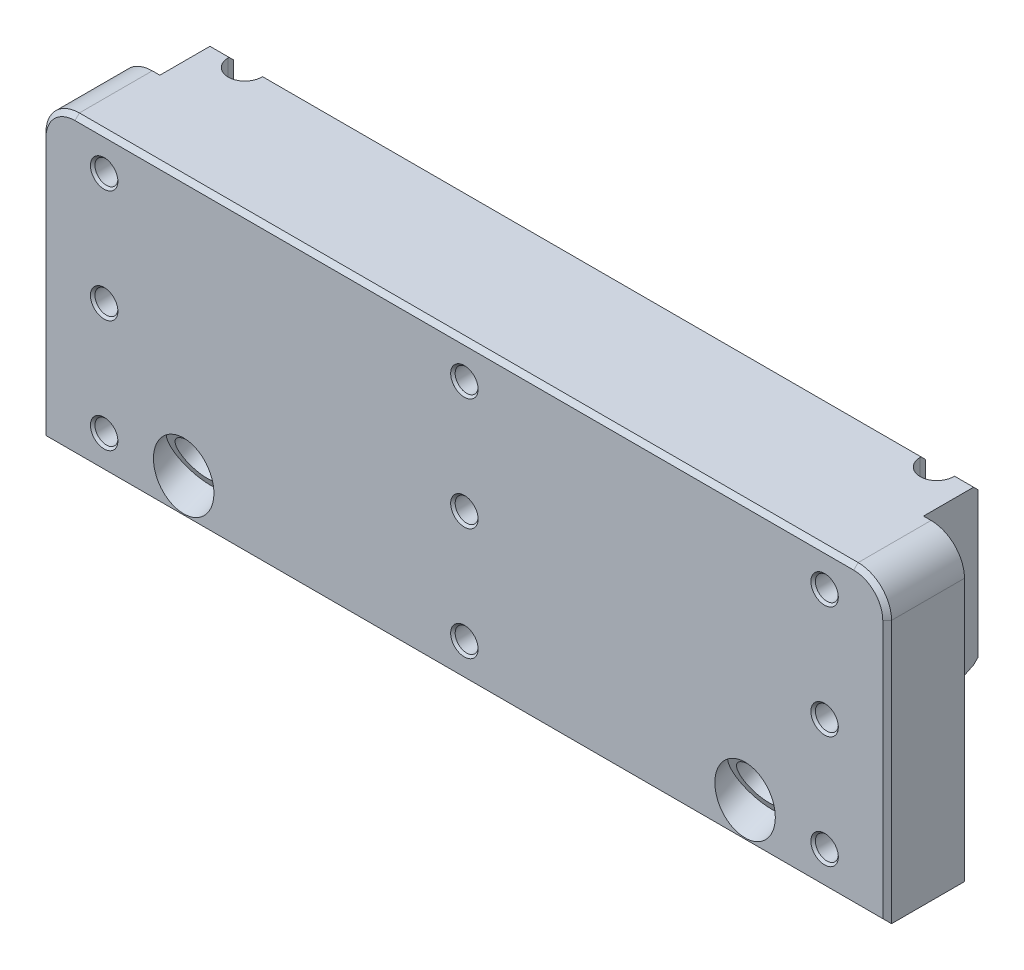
ISO-10303-21;
HEADER;
FILE_DESCRIPTION(('STEP AP214'),'2;1');
FILE_NAME('part.step','',(''),(''),'','','');
FILE_SCHEMA(('AUTOMOTIVE_DESIGN { 1 0 10303 214 1 1 1 1 }'));
ENDSEC;
DATA;
#1=APPLICATION_CONTEXT('core data for automotive mechanical design processes');
#2=APPLICATION_PROTOCOL_DEFINITION('international standard','automotive_design',2000,#1);
#3=PRODUCT_CONTEXT('',#1,'mechanical');
#4=PRODUCT('Part','Part','',(#3));
#5=PRODUCT_RELATED_PRODUCT_CATEGORY('part','',(#4));
#6=PRODUCT_DEFINITION_FORMATION('','',#4);
#7=PRODUCT_DEFINITION_CONTEXT('part definition',#1,'design');
#8=PRODUCT_DEFINITION('design','',#6,#7);
#9=PRODUCT_DEFINITION_SHAPE('','',#8);
#10=(LENGTH_UNIT() NAMED_UNIT(*) SI_UNIT(.MILLI.,.METRE.));
#11=(NAMED_UNIT(*) PLANE_ANGLE_UNIT() SI_UNIT($,.RADIAN.));
#12=(NAMED_UNIT(*) SI_UNIT($,.STERADIAN.) SOLID_ANGLE_UNIT());
#13=UNCERTAINTY_MEASURE_WITH_UNIT(LENGTH_MEASURE(1.E-05),#10,'distance_accuracy_value','');
#14=(GEOMETRIC_REPRESENTATION_CONTEXT(3) GLOBAL_UNCERTAINTY_ASSIGNED_CONTEXT((#13)) GLOBAL_UNIT_ASSIGNED_CONTEXT((#10,
#11,#12)) REPRESENTATION_CONTEXT('',''));
#15=CARTESIAN_POINT('',(0.,0.,0.));
#16=DIRECTION('',(0.,0.,1.));
#17=DIRECTION('',(1.,0.,0.));
#18=AXIS2_PLACEMENT_3D('',#15,#16,#17);
#19=CARTESIAN_POINT('',(0.,85.598,22.352));
#20=DIRECTION('',(0.,0.,-1.));
#21=DIRECTION('',(-1.,0.,0.));
#22=AXIS2_PLACEMENT_3D('',#19,#20,#21);
#23=PLANE('',#22);
#24=DIRECTION('',(0.999999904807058,-0.000436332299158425,0.));
#25=VECTOR('',#24,1.);
#26=CARTESIAN_POINT('',(108.108749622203,10.2852683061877,22.352));
#27=LINE('',#26,#25);
#28=CARTESIAN_POINT('',(108.109003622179,10.2852681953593,22.352));
#29=VERTEX_POINT('',#28);
#30=CARTESIAN_POINT('',(108.108749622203,10.2852683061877,22.352));
#31=VERTEX_POINT('',#30);
#32=EDGE_CURVE('E643',#29,#31,#27,.F.);
#33=ORIENTED_EDGE('',*,*,#32,.F.);
#34=CARTESIAN_POINT('',(104.14,10.287,22.352));
#35=DIRECTION('',(0.,0.,1.));
#36=DIRECTION('',(1.,0.,0.));
#37=AXIS2_PLACEMENT_3D('',#34,#35,#36);
#38=CIRCLE('',#37,3.969004);
#39=CARTESIAN_POINT('',(108.109004,10.287,22.352));
#40=VERTEX_POINT('',#39);
#41=EDGE_CURVE('E594',#40,#29,#38,.T.);
#42=ORIENTED_EDGE('',*,*,#41,.F.);
#43=DIRECTION('',(1.,0.,0.));
#44=VECTOR('',#43,1.);
#45=CARTESIAN_POINT('',(108.10875,10.287,22.352));
#46=LINE('',#45,#44);
#47=CARTESIAN_POINT('',(108.10875,10.287,22.352));
#48=VERTEX_POINT('',#47);
#49=EDGE_CURVE('E40',#40,#48,#46,.F.);
#50=ORIENTED_EDGE('',*,*,#49,.T.);
#51=CARTESIAN_POINT('',(104.14,10.287,22.352));
#52=DIRECTION('',(0.,0.,-1.));
#53=DIRECTION('',(-1.,0.,0.));
#54=AXIS2_PLACEMENT_3D('',#51,#52,#53);
#55=CIRCLE('',#54,3.96875);
#56=EDGE_CURVE('E995',#48,#31,#55,.T.);
#57=ORIENTED_EDGE('',*,*,#56,.T.);
#58=EDGE_LOOP('',(#33,#42,#50,#57));
#59=FACE_BOUND('',#58,.T.);
#60=DIRECTION('',(0.999999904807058,-0.000436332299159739,0.));
#61=VECTOR('',#60,1.);
#62=CARTESIAN_POINT('',(3.96874962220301,75.3092683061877,22.352));
#63=LINE('',#62,#61);
#64=CARTESIAN_POINT('',(3.96900362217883,75.3092681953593,22.352));
#65=VERTEX_POINT('',#64);
#66=CARTESIAN_POINT('',(3.96874962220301,75.3092683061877,22.352));
#67=VERTEX_POINT('',#66);
#68=EDGE_CURVE('E2836',#65,#67,#63,.F.);
#69=ORIENTED_EDGE('',*,*,#68,.F.);
#70=CARTESIAN_POINT('',(0.,75.311,22.352));
#71=DIRECTION('',(0.,0.,1.));
#72=DIRECTION('',(1.,0.,0.));
#73=AXIS2_PLACEMENT_3D('',#70,#71,#72);
#74=CIRCLE('',#73,3.969004);
#75=CARTESIAN_POINT('',(3.969004,75.311,22.352));
#76=VERTEX_POINT('',#75);
#77=EDGE_CURVE('E2779',#76,#65,#74,.T.);
#78=ORIENTED_EDGE('',*,*,#77,.F.);
#79=DIRECTION('',(1.,0.,0.));
#80=VECTOR('',#79,1.);
#81=CARTESIAN_POINT('',(3.96875,75.311,22.352));
#82=LINE('',#81,#80);
#83=CARTESIAN_POINT('',(3.96875,75.311,22.352));
#84=VERTEX_POINT('',#83);
#85=EDGE_CURVE('E2730',#76,#84,#82,.F.);
#86=ORIENTED_EDGE('',*,*,#85,.T.);
#87=CARTESIAN_POINT('',(0.,75.311,22.352));
#88=DIRECTION('',(0.,0.,-1.));
#89=DIRECTION('',(-1.,0.,0.));
#90=AXIS2_PLACEMENT_3D('',#87,#88,#89);
#91=CIRCLE('',#90,3.96875);
#92=EDGE_CURVE('E2868',#84,#67,#91,.T.);
#93=ORIENTED_EDGE('',*,*,#92,.T.);
#94=EDGE_LOOP('',(#69,#78,#86,#93));
#95=FACE_BOUND('',#94,.T.);
#96=DIRECTION('',(0.999999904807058,-0.00043633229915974,0.));
#97=VECTOR('',#96,1.);
#98=CARTESIAN_POINT('',(-100.171250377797,75.3092683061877,22.352));
#99=LINE('',#98,#97);
#100=CARTESIAN_POINT('',(-100.170996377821,75.3092681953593,22.352));
#101=VERTEX_POINT('',#100);
#102=CARTESIAN_POINT('',(-100.171250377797,75.3092683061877,22.352));
#103=VERTEX_POINT('',#102);
#104=EDGE_CURVE('E2927',#101,#103,#99,.F.);
#105=ORIENTED_EDGE('',*,*,#104,.F.);
#106=CARTESIAN_POINT('',(-104.14,75.311,22.352));
#107=DIRECTION('',(0.,0.,1.));
#108=DIRECTION('',(1.,0.,0.));
#109=AXIS2_PLACEMENT_3D('',#106,#107,#108);
#110=CIRCLE('',#109,3.969004);
#111=CARTESIAN_POINT('',(-100.170996,75.311,22.352));
#112=VERTEX_POINT('',#111);
#113=EDGE_CURVE('E2957',#112,#101,#110,.T.);
#114=ORIENTED_EDGE('',*,*,#113,.F.);
#115=DIRECTION('',(1.,0.,0.));
#116=VECTOR('',#115,1.);
#117=CARTESIAN_POINT('',(-100.17125,75.311,22.352));
#118=LINE('',#117,#116);
#119=CARTESIAN_POINT('',(-100.17125,75.311,22.352));
#120=VERTEX_POINT('',#119);
#121=EDGE_CURVE('E2973',#112,#120,#118,.F.);
#122=ORIENTED_EDGE('',*,*,#121,.T.);
#123=CARTESIAN_POINT('',(-104.14,75.311,22.352));
#124=DIRECTION('',(0.,0.,-1.));
#125=DIRECTION('',(-1.,0.,0.));
#126=AXIS2_PLACEMENT_3D('',#123,#124,#125);
#127=CIRCLE('',#126,3.96875);
#128=EDGE_CURVE('E2871',#120,#103,#127,.T.);
#129=ORIENTED_EDGE('',*,*,#128,.T.);
#130=EDGE_LOOP('',(#105,#114,#122,#129));
#131=FACE_BOUND('',#130,.T.);
#132=DIRECTION('',(0.999999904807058,-0.000436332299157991,0.));
#133=VECTOR('',#132,1.);
#134=CARTESIAN_POINT('',(-100.171250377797,42.7972683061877,22.352));
#135=LINE('',#134,#133);
#136=CARTESIAN_POINT('',(-100.170996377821,42.7972681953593,22.352));
#137=VERTEX_POINT('',#136);
#138=CARTESIAN_POINT('',(-100.171250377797,42.7972683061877,22.352));
#139=VERTEX_POINT('',#138);
#140=EDGE_CURVE('E2933',#137,#139,#135,.F.);
#141=ORIENTED_EDGE('',*,*,#140,.F.);
#142=CARTESIAN_POINT('',(-104.14,42.799,22.352));
#143=DIRECTION('',(0.,0.,1.));
#144=DIRECTION('',(1.,0.,0.));
#145=AXIS2_PLACEMENT_3D('',#142,#143,#144);
#146=CIRCLE('',#145,3.969004);
#147=CARTESIAN_POINT('',(-100.170996,42.799,22.352));
#148=VERTEX_POINT('',#147);
#149=EDGE_CURVE('E3212',#148,#137,#146,.T.);
#150=ORIENTED_EDGE('',*,*,#149,.F.);
#151=DIRECTION('',(1.,0.,0.));
#152=VECTOR('',#151,1.);
#153=CARTESIAN_POINT('',(-100.17125,42.799,22.352));
#154=LINE('',#153,#152);
#155=CARTESIAN_POINT('',(-100.17125,42.799,22.352));
#156=VERTEX_POINT('',#155);
#157=EDGE_CURVE('E3110',#148,#156,#154,.F.);
#158=ORIENTED_EDGE('',*,*,#157,.T.);
#159=CARTESIAN_POINT('',(-104.14,42.799,22.352));
#160=DIRECTION('',(0.,0.,-1.));
#161=DIRECTION('',(-1.,0.,0.));
#162=AXIS2_PLACEMENT_3D('',#159,#160,#161);
#163=CIRCLE('',#162,3.96875);
#164=EDGE_CURVE('E650',#156,#139,#163,.T.);
#165=ORIENTED_EDGE('',*,*,#164,.T.);
#166=EDGE_LOOP('',(#141,#150,#158,#165));
#167=FACE_BOUND('',#166,.T.);
#168=CARTESIAN_POINT('',(-81.153,11.0730822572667,22.352));
#169=DIRECTION('',(0.,0.,-1.));
#170=DIRECTION('',(0.,1.,0.));
#171=AXIS2_PLACEMENT_3D('',#168,#169,#170);
#172=ELLIPSE('',#171,9.49218243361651,8.7376);
#173=CARTESIAN_POINT('',(-81.153,20.5652646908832,22.352));
#174=VERTEX_POINT('',#173);
#175=EDGE_CURVE('E840',#174,#174,#172,.F.);
#176=ORIENTED_EDGE('',*,*,#175,.F.);
#177=EDGE_LOOP('',(#176));
#178=FACE_BOUND('',#177,.T.);
#179=CARTESIAN_POINT('',(81.153,11.0730822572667,22.352));
#180=DIRECTION('',(0.,0.,-1.));
#181=DIRECTION('',(0.,1.,0.));
#182=AXIS2_PLACEMENT_3D('',#179,#180,#181);
#183=ELLIPSE('',#182,9.49218243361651,8.7376);
#184=CARTESIAN_POINT('',(81.153,20.5652646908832,22.352));
#185=VERTEX_POINT('',#184);
#186=EDGE_CURVE('E1077',#185,#185,#183,.F.);
#187=ORIENTED_EDGE('',*,*,#186,.F.);
#188=EDGE_LOOP('',(#187));
#189=FACE_BOUND('',#188,.T.);
#190=DIRECTION('',(0.,1.,0.));
#191=VECTOR('',#190,1.);
#192=CARTESIAN_POINT('',(120.9548,85.598,22.352));
#193=LINE('',#192,#191);
#194=CARTESIAN_POINT('',(120.9548,1.27,22.352));
#195=VERTEX_POINT('',#194);
#196=CARTESIAN_POINT('',(120.9548,75.946,22.352));
#197=VERTEX_POINT('',#196);
#198=EDGE_CURVE('E925',#195,#197,#193,.T.);
#199=ORIENTED_EDGE('',*,*,#198,.T.);
#200=CARTESIAN_POINT('',(112.5728,75.946,22.352));
#201=DIRECTION('',(0.,0.,-1.));
#202=DIRECTION('',(-1.,0.,0.));
#203=AXIS2_PLACEMENT_3D('',#200,#201,#202);
#204=CIRCLE('',#203,8.382);
#205=CARTESIAN_POINT('',(112.5728,84.328,22.352));
#206=VERTEX_POINT('',#205);
#207=EDGE_CURVE('E927',#197,#206,#204,.F.);
#208=ORIENTED_EDGE('',*,*,#207,.T.);
#209=DIRECTION('',(-1.,0.,0.));
#210=VECTOR('',#209,1.);
#211=CARTESIAN_POINT('',(0.,84.328,22.352));
#212=LINE('',#211,#210);
#213=CARTESIAN_POINT('',(-112.5728,84.328,22.352));
#214=VERTEX_POINT('',#213);
#215=EDGE_CURVE('E921',#206,#214,#212,.T.);
#216=ORIENTED_EDGE('',*,*,#215,.T.);
#217=CARTESIAN_POINT('',(-112.5728,75.946,22.352));
#218=DIRECTION('',(0.,0.,-1.));
#219=DIRECTION('',(-1.,0.,0.));
#220=AXIS2_PLACEMENT_3D('',#217,#218,#219);
#221=CIRCLE('',#220,8.382);
#222=CARTESIAN_POINT('',(-120.9548,75.946,22.352));
#223=VERTEX_POINT('',#222);
#224=EDGE_CURVE('E919',#214,#223,#221,.F.);
#225=ORIENTED_EDGE('',*,*,#224,.T.);
#226=DIRECTION('',(0.,-1.,0.));
#227=VECTOR('',#226,1.);
#228=CARTESIAN_POINT('',(-120.9548,0.,22.352));
#229=LINE('',#228,#227);
#230=CARTESIAN_POINT('',(-120.9548,1.27,22.352));
#231=VERTEX_POINT('',#230);
#232=EDGE_CURVE('E917',#223,#231,#229,.T.);
#233=ORIENTED_EDGE('',*,*,#232,.T.);
#234=DIRECTION('',(1.,0.,0.));
#235=VECTOR('',#234,1.);
#236=CARTESIAN_POINT('',(122.2248,1.27,22.352));
#237=LINE('',#236,#235);
#238=EDGE_CURVE('E923',#231,#195,#237,.T.);
#239=ORIENTED_EDGE('',*,*,#238,.T.);
#240=EDGE_LOOP('',(#199,#208,#216,#225,#233,#239));
#241=FACE_BOUND('',#240,.T.);
#242=DIRECTION('',(0.999999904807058,-0.000436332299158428,0.));
#243=VECTOR('',#242,1.);
#244=CARTESIAN_POINT('',(3.96874962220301,10.2852683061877,22.352));
#245=LINE('',#244,#243);
#246=CARTESIAN_POINT('',(3.96900362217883,10.2852681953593,22.352));
#247=VERTEX_POINT('',#246);
#248=CARTESIAN_POINT('',(3.96874962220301,10.2852683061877,22.352));
#249=VERTEX_POINT('',#248);
#250=EDGE_CURVE('E1010',#247,#249,#245,.F.);
#251=ORIENTED_EDGE('',*,*,#250,.F.);
#252=CARTESIAN_POINT('',(0.,10.287,22.352));
#253=DIRECTION('',(0.,0.,1.));
#254=DIRECTION('',(1.,0.,0.));
#255=AXIS2_PLACEMENT_3D('',#252,#253,#254);
#256=CIRCLE('',#255,3.969004);
#257=CARTESIAN_POINT('',(3.969004,10.287,22.352));
#258=VERTEX_POINT('',#257);
#259=EDGE_CURVE('E3145',#258,#247,#256,.T.);
#260=ORIENTED_EDGE('',*,*,#259,.F.);
#261=DIRECTION('',(1.,0.,0.));
#262=VECTOR('',#261,1.);
#263=CARTESIAN_POINT('',(3.96875,10.287,22.352));
#264=LINE('',#263,#262);
#265=CARTESIAN_POINT('',(3.96875,10.287,22.352));
#266=VERTEX_POINT('',#265);
#267=EDGE_CURVE('E1014',#258,#266,#264,.F.);
#268=ORIENTED_EDGE('',*,*,#267,.T.);
#269=CARTESIAN_POINT('',(0.,10.287,22.352));
#270=DIRECTION('',(0.,0.,-1.));
#271=DIRECTION('',(-1.,0.,0.));
#272=AXIS2_PLACEMENT_3D('',#269,#270,#271);
#273=CIRCLE('',#272,3.96875);
#274=EDGE_CURVE('E991',#266,#249,#273,.T.);
#275=ORIENTED_EDGE('',*,*,#274,.T.);
#276=EDGE_LOOP('',(#251,#260,#268,#275));
#277=FACE_BOUND('',#276,.T.);
#278=DIRECTION('',(0.999999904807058,-0.00043633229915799,0.));
#279=VECTOR('',#278,1.);
#280=CARTESIAN_POINT('',(3.96874962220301,42.7972683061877,22.352));
#281=LINE('',#280,#279);
#282=CARTESIAN_POINT('',(3.96900362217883,42.7972681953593,22.352));
#283=VERTEX_POINT('',#282);
#284=CARTESIAN_POINT('',(3.96874962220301,42.7972683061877,22.352));
#285=VERTEX_POINT('',#284);
#286=EDGE_CURVE('E2947',#283,#285,#281,.F.);
#287=ORIENTED_EDGE('',*,*,#286,.F.);
#288=CARTESIAN_POINT('',(0.,42.799,22.352));
#289=DIRECTION('',(0.,0.,1.));
#290=DIRECTION('',(1.,0.,0.));
#291=AXIS2_PLACEMENT_3D('',#288,#289,#290);
#292=CIRCLE('',#291,3.969004);
#293=CARTESIAN_POINT('',(3.969004,42.799,22.352));
#294=VERTEX_POINT('',#293);
#295=EDGE_CURVE('E2989',#294,#283,#292,.T.);
#296=ORIENTED_EDGE('',*,*,#295,.F.);
#297=DIRECTION('',(1.,0.,0.));
#298=VECTOR('',#297,1.);
#299=CARTESIAN_POINT('',(3.96875,42.799,22.352));
#300=LINE('',#299,#298);
#301=CARTESIAN_POINT('',(3.96875,42.799,22.352));
#302=VERTEX_POINT('',#301);
#303=EDGE_CURVE('E3031',#294,#302,#300,.F.);
#304=ORIENTED_EDGE('',*,*,#303,.T.);
#305=CARTESIAN_POINT('',(0.,42.799,22.352));
#306=DIRECTION('',(0.,0.,-1.));
#307=DIRECTION('',(-1.,0.,0.));
#308=AXIS2_PLACEMENT_3D('',#305,#306,#307);
#309=CIRCLE('',#308,3.96875);
#310=EDGE_CURVE('E994',#302,#285,#309,.T.);
#311=ORIENTED_EDGE('',*,*,#310,.T.);
#312=EDGE_LOOP('',(#287,#296,#304,#311));
#313=FACE_BOUND('',#312,.T.);
#314=DIRECTION('',(0.999999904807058,-0.000436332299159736,0.));
#315=VECTOR('',#314,1.);
#316=CARTESIAN_POINT('',(108.108749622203,75.3092683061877,22.352));
#317=LINE('',#316,#315);
#318=CARTESIAN_POINT('',(108.109003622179,75.3092681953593,22.352));
#319=VERTEX_POINT('',#318);
#320=CARTESIAN_POINT('',(108.108749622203,75.3092683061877,22.352));
#321=VERTEX_POINT('',#320);
#322=EDGE_CURVE('E2865',#319,#321,#317,.F.);
#323=ORIENTED_EDGE('',*,*,#322,.F.);
#324=CARTESIAN_POINT('',(104.14,75.311,22.352));
#325=DIRECTION('',(0.,0.,1.));
#326=DIRECTION('',(1.,0.,0.));
#327=AXIS2_PLACEMENT_3D('',#324,#325,#326);
#328=CIRCLE('',#327,3.969004);
#329=CARTESIAN_POINT('',(108.109004,75.311,22.352));
#330=VERTEX_POINT('',#329);
#331=EDGE_CURVE('E2813',#330,#319,#328,.T.);
#332=ORIENTED_EDGE('',*,*,#331,.F.);
#333=DIRECTION('',(1.,0.,0.));
#334=VECTOR('',#333,1.);
#335=CARTESIAN_POINT('',(108.10875,75.311,22.352));
#336=LINE('',#335,#334);
#337=CARTESIAN_POINT('',(108.10875,75.311,22.352));
#338=VERTEX_POINT('',#337);
#339=EDGE_CURVE('E2856',#330,#338,#336,.F.);
#340=ORIENTED_EDGE('',*,*,#339,.T.);
#341=CARTESIAN_POINT('',(104.14,75.311,22.352));
#342=DIRECTION('',(0.,0.,-1.));
#343=DIRECTION('',(-1.,0.,0.));
#344=AXIS2_PLACEMENT_3D('',#341,#342,#343);
#345=CIRCLE('',#344,3.96875);
#346=EDGE_CURVE('E971',#338,#321,#345,.T.);
#347=ORIENTED_EDGE('',*,*,#346,.T.);
#348=EDGE_LOOP('',(#323,#332,#340,#347));
#349=FACE_BOUND('',#348,.T.);
#350=DIRECTION('',(0.999999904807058,-0.000436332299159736,0.));
#351=VECTOR('',#350,1.);
#352=CARTESIAN_POINT('',(108.108749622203,42.7972683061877,22.352));
#353=LINE('',#352,#351);
#354=CARTESIAN_POINT('',(108.109003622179,42.7972681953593,22.352));
#355=VERTEX_POINT('',#354);
#356=CARTESIAN_POINT('',(108.108749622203,42.7972683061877,22.352));
#357=VERTEX_POINT('',#356);
#358=EDGE_CURVE('E2715',#355,#357,#353,.F.);
#359=ORIENTED_EDGE('',*,*,#358,.F.);
#360=CARTESIAN_POINT('',(104.14,42.799,22.352));
#361=DIRECTION('',(0.,0.,1.));
#362=DIRECTION('',(1.,0.,0.));
#363=AXIS2_PLACEMENT_3D('',#360,#361,#362);
#364=CIRCLE('',#363,3.969004);
#365=CARTESIAN_POINT('',(108.109004,42.799,22.352));
#366=VERTEX_POINT('',#365);
#367=EDGE_CURVE('E2679',#366,#355,#364,.T.);
#368=ORIENTED_EDGE('',*,*,#367,.F.);
#369=DIRECTION('',(1.,0.,0.));
#370=VECTOR('',#369,1.);
#371=CARTESIAN_POINT('',(108.10875,42.799,22.352));
#372=LINE('',#371,#370);
#373=CARTESIAN_POINT('',(108.10875,42.799,22.352));
#374=VERTEX_POINT('',#373);
#375=EDGE_CURVE('E2707',#366,#374,#372,.F.);
#376=ORIENTED_EDGE('',*,*,#375,.T.);
#377=CARTESIAN_POINT('',(104.14,42.799,22.352));
#378=DIRECTION('',(0.,0.,-1.));
#379=DIRECTION('',(-1.,0.,0.));
#380=AXIS2_PLACEMENT_3D('',#377,#378,#379);
#381=CIRCLE('',#380,3.96875);
#382=EDGE_CURVE('E2719',#374,#357,#381,.T.);
#383=ORIENTED_EDGE('',*,*,#382,.T.);
#384=EDGE_LOOP('',(#359,#368,#376,#383));
#385=FACE_BOUND('',#384,.T.);
#386=DIRECTION('',(0.999999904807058,-0.000436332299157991,0.));
#387=VECTOR('',#386,1.);
#388=CARTESIAN_POINT('',(-100.171250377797,10.2852683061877,22.352));
#389=LINE('',#388,#387);
#390=CARTESIAN_POINT('',(-100.170996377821,10.2852681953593,22.352));
#391=VERTEX_POINT('',#390);
#392=CARTESIAN_POINT('',(-100.171250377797,10.2852683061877,22.352));
#393=VERTEX_POINT('',#392);
#394=EDGE_CURVE('E616',#391,#393,#389,.F.);
#395=ORIENTED_EDGE('',*,*,#394,.F.);
#396=CARTESIAN_POINT('',(-104.14,10.287,22.352));
#397=DIRECTION('',(0.,0.,1.));
#398=DIRECTION('',(1.,0.,0.));
#399=AXIS2_PLACEMENT_3D('',#396,#397,#398);
#400=CIRCLE('',#399,3.969004);
#401=CARTESIAN_POINT('',(-100.170996,10.287,22.352));
#402=VERTEX_POINT('',#401);
#403=EDGE_CURVE('E678',#402,#391,#400,.T.);
#404=ORIENTED_EDGE('',*,*,#403,.F.);
#405=DIRECTION('',(1.,0.,0.));
#406=VECTOR('',#405,1.);
#407=CARTESIAN_POINT('',(-100.17125,10.287,22.352));
#408=LINE('',#407,#406);
#409=CARTESIAN_POINT('',(-100.17125,10.287,22.352));
#410=VERTEX_POINT('',#409);
#411=EDGE_CURVE('E19',#402,#410,#408,.F.);
#412=ORIENTED_EDGE('',*,*,#411,.T.);
#413=CARTESIAN_POINT('',(-104.14,10.287,22.352));
#414=DIRECTION('',(0.,0.,-1.));
#415=DIRECTION('',(-1.,0.,0.));
#416=AXIS2_PLACEMENT_3D('',#413,#414,#415);
#417=CIRCLE('',#416,3.96875);
#418=EDGE_CURVE('E646',#410,#393,#417,.T.);
#419=ORIENTED_EDGE('',*,*,#418,.T.);
#420=EDGE_LOOP('',(#395,#404,#412,#419));
#421=FACE_BOUND('',#420,.T.);
#422=ADVANCED_FACE('F15',(#59,#95,#131,#167,#178,#189,#241,#277,#313,#349,#385,#421),#23,.F.);
#423=CARTESIAN_POINT('',(110.3884,85.598,-15.748));
#424=DIRECTION('',(0.,0.,1.));
#425=DIRECTION('',(1.,0.,0.));
#426=AXIS2_PLACEMENT_3D('',#423,#424,#425);
#427=PLANE('',#426);
#428=DIRECTION('',(0.,-1.,0.));
#429=VECTOR('',#428,1.);
#430=CARTESIAN_POINT('',(-104.8512,85.598,-15.748));
#431=LINE('',#430,#429);
#432=CARTESIAN_POINT('',(-104.8512,84.328,-15.748));
#433=VERTEX_POINT('',#432);
#434=CARTESIAN_POINT('',(-104.8512,42.3652821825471,-15.748));
#435=VERTEX_POINT('',#434);
#436=EDGE_CURVE('E1147',#433,#435,#431,.T.);
#437=ORIENTED_EDGE('',*,*,#436,.T.);
#438=DIRECTION('',(-1.,0.,0.));
#439=VECTOR('',#438,1.);
#440=CARTESIAN_POINT('',(110.3884,42.3652821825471,-15.748));
#441=LINE('',#440,#439);
#442=CARTESIAN_POINT('',(-110.3884,42.3652821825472,-15.748));
#443=VERTEX_POINT('',#442);
#444=EDGE_CURVE('E961',#435,#443,#441,.T.);
#445=ORIENTED_EDGE('',*,*,#444,.T.);
#446=DIRECTION('',(0.,-1.,0.));
#447=VECTOR('',#446,1.);
#448=CARTESIAN_POINT('',(-110.3884,85.598,-15.748));
#449=LINE('',#448,#447);
#450=CARTESIAN_POINT('',(-110.3884,84.328,-15.748));
#451=VERTEX_POINT('',#450);
#452=EDGE_CURVE('E1094',#451,#443,#449,.T.);
#453=ORIENTED_EDGE('',*,*,#452,.F.);
#454=DIRECTION('',(1.,0.,0.));
#455=VECTOR('',#454,1.);
#456=CARTESIAN_POINT('',(110.3884,84.328,-15.748));
#457=LINE('',#456,#455);
#458=EDGE_CURVE('E899',#451,#433,#457,.T.);
#459=ORIENTED_EDGE('',*,*,#458,.T.);
#460=EDGE_LOOP('',(#437,#445,#453,#459));
#461=FACE_BOUND('',#460,.T.);
#462=ADVANCED_FACE('F715',(#461),#427,.F.);
#463=CARTESIAN_POINT('',(-110.3884,85.598,0.));
#464=DIRECTION('',(-1.,0.,0.));
#465=DIRECTION('',(0.,0.,1.));
#466=AXIS2_PLACEMENT_3D('',#463,#464,#465);
#467=PLANE('',#466);
#468=ORIENTED_EDGE('',*,*,#452,.T.);
#469=DIRECTION('',(0.,0.707106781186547,-0.707106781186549));
#470=VECTOR('',#469,1.);
#471=CARTESIAN_POINT('',(-110.3884,56.1076410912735,-29.4903589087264));
#472=LINE('',#471,#470);
#473=CARTESIAN_POINT('',(-110.3884,41.1009034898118,-14.4836213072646));
#474=VERTEX_POINT('',#473);
#475=EDGE_CURVE('E964',#443,#474,#472,.F.);
#476=ORIENTED_EDGE('',*,*,#475,.T.);
#477=DIRECTION('',(0.,0.438371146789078,-0.898794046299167));
#478=VECTOR('',#477,1.);
#479=CARTESIAN_POINT('',(-110.3884,43.9452530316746,-20.3154020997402));
#480=LINE('',#479,#478);
#481=CARTESIAN_POINT('',(-110.3884,34.7325381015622,-1.42653728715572));
#482=VERTEX_POINT('',#481);
#483=EDGE_CURVE('E864',#482,#474,#480,.T.);
#484=ORIENTED_EDGE('',*,*,#483,.F.);
#485=CARTESIAN_POINT('',(-110.3884,32.4496012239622,-2.54));
#486=DIRECTION('',(-1.,0.,0.));
#487=DIRECTION('',(0.,0.,1.));
#488=AXIS2_PLACEMENT_3D('',#485,#486,#487);
#489=CIRCLE('',#488,2.54);
#490=CARTESIAN_POINT('',(-110.3884,32.4496012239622,0.));
#491=VERTEX_POINT('',#490);
#492=EDGE_CURVE('E881',#482,#491,#489,.F.);
#493=ORIENTED_EDGE('',*,*,#492,.T.);
#494=DIRECTION('',(0.,-1.,0.));
#495=VECTOR('',#494,1.);
#496=CARTESIAN_POINT('',(-110.3884,85.598,0.));
#497=LINE('',#496,#495);
#498=CARTESIAN_POINT('',(-110.3884,85.598,0.));
#499=VERTEX_POINT('',#498);
#500=EDGE_CURVE('E1092',#499,#491,#497,.T.);
#501=ORIENTED_EDGE('',*,*,#500,.F.);
#502=DIRECTION('',(0.,0.,1.));
#503=VECTOR('',#502,1.);
#504=CARTESIAN_POINT('',(-110.3884,85.598,0.));
#505=LINE('',#504,#503);
#506=CARTESIAN_POINT('',(-110.3884,85.598,-14.478));
#507=VERTEX_POINT('',#506);
#508=EDGE_CURVE('E1110',#507,#499,#505,.T.);
#509=ORIENTED_EDGE('',*,*,#508,.F.);
#510=DIRECTION('',(0.,0.707106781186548,0.707106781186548));
#511=VECTOR('',#510,1.);
#512=CARTESIAN_POINT('',(-110.3884,92.837,-7.239));
#513=LINE('',#512,#511);
#514=EDGE_CURVE('E897',#507,#451,#513,.F.);
#515=ORIENTED_EDGE('',*,*,#514,.T.);
#516=EDGE_LOOP('',(#468,#476,#484,#493,#501,#509,#515));
#517=FACE_BOUND('',#516,.T.);
#518=ADVANCED_FACE('F721',(#517),#467,.T.);
#519=CARTESIAN_POINT('',(-122.2248,85.598,22.352));
#520=DIRECTION('',(0.,-1.,0.));
#521=DIRECTION('',(0.,0.,-1.));
#522=AXIS2_PLACEMENT_3D('',#519,#520,#521);
#523=PLANE('',#522);
#524=DIRECTION('',(0.,0.,-1.));
#525=VECTOR('',#524,1.);
#526=CARTESIAN_POINT('',(-104.8512,85.598,17.526));
#527=LINE('',#526,#525);
#528=CARTESIAN_POINT('',(-104.8512,85.598,-14.478));
#529=VERTEX_POINT('',#528);
#530=CARTESIAN_POINT('',(-104.8512,85.598,-14.224));
#531=VERTEX_POINT('',#530);
#532=EDGE_CURVE('E1073',#529,#531,#527,.F.);
#533=ORIENTED_EDGE('',*,*,#532,.F.);
#534=DIRECTION('',(-1.,0.,0.));
#535=VECTOR('',#534,1.);
#536=CARTESIAN_POINT('',(-122.2248,85.598,-14.478));
#537=LINE('',#536,#535);
#538=EDGE_CURVE('E894',#529,#507,#537,.T.);
#539=ORIENTED_EDGE('',*,*,#538,.T.);
#540=ORIENTED_EDGE('',*,*,#508,.T.);
#541=DIRECTION('',(1.,0.,0.));
#542=VECTOR('',#541,1.);
#543=CARTESIAN_POINT('',(-122.2248,85.598,0.));
#544=LINE('',#543,#542);
#545=CARTESIAN_POINT('',(-112.5728,85.598,0.));
#546=VERTEX_POINT('',#545);
#547=EDGE_CURVE('E860',#546,#499,#544,.T.);
#548=ORIENTED_EDGE('',*,*,#547,.F.);
#549=DIRECTION('',(0.,0.,-1.));
#550=VECTOR('',#549,1.);
#551=CARTESIAN_POINT('',(-112.5728,85.598,22.352));
#552=LINE('',#551,#550);
#553=CARTESIAN_POINT('',(-112.5728,85.598,21.082));
#554=VERTEX_POINT('',#553);
#555=EDGE_CURVE('E867',#546,#554,#552,.F.);
#556=ORIENTED_EDGE('',*,*,#555,.T.);
#557=DIRECTION('',(1.,0.,0.));
#558=VECTOR('',#557,1.);
#559=CARTESIAN_POINT('',(-122.2248,85.598,21.082));
#560=LINE('',#559,#558);
#561=CARTESIAN_POINT('',(112.5728,85.598,21.082));
#562=VERTEX_POINT('',#561);
#563=EDGE_CURVE('E886',#554,#562,#560,.T.);
#564=ORIENTED_EDGE('',*,*,#563,.T.);
#565=DIRECTION('',(0.,0.,-1.));
#566=VECTOR('',#565,1.);
#567=CARTESIAN_POINT('',(112.5728,85.598,22.352));
#568=LINE('',#567,#566);
#569=CARTESIAN_POINT('',(112.5728,85.598,0.));
#570=VERTEX_POINT('',#569);
#571=EDGE_CURVE('E870',#562,#570,#568,.T.);
#572=ORIENTED_EDGE('',*,*,#571,.T.);
#573=DIRECTION('',(-1.,0.,0.));
#574=VECTOR('',#573,1.);
#575=CARTESIAN_POINT('',(122.2248,85.598,0.));
#576=LINE('',#575,#574);
#577=CARTESIAN_POINT('',(110.3884,85.598,0.));
#578=VERTEX_POINT('',#577);
#579=EDGE_CURVE('E1082',#570,#578,#576,.T.);
#580=ORIENTED_EDGE('',*,*,#579,.T.);
#581=DIRECTION('',(0.,0.,-1.));
#582=VECTOR('',#581,1.);
#583=CARTESIAN_POINT('',(110.3884,85.598,0.));
#584=LINE('',#583,#582);
#585=CARTESIAN_POINT('',(110.3884,85.598,-14.478));
#586=VERTEX_POINT('',#585);
#587=EDGE_CURVE('E1085',#578,#586,#584,.T.);
#588=ORIENTED_EDGE('',*,*,#587,.T.);
#589=DIRECTION('',(-1.,0.,0.));
#590=VECTOR('',#589,1.);
#591=CARTESIAN_POINT('',(-122.2248,85.598,-14.478));
#592=LINE('',#591,#590);
#593=CARTESIAN_POINT('',(104.8512,85.598,-14.478));
#594=VERTEX_POINT('',#593);
#595=EDGE_CURVE('E888',#586,#594,#592,.T.);
#596=ORIENTED_EDGE('',*,*,#595,.T.);
#597=DIRECTION('',(0.,0.,1.));
#598=VECTOR('',#597,1.);
#599=CARTESIAN_POINT('',(104.8512,85.598,17.526));
#600=LINE('',#599,#598);
#601=CARTESIAN_POINT('',(104.8512,85.598,-14.224));
#602=VERTEX_POINT('',#601);
#603=EDGE_CURVE('E1132',#594,#602,#600,.T.);
#604=ORIENTED_EDGE('',*,*,#603,.T.);
#605=CARTESIAN_POINT('',(100.0252,85.598,-14.224));
#606=DIRECTION('',(0.,-1.,0.));
#607=DIRECTION('',(0.,0.,-1.));
#608=AXIS2_PLACEMENT_3D('',#605,#606,#607);
#609=CIRCLE('',#608,4.826);
#610=CARTESIAN_POINT('',(95.1992,85.598,-14.224));
#611=VERTEX_POINT('',#610);
#612=EDGE_CURVE('E1121',#602,#611,#609,.T.);
#613=ORIENTED_EDGE('',*,*,#612,.T.);
#614=DIRECTION('',(0.,0.,-1.));
#615=VECTOR('',#614,1.);
#616=CARTESIAN_POINT('',(95.1992,85.598,17.526));
#617=LINE('',#616,#615);
#618=CARTESIAN_POINT('',(95.1992,85.598,-14.478));
#619=VERTEX_POINT('',#618);
#620=EDGE_CURVE('E842',#611,#619,#617,.T.);
#621=ORIENTED_EDGE('',*,*,#620,.T.);
#622=DIRECTION('',(-1.,0.,0.));
#623=VECTOR('',#622,1.);
#624=CARTESIAN_POINT('',(-122.2248,85.598,-14.478));
#625=LINE('',#624,#623);
#626=CARTESIAN_POINT('',(-95.1992,85.598,-14.478));
#627=VERTEX_POINT('',#626);
#628=EDGE_CURVE('E891',#619,#627,#625,.T.);
#629=ORIENTED_EDGE('',*,*,#628,.T.);
#630=DIRECTION('',(0.,0.,1.));
#631=VECTOR('',#630,1.);
#632=CARTESIAN_POINT('',(-95.1992,85.598,17.526));
#633=LINE('',#632,#631);
#634=CARTESIAN_POINT('',(-95.1992,85.598,-14.224));
#635=VERTEX_POINT('',#634);
#636=EDGE_CURVE('E1119',#627,#635,#633,.T.);
#637=ORIENTED_EDGE('',*,*,#636,.T.);
#638=CARTESIAN_POINT('',(-100.0252,85.598,-14.224));
#639=DIRECTION('',(0.,-1.,0.));
#640=DIRECTION('',(0.,0.,-1.));
#641=AXIS2_PLACEMENT_3D('',#638,#639,#640);
#642=CIRCLE('',#641,4.826);
#643=EDGE_CURVE('E1144',#635,#531,#642,.T.);
#644=ORIENTED_EDGE('',*,*,#643,.T.);
#645=EDGE_LOOP('',(#533,#539,#540,#548,#556,#564,#572,#580,#588,#596,#604,#613,#621,#629,#637,#644));
#646=FACE_BOUND('',#645,.T.);
#647=ADVANCED_FACE('F730',(#646),#523,.F.);
#648=CARTESIAN_POINT('',(-104.8512,254.,-21.082));
#649=DIRECTION('',(-1.,0.,0.));
#650=DIRECTION('',(0.,0.,-1.));
#651=AXIS2_PLACEMENT_3D('',#648,#649,#650);
#652=PLANE('',#651);
#653=DIRECTION('',(0.,-0.438371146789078,0.898794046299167));
#654=VECTOR('',#653,1.);
#655=CARTESIAN_POINT('',(-104.8512,34.036769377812,0.));
#656=LINE('',#655,#654);
#657=CARTESIAN_POINT('',(-104.8512,41.1009034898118,-14.4836213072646));
#658=VERTEX_POINT('',#657);
#659=CARTESIAN_POINT('',(-104.8512,40.9742759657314,-14.2239964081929));
#660=VERTEX_POINT('',#659);
#661=EDGE_CURVE('E1151',#658,#660,#656,.T.);
#662=ORIENTED_EDGE('',*,*,#661,.F.);
#663=DIRECTION('',(0.,-0.707106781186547,0.707106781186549));
#664=VECTOR('',#663,1.);
#665=CARTESIAN_POINT('',(-104.8512,42.3652821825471,-15.748));
#666=LINE('',#665,#664);
#667=EDGE_CURVE('E966',#658,#435,#666,.F.);
#668=ORIENTED_EDGE('',*,*,#667,.T.);
#669=ORIENTED_EDGE('',*,*,#436,.F.);
#670=DIRECTION('',(0.,-0.707106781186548,-0.707106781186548));
#671=VECTOR('',#670,1.);
#672=CARTESIAN_POINT('',(-104.8512,85.598,-14.478));
#673=LINE('',#672,#671);
#674=EDGE_CURVE('E901',#433,#529,#673,.F.);
#675=ORIENTED_EDGE('',*,*,#674,.T.);
#676=ORIENTED_EDGE('',*,*,#532,.T.);
#677=DIRECTION('',(0.,-1.,0.));
#678=VECTOR('',#677,1.);
#679=CARTESIAN_POINT('',(-104.8512,254.,-14.224));
#680=LINE('',#679,#678);
#681=EDGE_CURVE('E1141',#531,#660,#680,.T.);
#682=ORIENTED_EDGE('',*,*,#681,.T.);
#683=EDGE_LOOP('',(#662,#668,#669,#675,#676,#682));
#684=FACE_BOUND('',#683,.T.);
#685=ADVANCED_FACE('F817',(#684),#652,.F.);
#686=DIRECTION('',(0.,-1.,0.));
#687=VECTOR('',#686,1.);
#688=CARTESIAN_POINT('',(95.1992,85.598,-15.748));
#689=LINE('',#688,#687);
#690=CARTESIAN_POINT('',(95.1992,84.328,-15.748));
#691=VERTEX_POINT('',#690);
#692=CARTESIAN_POINT('',(95.1992,42.3652821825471,-15.748));
#693=VERTEX_POINT('',#692);
#694=EDGE_CURVE('E1134',#691,#693,#689,.T.);
#695=ORIENTED_EDGE('',*,*,#694,.T.);
#696=DIRECTION('',(-1.,0.,0.));
#697=VECTOR('',#696,1.);
#698=CARTESIAN_POINT('',(110.3884,42.3652821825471,-15.748));
#699=LINE('',#698,#697);
#700=CARTESIAN_POINT('',(-95.1992,42.3652821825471,-15.748));
#701=VERTEX_POINT('',#700);
#702=EDGE_CURVE('E954',#693,#701,#699,.T.);
#703=ORIENTED_EDGE('',*,*,#702,.T.);
#704=DIRECTION('',(0.,1.,0.));
#705=VECTOR('',#704,1.);
#706=CARTESIAN_POINT('',(-95.1992,85.598,-15.748));
#707=LINE('',#706,#705);
#708=CARTESIAN_POINT('',(-95.1992,84.328,-15.748));
#709=VERTEX_POINT('',#708);
#710=EDGE_CURVE('E1150',#701,#709,#707,.T.);
#711=ORIENTED_EDGE('',*,*,#710,.T.);
#712=DIRECTION('',(1.,0.,0.));
#713=VECTOR('',#712,1.);
#714=CARTESIAN_POINT('',(110.3884,84.328,-15.748));
#715=LINE('',#714,#713);
#716=EDGE_CURVE('E906',#709,#691,#715,.T.);
#717=ORIENTED_EDGE('',*,*,#716,.T.);
#718=EDGE_LOOP('',(#695,#703,#711,#717));
#719=FACE_BOUND('',#718,.T.);
#720=ADVANCED_FACE('F724',(#719),#427,.F.);
#721=CARTESIAN_POINT('',(-122.2248,0.,22.352));
#722=DIRECTION('',(0.,-1.,0.));
#723=DIRECTION('',(0.,0.,-1.));
#724=AXIS2_PLACEMENT_3D('',#721,#722,#723);
#725=PLANE('',#724);
#726=DIRECTION('',(0.,0.,-1.));
#727=VECTOR('',#726,1.);
#728=CARTESIAN_POINT('',(122.2248,0.,22.352));
#729=LINE('',#728,#727);
#730=CARTESIAN_POINT('',(122.2248,0.,21.082));
#731=VERTEX_POINT('',#730);
#732=CARTESIAN_POINT('',(122.2248,0.,0.));
#733=VERTEX_POINT('',#732);
#734=EDGE_CURVE('E858',#731,#733,#729,.T.);
#735=ORIENTED_EDGE('',*,*,#734,.F.);
#736=DIRECTION('',(-1.,0.,0.));
#737=VECTOR('',#736,1.);
#738=CARTESIAN_POINT('',(-122.2248,0.,21.082));
#739=LINE('',#738,#737);
#740=CARTESIAN_POINT('',(-122.2248,0.,21.082));
#741=VERTEX_POINT('',#740);
#742=EDGE_CURVE('E935',#731,#741,#739,.T.);
#743=ORIENTED_EDGE('',*,*,#742,.T.);
#744=DIRECTION('',(0.,0.,-1.));
#745=VECTOR('',#744,1.);
#746=CARTESIAN_POINT('',(-122.2248,0.,22.352));
#747=LINE('',#746,#745);
#748=CARTESIAN_POINT('',(-122.2248,0.,0.));
#749=VERTEX_POINT('',#748);
#750=EDGE_CURVE('E862',#741,#749,#747,.T.);
#751=ORIENTED_EDGE('',*,*,#750,.T.);
#752=DIRECTION('',(-1.,0.,0.));
#753=VECTOR('',#752,1.);
#754=CARTESIAN_POINT('',(122.2248,0.,0.));
#755=LINE('',#754,#753);
#756=EDGE_CURVE('E861',#733,#749,#755,.T.);
#757=ORIENTED_EDGE('',*,*,#756,.F.);
#758=EDGE_LOOP('',(#735,#743,#751,#757));
#759=FACE_BOUND('',#758,.T.);
#760=ADVANCED_FACE('F744',(#759),#725,.T.);
#761=CARTESIAN_POINT('',(110.3884,85.598,0.));
#762=DIRECTION('',(-1.,0.,0.));
#763=DIRECTION('',(0.,0.,1.));
#764=AXIS2_PLACEMENT_3D('',#761,#762,#763);
#765=PLANE('',#764);
#766=DIRECTION('',(0.,0.438371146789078,-0.898794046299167));
#767=VECTOR('',#766,1.);
#768=CARTESIAN_POINT('',(110.3884,43.9452530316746,-20.3154020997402));
#769=LINE('',#768,#767);
#770=CARTESIAN_POINT('',(110.3884,34.7325381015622,-1.42653728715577));
#771=VERTEX_POINT('',#770);
#772=CARTESIAN_POINT('',(110.3884,41.1009034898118,-14.4836213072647));
#773=VERTEX_POINT('',#772);
#774=EDGE_CURVE('E1074',#771,#773,#769,.T.);
#775=ORIENTED_EDGE('',*,*,#774,.T.);
#776=DIRECTION('',(0.,-0.707106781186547,0.707106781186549));
#777=VECTOR('',#776,1.);
#778=CARTESIAN_POINT('',(110.3884,42.3652821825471,-15.748));
#779=LINE('',#778,#777);
#780=CARTESIAN_POINT('',(110.3884,42.3652821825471,-15.748));
#781=VERTEX_POINT('',#780);
#782=EDGE_CURVE('E952',#773,#781,#779,.F.);
#783=ORIENTED_EDGE('',*,*,#782,.T.);
#784=DIRECTION('',(0.,-1.,0.));
#785=VECTOR('',#784,1.);
#786=CARTESIAN_POINT('',(110.3884,85.598,-15.748));
#787=LINE('',#786,#785);
#788=CARTESIAN_POINT('',(110.3884,84.328,-15.748));
#789=VERTEX_POINT('',#788);
#790=EDGE_CURVE('E1097',#789,#781,#787,.T.);
#791=ORIENTED_EDGE('',*,*,#790,.F.);
#792=DIRECTION('',(0.,-0.707106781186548,-0.707106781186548));
#793=VECTOR('',#792,1.);
#794=CARTESIAN_POINT('',(110.3884,85.598,-14.478));
#795=LINE('',#794,#793);
#796=EDGE_CURVE('E915',#789,#586,#795,.F.);
#797=ORIENTED_EDGE('',*,*,#796,.T.);
#798=ORIENTED_EDGE('',*,*,#587,.F.);
#799=DIRECTION('',(0.,-1.,0.));
#800=VECTOR('',#799,1.);
#801=CARTESIAN_POINT('',(110.3884,85.598,0.));
#802=LINE('',#801,#800);
#803=CARTESIAN_POINT('',(110.3884,32.4496012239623,0.));
#804=VERTEX_POINT('',#803);
#805=EDGE_CURVE('E1100',#578,#804,#802,.T.);
#806=ORIENTED_EDGE('',*,*,#805,.T.);
#807=CARTESIAN_POINT('',(110.3884,32.4496012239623,-2.54));
#808=DIRECTION('',(-1.,0.,0.));
#809=DIRECTION('',(0.,0.,1.));
#810=AXIS2_PLACEMENT_3D('',#807,#808,#809);
#811=CIRCLE('',#810,2.54);
#812=EDGE_CURVE('E884',#804,#771,#811,.T.);
#813=ORIENTED_EDGE('',*,*,#812,.T.);
#814=EDGE_LOOP('',(#775,#783,#791,#797,#798,#806,#813));
#815=FACE_BOUND('',#814,.T.);
#816=ADVANCED_FACE('F742',(#815),#765,.F.);
#817=ORIENTED_EDGE('',*,*,#790,.T.);
#818=DIRECTION('',(-1.,0.,0.));
#819=VECTOR('',#818,1.);
#820=CARTESIAN_POINT('',(110.3884,42.3652821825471,-15.748));
#821=LINE('',#820,#819);
#822=CARTESIAN_POINT('',(104.8512,42.3652821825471,-15.748));
#823=VERTEX_POINT('',#822);
#824=EDGE_CURVE('E941',#781,#823,#821,.T.);
#825=ORIENTED_EDGE('',*,*,#824,.T.);
#826=DIRECTION('',(0.,1.,0.));
#827=VECTOR('',#826,1.);
#828=CARTESIAN_POINT('',(104.8512,85.598,-15.748));
#829=LINE('',#828,#827);
#830=CARTESIAN_POINT('',(104.8512,84.328,-15.748));
#831=VERTEX_POINT('',#830);
#832=EDGE_CURVE('E1130',#823,#831,#829,.T.);
#833=ORIENTED_EDGE('',*,*,#832,.T.);
#834=DIRECTION('',(1.,0.,0.));
#835=VECTOR('',#834,1.);
#836=CARTESIAN_POINT('',(110.3884,84.328,-15.748));
#837=LINE('',#836,#835);
#838=EDGE_CURVE('E913',#831,#789,#837,.T.);
#839=ORIENTED_EDGE('',*,*,#838,.T.);
#840=EDGE_LOOP('',(#817,#825,#833,#839));
#841=FACE_BOUND('',#840,.T.);
#842=ADVANCED_FACE('F725',(#841),#427,.F.);
#843=CARTESIAN_POINT('',(-122.2248,85.598,22.352));
#844=DIRECTION('',(-1.,0.,0.));
#845=DIRECTION('',(0.,0.,1.));
#846=AXIS2_PLACEMENT_3D('',#843,#844,#845);
#847=PLANE('',#846);
#848=ORIENTED_EDGE('',*,*,#750,.F.);
#849=DIRECTION('',(0.,1.,0.));
#850=VECTOR('',#849,1.);
#851=CARTESIAN_POINT('',(-122.2248,75.946,21.082));
#852=LINE('',#851,#850);
#853=CARTESIAN_POINT('',(-122.2248,75.946,21.082));
#854=VERTEX_POINT('',#853);
#855=EDGE_CURVE('E939',#741,#854,#852,.T.);
#856=ORIENTED_EDGE('',*,*,#855,.T.);
#857=DIRECTION('',(0.,0.,-1.));
#858=VECTOR('',#857,1.);
#859=CARTESIAN_POINT('',(-122.2248,75.946,0.));
#860=LINE('',#859,#858);
#861=CARTESIAN_POINT('',(-122.2248,75.946,0.));
#862=VERTEX_POINT('',#861);
#863=EDGE_CURVE('E856',#854,#862,#860,.T.);
#864=ORIENTED_EDGE('',*,*,#863,.T.);
#865=DIRECTION('',(0.,-1.,0.));
#866=VECTOR('',#865,1.);
#867=CARTESIAN_POINT('',(-122.2248,85.598,0.));
#868=LINE('',#867,#866);
#869=EDGE_CURVE('E871',#862,#749,#868,.T.);
#870=ORIENTED_EDGE('',*,*,#869,.T.);
#871=EDGE_LOOP('',(#848,#856,#864,#870));
#872=FACE_BOUND('',#871,.T.);
#873=ADVANCED_FACE('F740',(#872),#847,.T.);
#874=CARTESIAN_POINT('',(122.2248,85.598,0.));
#875=DIRECTION('',(0.,0.,1.));
#876=DIRECTION('',(1.,0.,0.));
#877=AXIS2_PLACEMENT_3D('',#874,#875,#876);
#878=PLANE('',#877);
#879=CARTESIAN_POINT('',(-81.153,20.5609433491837,0.));
#880=DIRECTION('',(0.,0.,1.));
#881=DIRECTION('',(0.,-1.,0.));
#882=AXIS2_PLACEMENT_3D('',#879,#880,#881);
#883=ELLIPSE('',#882,6.90528678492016,6.35635);
#884=CARTESIAN_POINT('',(-81.153,13.6556565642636,0.));
#885=VERTEX_POINT('',#884);
#886=EDGE_CURVE('E836',#885,#885,#883,.T.);
#887=ORIENTED_EDGE('',*,*,#886,.T.);
#888=EDGE_LOOP('',(#887));
#889=FACE_BOUND('',#888,.T.);
#890=CARTESIAN_POINT('',(81.153,20.5609433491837,0.));
#891=DIRECTION('',(0.,0.,1.));
#892=DIRECTION('',(0.,-1.,0.));
#893=AXIS2_PLACEMENT_3D('',#890,#891,#892);
#894=ELLIPSE('',#893,6.90528678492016,6.35635);
#895=CARTESIAN_POINT('',(81.153,13.6556565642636,0.));
#896=VERTEX_POINT('',#895);
#897=EDGE_CURVE('E849',#896,#896,#894,.T.);
#898=ORIENTED_EDGE('',*,*,#897,.T.);
#899=EDGE_LOOP('',(#898));
#900=FACE_BOUND('',#899,.T.);
#901=ORIENTED_EDGE('',*,*,#500,.T.);
#902=DIRECTION('',(-1.,0.,0.));
#903=VECTOR('',#902,1.);
#904=CARTESIAN_POINT('',(110.3884,32.4496012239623,0.));
#905=LINE('',#904,#903);
#906=EDGE_CURVE('E877',#491,#804,#905,.F.);
#907=ORIENTED_EDGE('',*,*,#906,.T.);
#908=ORIENTED_EDGE('',*,*,#805,.F.);
#909=ORIENTED_EDGE('',*,*,#579,.F.);
#910=CARTESIAN_POINT('',(112.5728,75.946,0.));
#911=DIRECTION('',(0.,0.,1.));
#912=DIRECTION('',(1.,0.,0.));
#913=AXIS2_PLACEMENT_3D('',#910,#911,#912);
#914=CIRCLE('',#913,9.652);
#915=CARTESIAN_POINT('',(122.2248,75.946,0.));
#916=VERTEX_POINT('',#915);
#917=EDGE_CURVE('E857',#570,#916,#914,.F.);
#918=ORIENTED_EDGE('',*,*,#917,.T.);
#919=DIRECTION('',(0.,-1.,0.));
#920=VECTOR('',#919,1.);
#921=CARTESIAN_POINT('',(122.2248,85.598,0.));
#922=LINE('',#921,#920);
#923=EDGE_CURVE('E1084',#916,#733,#922,.T.);
#924=ORIENTED_EDGE('',*,*,#923,.T.);
#925=ORIENTED_EDGE('',*,*,#756,.T.);
#926=ORIENTED_EDGE('',*,*,#869,.F.);
#927=CARTESIAN_POINT('',(-112.5728,75.946,0.));
#928=DIRECTION('',(0.,0.,1.));
#929=DIRECTION('',(1.,0.,0.));
#930=AXIS2_PLACEMENT_3D('',#927,#928,#929);
#931=CIRCLE('',#930,9.652);
#932=EDGE_CURVE('E873',#862,#546,#931,.F.);
#933=ORIENTED_EDGE('',*,*,#932,.T.);
#934=ORIENTED_EDGE('',*,*,#547,.T.);
#935=EDGE_LOOP('',(#901,#907,#908,#909,#918,#924,#925,#926,#933,#934));
#936=FACE_BOUND('',#935,.T.);
#937=ADVANCED_FACE('F736',(#889,#900,#936),#878,.F.);
#938=CARTESIAN_POINT('',(122.2248,85.598,22.352));
#939=DIRECTION('',(-1.,0.,0.));
#940=DIRECTION('',(0.,0.,1.));
#941=AXIS2_PLACEMENT_3D('',#938,#939,#940);
#942=PLANE('',#941);
#943=DIRECTION('',(0.,0.,-1.));
#944=VECTOR('',#943,1.);
#945=CARTESIAN_POINT('',(122.2248,75.946,22.352));
#946=LINE('',#945,#944);
#947=CARTESIAN_POINT('',(122.2248,75.946,21.082));
#948=VERTEX_POINT('',#947);
#949=EDGE_CURVE('E853',#916,#948,#946,.F.);
#950=ORIENTED_EDGE('',*,*,#949,.T.);
#951=DIRECTION('',(0.,-1.,0.));
#952=VECTOR('',#951,1.);
#953=CARTESIAN_POINT('',(122.2248,85.598,21.082));
#954=LINE('',#953,#952);
#955=EDGE_CURVE('E933',#948,#731,#954,.T.);
#956=ORIENTED_EDGE('',*,*,#955,.T.);
#957=ORIENTED_EDGE('',*,*,#734,.T.);
#958=ORIENTED_EDGE('',*,*,#923,.F.);
#959=EDGE_LOOP('',(#950,#956,#957,#958));
#960=FACE_BOUND('',#959,.T.);
#961=ADVANCED_FACE('F732',(#960),#942,.F.);
#962=CARTESIAN_POINT('',(474.862850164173,34.036769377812,0.));
#963=DIRECTION('',(0.,0.898794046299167,0.438371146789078));
#964=DIRECTION('',(0.,-0.438371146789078,0.898794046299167));
#965=AXIS2_PLACEMENT_3D('',#962,#963,#964);
#966=PLANE('',#965);
#967=DIRECTION('',(0.,0.438371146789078,-0.898794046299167));
#968=VECTOR('',#967,1.);
#969=CARTESIAN_POINT('',(104.8512,34.036769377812,0.));
#970=LINE('',#969,#968);
#971=CARTESIAN_POINT('',(104.8512,40.9742759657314,-14.2239964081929));
#972=VERTEX_POINT('',#971);
#973=CARTESIAN_POINT('',(104.8512,41.1009034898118,-14.4836213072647));
#974=VERTEX_POINT('',#973);
#975=EDGE_CURVE('E1125',#972,#974,#970,.T.);
#976=ORIENTED_EDGE('',*,*,#975,.T.);
#977=DIRECTION('',(1.,0.,0.));
#978=VECTOR('',#977,1.);
#979=CARTESIAN_POINT('',(474.862850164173,41.1009034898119,-14.4836213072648));
#980=LINE('',#979,#978);
#981=EDGE_CURVE('E950',#974,#773,#980,.T.);
#982=ORIENTED_EDGE('',*,*,#981,.T.);
#983=ORIENTED_EDGE('',*,*,#774,.F.);
#984=DIRECTION('',(-1.,0.,0.));
#985=VECTOR('',#984,1.);
#986=CARTESIAN_POINT('',(-110.3884,34.7325381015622,-1.42653728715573));
#987=LINE('',#986,#985);
#988=EDGE_CURVE('E874',#771,#482,#987,.T.);
#989=ORIENTED_EDGE('',*,*,#988,.T.);
#990=ORIENTED_EDGE('',*,*,#483,.T.);
#991=DIRECTION('',(1.,0.,0.));
#992=VECTOR('',#991,1.);
#993=CARTESIAN_POINT('',(474.862850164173,41.1009034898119,-14.4836213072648));
#994=LINE('',#993,#992);
#995=EDGE_CURVE('E946',#474,#658,#994,.T.);
#996=ORIENTED_EDGE('',*,*,#995,.T.);
#997=ORIENTED_EDGE('',*,*,#661,.T.);
#998=CARTESIAN_POINT('',(-100.0252,40.9742777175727,-14.224));
#999=DIRECTION('',(0.,0.898794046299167,0.438371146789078));
#1000=DIRECTION('',(0.,-0.438371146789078,0.898794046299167));
#1001=AXIS2_PLACEMENT_3D('',#998,#999,#1000);
#1002=ELLIPSE('',#1001,5.36941696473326,4.826);
#1003=CARTESIAN_POINT('',(-95.1992,40.9742759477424,-14.2239963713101));
#1004=VERTEX_POINT('',#1003);
#1005=EDGE_CURVE('E1124',#660,#1004,#1002,.T.);
#1006=ORIENTED_EDGE('',*,*,#1005,.T.);
#1007=DIRECTION('',(0.,0.438371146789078,-0.898794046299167));
#1008=VECTOR('',#1007,1.);
#1009=CARTESIAN_POINT('',(-95.1992,34.036769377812,0.));
#1010=LINE('',#1009,#1008);
#1011=CARTESIAN_POINT('',(-95.1992,41.1009034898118,-14.4836213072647));
#1012=VERTEX_POINT('',#1011);
#1013=EDGE_CURVE('E878',#1004,#1012,#1010,.T.);
#1014=ORIENTED_EDGE('',*,*,#1013,.T.);
#1015=DIRECTION('',(1.,0.,0.));
#1016=VECTOR('',#1015,1.);
#1017=CARTESIAN_POINT('',(474.862850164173,41.1009034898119,-14.4836213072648));
#1018=LINE('',#1017,#1016);
#1019=CARTESIAN_POINT('',(95.1992,41.1009034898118,-14.4836213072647));
#1020=VERTEX_POINT('',#1019);
#1021=EDGE_CURVE('E948',#1012,#1020,#1018,.T.);
#1022=ORIENTED_EDGE('',*,*,#1021,.T.);
#1023=DIRECTION('',(0.,-0.438371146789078,0.898794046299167));
#1024=VECTOR('',#1023,1.);
#1025=CARTESIAN_POINT('',(95.1992,34.036769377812,0.));
#1026=LINE('',#1025,#1024);
#1027=CARTESIAN_POINT('',(95.1992,40.9742759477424,-14.2239963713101));
#1028=VERTEX_POINT('',#1027);
#1029=EDGE_CURVE('E1122',#1020,#1028,#1026,.T.);
#1030=ORIENTED_EDGE('',*,*,#1029,.T.);
#1031=CARTESIAN_POINT('',(100.0252,40.9742777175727,-14.224));
#1032=DIRECTION('',(0.,0.898794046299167,0.438371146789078));
#1033=DIRECTION('',(0.,-0.438371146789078,0.898794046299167));
#1034=AXIS2_PLACEMENT_3D('',#1031,#1032,#1033);
#1035=ELLIPSE('',#1034,5.36941696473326,4.826);
#1036=EDGE_CURVE('E866',#1028,#972,#1035,.T.);
#1037=ORIENTED_EDGE('',*,*,#1036,.T.);
#1038=EDGE_LOOP('',(#976,#982,#983,#989,#990,#996,#997,#1006,#1014,#1022,#1030,#1037));
#1039=FACE_BOUND('',#1038,.T.);
#1040=ADVANCED_FACE('F735',(#1039),#966,.F.);
#1041=CARTESIAN_POINT('',(81.153,2.46498981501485,42.6313949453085));
#1042=DIRECTION('',(0.,0.390731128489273,-0.92050485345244));
#1043=DIRECTION('',(0.,0.92050485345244,0.390731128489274));
#1044=AXIS2_PLACEMENT_3D('',#1041,#1042,#1043);
#1045=CYLINDRICAL_SURFACE('',#1044,8.7376);
#1046=CARTESIAN_POINT('',(81.153,12.9093201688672,18.0260945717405));
#1047=DIRECTION('',(0.,-0.390731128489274,0.920504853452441));
#1048=DIRECTION('',(0.,-0.92050485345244,-0.390731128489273));
#1049=AXIS2_PLACEMENT_3D('',#1046,#1047,#1048);
#1050=CIRCLE('',#1049,8.7376);
#1051=CARTESIAN_POINT('',(81.153,4.8663169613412,14.6120422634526));
#1052=VERTEX_POINT('',#1051);
#1053=EDGE_CURVE('E852',#1052,#1052,#1050,.T.);
#1054=ORIENTED_EDGE('',*,*,#1053,.F.);
#1055=EDGE_LOOP('',(#1054));
#1056=FACE_BOUND('',#1055,.T.);
#1057=ORIENTED_EDGE('',*,*,#186,.T.);
#1058=EDGE_LOOP('',(#1057));
#1059=FACE_BOUND('',#1058,.T.);
#1060=ADVANCED_FACE('F758',(#1056,#1059),#1045,.F.);
#1061=CARTESIAN_POINT('',(81.153,12.9093201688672,18.0260945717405));
#1062=DIRECTION('',(0.,-0.390731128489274,0.920504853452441));
#1063=DIRECTION('',(0.,-0.92050485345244,-0.390731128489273));
#1064=AXIS2_PLACEMENT_3D('',#1061,#1062,#1063);
#1065=PLANE('',#1064);
#1066=CARTESIAN_POINT('',(81.153,12.9093201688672,18.0260945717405));
#1067=DIRECTION('',(0.,-0.390731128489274,0.920504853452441));
#1068=DIRECTION('',(0.,-0.92050485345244,-0.390731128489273));
#1069=AXIS2_PLACEMENT_3D('',#1066,#1067,#1068);
#1070=CIRCLE('',#1069,6.35635);
#1071=CARTESIAN_POINT('',(81.153,7.05826914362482,15.5424707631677));
#1072=VERTEX_POINT('',#1071);
#1073=EDGE_CURVE('E846',#1072,#1072,#1070,.T.);
#1074=ORIENTED_EDGE('',*,*,#1073,.F.);
#1075=EDGE_LOOP('',(#1074));
#1076=FACE_BOUND('',#1075,.T.);
#1077=ORIENTED_EDGE('',*,*,#1053,.T.);
#1078=EDGE_LOOP('',(#1077));
#1079=FACE_BOUND('',#1078,.T.);
#1080=ADVANCED_FACE('F755',(#1076,#1079),#1065,.T.);
#1081=CARTESIAN_POINT('',(81.153,22.31413114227,-4.13025161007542));
#1082=DIRECTION('',(0.,-0.390731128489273,0.92050485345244));
#1083=DIRECTION('',(0.,-0.92050485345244,-0.390731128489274));
#1084=AXIS2_PLACEMENT_3D('',#1081,#1082,#1083);
#1085=CYLINDRICAL_SURFACE('',#1084,6.35635);
#1086=ORIENTED_EDGE('',*,*,#1073,.T.);
#1087=EDGE_LOOP('',(#1086));
#1088=FACE_BOUND('',#1087,.T.);
#1089=ORIENTED_EDGE('',*,*,#897,.F.);
#1090=EDGE_LOOP('',(#1089));
#1091=FACE_BOUND('',#1090,.T.);
#1092=ADVANCED_FACE('F17',(#1088,#1091),#1085,.F.);
#1093=CARTESIAN_POINT('',(112.5728,75.946,22.352));
#1094=DIRECTION('',(0.,0.,-1.));
#1095=DIRECTION('',(-1.,0.,0.));
#1096=AXIS2_PLACEMENT_3D('',#1093,#1094,#1095);
#1097=CYLINDRICAL_SURFACE('',#1096,9.652);
#1098=ORIENTED_EDGE('',*,*,#571,.F.);
#1099=CARTESIAN_POINT('',(112.5728,75.946,21.082));
#1100=DIRECTION('',(0.,0.,-1.));
#1101=DIRECTION('',(-1.,0.,0.));
#1102=AXIS2_PLACEMENT_3D('',#1099,#1100,#1101);
#1103=CIRCLE('',#1102,9.652);
#1104=EDGE_CURVE('E930',#562,#948,#1103,.T.);
#1105=ORIENTED_EDGE('',*,*,#1104,.T.);
#1106=ORIENTED_EDGE('',*,*,#949,.F.);
#1107=ORIENTED_EDGE('',*,*,#917,.F.);
#1108=EDGE_LOOP('',(#1098,#1105,#1106,#1107));
#1109=FACE_BOUND('',#1108,.T.);
#1110=ADVANCED_FACE('F1207',(#1109),#1097,.T.);
#1111=CARTESIAN_POINT('',(-112.5728,75.946,22.352));
#1112=DIRECTION('',(0.,0.,1.));
#1113=DIRECTION('',(1.,0.,0.));
#1114=AXIS2_PLACEMENT_3D('',#1111,#1112,#1113);
#1115=CYLINDRICAL_SURFACE('',#1114,9.652);
#1116=ORIENTED_EDGE('',*,*,#863,.F.);
#1117=CARTESIAN_POINT('',(-112.5728,75.946,21.082));
#1118=DIRECTION('',(0.,0.,-1.));
#1119=DIRECTION('',(-1.,0.,0.));
#1120=AXIS2_PLACEMENT_3D('',#1117,#1118,#1119);
#1121=CIRCLE('',#1120,9.652);
#1122=EDGE_CURVE('E937',#854,#554,#1121,.T.);
#1123=ORIENTED_EDGE('',*,*,#1122,.T.);
#1124=ORIENTED_EDGE('',*,*,#555,.F.);
#1125=ORIENTED_EDGE('',*,*,#932,.F.);
#1126=EDGE_LOOP('',(#1116,#1123,#1124,#1125));
#1127=FACE_BOUND('',#1126,.T.);
#1128=ADVANCED_FACE('F1192',(#1127),#1115,.T.);
#1129=CARTESIAN_POINT('',(-81.153,2.46498981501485,42.6313949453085));
#1130=DIRECTION('',(0.,0.390731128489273,-0.92050485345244));
#1131=DIRECTION('',(0.,0.92050485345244,0.390731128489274));
#1132=AXIS2_PLACEMENT_3D('',#1129,#1130,#1131);
#1133=CYLINDRICAL_SURFACE('',#1132,8.7376);
#1134=CARTESIAN_POINT('',(-81.153,12.9093201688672,18.0260945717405));
#1135=DIRECTION('',(0.,-0.390731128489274,0.920504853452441));
#1136=DIRECTION('',(0.,-0.92050485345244,-0.390731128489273));
#1137=AXIS2_PLACEMENT_3D('',#1134,#1135,#1136);
#1138=CIRCLE('',#1137,8.7376);
#1139=CARTESIAN_POINT('',(-81.153,4.8663169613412,14.6120422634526));
#1140=VERTEX_POINT('',#1139);
#1141=EDGE_CURVE('E837',#1140,#1140,#1138,.F.);
#1142=ORIENTED_EDGE('',*,*,#1141,.T.);
#1143=EDGE_LOOP('',(#1142));
#1144=FACE_BOUND('',#1143,.T.);
#1145=ORIENTED_EDGE('',*,*,#175,.T.);
#1146=EDGE_LOOP('',(#1145));
#1147=FACE_BOUND('',#1146,.T.);
#1148=ADVANCED_FACE('F764',(#1144,#1147),#1133,.F.);
#1149=CARTESIAN_POINT('',(-81.153,12.9093201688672,18.0260945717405));
#1150=DIRECTION('',(0.,-0.390731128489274,0.920504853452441));
#1151=DIRECTION('',(0.,-0.92050485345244,-0.390731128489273));
#1152=AXIS2_PLACEMENT_3D('',#1149,#1150,#1151);
#1153=PLANE('',#1152);
#1154=CARTESIAN_POINT('',(-81.153,12.9093201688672,18.0260945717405));
#1155=DIRECTION('',(0.,-0.390731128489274,0.920504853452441));
#1156=DIRECTION('',(0.,-0.92050485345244,-0.390731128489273));
#1157=AXIS2_PLACEMENT_3D('',#1154,#1155,#1156);
#1158=CIRCLE('',#1157,6.35635);
#1159=CARTESIAN_POINT('',(-81.153,7.05826914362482,15.5424707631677));
#1160=VERTEX_POINT('',#1159);
#1161=EDGE_CURVE('E833',#1160,#1160,#1158,.T.);
#1162=ORIENTED_EDGE('',*,*,#1161,.F.);
#1163=EDGE_LOOP('',(#1162));
#1164=FACE_BOUND('',#1163,.T.);
#1165=ORIENTED_EDGE('',*,*,#1141,.F.);
#1166=EDGE_LOOP('',(#1165));
#1167=FACE_BOUND('',#1166,.T.);
#1168=ADVANCED_FACE('F760',(#1164,#1167),#1153,.T.);
#1169=CARTESIAN_POINT('',(-81.153,22.31413114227,-4.13025161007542));
#1170=DIRECTION('',(0.,-0.390731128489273,0.92050485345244));
#1171=DIRECTION('',(0.,-0.92050485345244,-0.390731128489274));
#1172=AXIS2_PLACEMENT_3D('',#1169,#1170,#1171);
#1173=CYLINDRICAL_SURFACE('',#1172,6.35635);
#1174=ORIENTED_EDGE('',*,*,#1161,.T.);
#1175=EDGE_LOOP('',(#1174));
#1176=FACE_BOUND('',#1175,.T.);
#1177=ORIENTED_EDGE('',*,*,#886,.F.);
#1178=EDGE_LOOP('',(#1177));
#1179=FACE_BOUND('',#1178,.T.);
#1180=ADVANCED_FACE('F763',(#1176,#1179),#1173,.F.);
#1181=CARTESIAN_POINT('',(95.1992,254.,-14.224));
#1182=DIRECTION('',(-1.,0.,0.));
#1183=DIRECTION('',(0.,0.,1.));
#1184=AXIS2_PLACEMENT_3D('',#1181,#1182,#1183);
#1185=PLANE('',#1184);
#1186=ORIENTED_EDGE('',*,*,#1029,.F.);
#1187=DIRECTION('',(0.,-0.707106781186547,0.707106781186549));
#1188=VECTOR('',#1187,1.);
#1189=CARTESIAN_POINT('',(95.1992,42.3652821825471,-15.748));
#1190=LINE('',#1189,#1188);
#1191=EDGE_CURVE('E959',#1020,#693,#1190,.F.);
#1192=ORIENTED_EDGE('',*,*,#1191,.T.);
#1193=ORIENTED_EDGE('',*,*,#694,.F.);
#1194=DIRECTION('',(0.,-0.707106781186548,-0.707106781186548));
#1195=VECTOR('',#1194,1.);
#1196=CARTESIAN_POINT('',(95.1992,85.598,-14.478));
#1197=LINE('',#1196,#1195);
#1198=EDGE_CURVE('E908',#691,#619,#1197,.F.);
#1199=ORIENTED_EDGE('',*,*,#1198,.T.);
#1200=ORIENTED_EDGE('',*,*,#620,.F.);
#1201=DIRECTION('',(0.,-1.,0.));
#1202=VECTOR('',#1201,1.);
#1203=CARTESIAN_POINT('',(95.1992,254.,-14.224));
#1204=LINE('',#1203,#1202);
#1205=EDGE_CURVE('E1115',#611,#1028,#1204,.T.);
#1206=ORIENTED_EDGE('',*,*,#1205,.T.);
#1207=EDGE_LOOP('',(#1186,#1192,#1193,#1199,#1200,#1206));
#1208=FACE_BOUND('',#1207,.T.);
#1209=ADVANCED_FACE('F804',(#1208),#1185,.F.);
#1210=CARTESIAN_POINT('',(104.8512,254.,-21.082));
#1211=DIRECTION('',(1.,0.,0.));
#1212=DIRECTION('',(0.,0.,-1.));
#1213=AXIS2_PLACEMENT_3D('',#1210,#1211,#1212);
#1214=PLANE('',#1213);
#1215=ORIENTED_EDGE('',*,*,#832,.F.);
#1216=DIRECTION('',(0.,0.707106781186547,-0.707106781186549));
#1217=VECTOR('',#1216,1.);
#1218=CARTESIAN_POINT('',(104.8512,42.3652821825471,-15.748));
#1219=LINE('',#1218,#1217);
#1220=EDGE_CURVE('E944',#823,#974,#1219,.F.);
#1221=ORIENTED_EDGE('',*,*,#1220,.T.);
#1222=ORIENTED_EDGE('',*,*,#975,.F.);
#1223=DIRECTION('',(0.,-1.,0.));
#1224=VECTOR('',#1223,1.);
#1225=CARTESIAN_POINT('',(104.8512,254.,-14.224));
#1226=LINE('',#1225,#1224);
#1227=EDGE_CURVE('E1118',#602,#972,#1226,.T.);
#1228=ORIENTED_EDGE('',*,*,#1227,.F.);
#1229=ORIENTED_EDGE('',*,*,#603,.F.);
#1230=DIRECTION('',(0.,0.707106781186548,0.707106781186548));
#1231=VECTOR('',#1230,1.);
#1232=CARTESIAN_POINT('',(104.8512,85.598,-14.478));
#1233=LINE('',#1232,#1231);
#1234=EDGE_CURVE('E910',#594,#831,#1233,.F.);
#1235=ORIENTED_EDGE('',*,*,#1234,.T.);
#1236=EDGE_LOOP('',(#1215,#1221,#1222,#1228,#1229,#1235));
#1237=FACE_BOUND('',#1236,.T.);
#1238=ADVANCED_FACE('F807',(#1237),#1214,.F.);
#1239=CARTESIAN_POINT('',(100.0252,254.,-14.224));
#1240=DIRECTION('',(0.,-1.,0.));
#1241=DIRECTION('',(0.,0.,-1.));
#1242=AXIS2_PLACEMENT_3D('',#1239,#1240,#1241);
#1243=CYLINDRICAL_SURFACE('',#1242,4.826);
#1244=ORIENTED_EDGE('',*,*,#1227,.T.);
#1245=ORIENTED_EDGE('',*,*,#1036,.F.);
#1246=ORIENTED_EDGE('',*,*,#1205,.F.);
#1247=ORIENTED_EDGE('',*,*,#612,.F.);
#1248=EDGE_LOOP('',(#1244,#1245,#1246,#1247));
#1249=FACE_BOUND('',#1248,.T.);
#1250=ADVANCED_FACE('F811',(#1249),#1243,.F.);
#1251=CARTESIAN_POINT('',(-95.1992,254.,-14.224));
#1252=DIRECTION('',(1.,0.,0.));
#1253=DIRECTION('',(0.,0.,1.));
#1254=AXIS2_PLACEMENT_3D('',#1251,#1252,#1253);
#1255=PLANE('',#1254);
#1256=ORIENTED_EDGE('',*,*,#710,.F.);
#1257=DIRECTION('',(0.,0.707106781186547,-0.707106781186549));
#1258=VECTOR('',#1257,1.);
#1259=CARTESIAN_POINT('',(-95.1992,42.3652821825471,-15.748));
#1260=LINE('',#1259,#1258);
#1261=EDGE_CURVE('E957',#701,#1012,#1260,.F.);
#1262=ORIENTED_EDGE('',*,*,#1261,.T.);
#1263=ORIENTED_EDGE('',*,*,#1013,.F.);
#1264=DIRECTION('',(0.,-1.,0.));
#1265=VECTOR('',#1264,1.);
#1266=CARTESIAN_POINT('',(-95.1992,254.,-14.224));
#1267=LINE('',#1266,#1265);
#1268=EDGE_CURVE('E1112',#635,#1004,#1267,.T.);
#1269=ORIENTED_EDGE('',*,*,#1268,.F.);
#1270=ORIENTED_EDGE('',*,*,#636,.F.);
#1271=DIRECTION('',(0.,0.707106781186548,0.707106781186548));
#1272=VECTOR('',#1271,1.);
#1273=CARTESIAN_POINT('',(-95.1992,85.598,-14.478));
#1274=LINE('',#1273,#1272);
#1275=EDGE_CURVE('E903',#627,#709,#1274,.F.);
#1276=ORIENTED_EDGE('',*,*,#1275,.T.);
#1277=EDGE_LOOP('',(#1256,#1262,#1263,#1269,#1270,#1276));
#1278=FACE_BOUND('',#1277,.T.);
#1279=ADVANCED_FACE('F815',(#1278),#1255,.F.);
#1280=CARTESIAN_POINT('',(-100.0252,254.,-14.224));
#1281=DIRECTION('',(0.,-1.,0.));
#1282=DIRECTION('',(0.,0.,-1.));
#1283=AXIS2_PLACEMENT_3D('',#1280,#1281,#1282);
#1284=CYLINDRICAL_SURFACE('',#1283,4.826);
#1285=ORIENTED_EDGE('',*,*,#1268,.T.);
#1286=ORIENTED_EDGE('',*,*,#1005,.F.);
#1287=ORIENTED_EDGE('',*,*,#681,.F.);
#1288=ORIENTED_EDGE('',*,*,#643,.F.);
#1289=EDGE_LOOP('',(#1285,#1286,#1287,#1288));
#1290=FACE_BOUND('',#1289,.T.);
#1291=ADVANCED_FACE('F799',(#1290),#1284,.F.);
#1292=CARTESIAN_POINT('',(104.14,42.799,5.1816));
#1293=DIRECTION('',(0.,0.,1.));
#1294=DIRECTION('',(1.,0.,0.));
#1295=AXIS2_PLACEMENT_3D('',#1292,#1293,#1294);
#1296=CYLINDRICAL_SURFACE('',#1295,3.3147);
#1297=CARTESIAN_POINT('',(104.14,42.799,21.69795));
#1298=DIRECTION('',(0.,0.,-1.));
#1299=DIRECTION('',(-1.,0.,0.));
#1300=AXIS2_PLACEMENT_3D('',#1297,#1298,#1299);
#1301=CIRCLE('',#1300,3.3147);
#1302=CARTESIAN_POINT('',(100.8253,42.799,21.69795));
#1303=VERTEX_POINT('',#1302);
#1304=EDGE_CURVE('E25',#1303,#1303,#1301,.F.);
#1305=ORIENTED_EDGE('',*,*,#1304,.T.);
#1306=EDGE_LOOP('',(#1305));
#1307=FACE_BOUND('',#1306,.T.);
#1308=CARTESIAN_POINT('',(104.14,42.799,5.207));
#1309=DIRECTION('',(0.,0.,-1.));
#1310=DIRECTION('',(-1.,0.,0.));
#1311=AXIS2_PLACEMENT_3D('',#1308,#1309,#1310);
#1312=CIRCLE('',#1311,3.3147);
#1313=CARTESIAN_POINT('',(100.8253,42.799,5.207));
#1314=VERTEX_POINT('',#1313);
#1315=EDGE_CURVE('E1049',#1314,#1314,#1312,.T.);
#1316=ORIENTED_EDGE('',*,*,#1315,.T.);
#1317=EDGE_LOOP('',(#1316));
#1318=FACE_BOUND('',#1317,.T.);
#1319=ADVANCED_FACE('F788',(#1307,#1318),#1296,.F.);
#1320=CARTESIAN_POINT('',(0.,42.799,5.1816));
#1321=DIRECTION('',(0.,0.,1.));
#1322=DIRECTION('',(1.,0.,0.));
#1323=AXIS2_PLACEMENT_3D('',#1320,#1321,#1322);
#1324=CYLINDRICAL_SURFACE('',#1323,3.3147);
#1325=CARTESIAN_POINT('',(0.,42.799,21.69795));
#1326=DIRECTION('',(0.,0.,-1.));
#1327=DIRECTION('',(-1.,0.,0.));
#1328=AXIS2_PLACEMENT_3D('',#1325,#1326,#1327);
#1329=CIRCLE('',#1328,3.3147);
#1330=CARTESIAN_POINT('',(-3.3147,42.799,21.69795));
#1331=VERTEX_POINT('',#1330);
#1332=EDGE_CURVE('E980',#1331,#1331,#1329,.F.);
#1333=ORIENTED_EDGE('',*,*,#1332,.T.);
#1334=EDGE_LOOP('',(#1333));
#1335=FACE_BOUND('',#1334,.T.);
#1336=CARTESIAN_POINT('',(0.,42.799,5.207));
#1337=DIRECTION('',(0.,0.,-1.));
#1338=DIRECTION('',(-1.,0.,0.));
#1339=AXIS2_PLACEMENT_3D('',#1336,#1337,#1338);
#1340=CIRCLE('',#1339,3.3147);
#1341=CARTESIAN_POINT('',(-3.3147,42.799,5.207));
#1342=VERTEX_POINT('',#1341);
#1343=EDGE_CURVE('E1058',#1342,#1342,#1340,.T.);
#1344=ORIENTED_EDGE('',*,*,#1343,.T.);
#1345=EDGE_LOOP('',(#1344));
#1346=FACE_BOUND('',#1345,.T.);
#1347=ADVANCED_FACE('F784',(#1335,#1346),#1324,.F.);
#1348=CARTESIAN_POINT('',(0.,75.311,5.1816));
#1349=DIRECTION('',(0.,0.,1.));
#1350=DIRECTION('',(1.,0.,0.));
#1351=AXIS2_PLACEMENT_3D('',#1348,#1349,#1350);
#1352=CYLINDRICAL_SURFACE('',#1351,3.3147);
#1353=CARTESIAN_POINT('',(0.,75.311,21.69795));
#1354=DIRECTION('',(0.,0.,-1.));
#1355=DIRECTION('',(-1.,0.,0.));
#1356=AXIS2_PLACEMENT_3D('',#1353,#1354,#1355);
#1357=CIRCLE('',#1356,3.3147);
#1358=CARTESIAN_POINT('',(-3.3147,75.311,21.69795));
#1359=VERTEX_POINT('',#1358);
#1360=EDGE_CURVE('E977',#1359,#1359,#1357,.F.);
#1361=ORIENTED_EDGE('',*,*,#1360,.T.);
#1362=EDGE_LOOP('',(#1361));
#1363=FACE_BOUND('',#1362,.T.);
#1364=CARTESIAN_POINT('',(0.,75.311,5.207));
#1365=DIRECTION('',(0.,0.,-1.));
#1366=DIRECTION('',(-1.,0.,0.));
#1367=AXIS2_PLACEMENT_3D('',#1364,#1365,#1366);
#1368=CIRCLE('',#1367,3.3147);
#1369=CARTESIAN_POINT('',(-3.3147,75.311,5.207));
#1370=VERTEX_POINT('',#1369);
#1371=EDGE_CURVE('E1055',#1370,#1370,#1368,.T.);
#1372=ORIENTED_EDGE('',*,*,#1371,.T.);
#1373=EDGE_LOOP('',(#1372));
#1374=FACE_BOUND('',#1373,.T.);
#1375=ADVANCED_FACE('F774',(#1363,#1374),#1352,.F.);
#1376=CARTESIAN_POINT('',(-104.14,42.799,5.1816));
#1377=DIRECTION('',(0.,0.,1.));
#1378=DIRECTION('',(1.,0.,0.));
#1379=AXIS2_PLACEMENT_3D('',#1376,#1377,#1378);
#1380=CYLINDRICAL_SURFACE('',#1379,3.3147);
#1381=CARTESIAN_POINT('',(-104.14,42.799,21.69795));
#1382=DIRECTION('',(0.,0.,-1.));
#1383=DIRECTION('',(-1.,0.,0.));
#1384=AXIS2_PLACEMENT_3D('',#1381,#1382,#1383);
#1385=CIRCLE('',#1384,3.3147);
#1386=CARTESIAN_POINT('',(-107.4547,42.799,21.69795));
#1387=VERTEX_POINT('',#1386);
#1388=EDGE_CURVE('E649',#1387,#1387,#1385,.F.);
#1389=ORIENTED_EDGE('',*,*,#1388,.T.);
#1390=EDGE_LOOP('',(#1389));
#1391=FACE_BOUND('',#1390,.T.);
#1392=CARTESIAN_POINT('',(-104.14,42.799,5.207));
#1393=DIRECTION('',(0.,0.,-1.));
#1394=DIRECTION('',(-1.,0.,0.));
#1395=AXIS2_PLACEMENT_3D('',#1392,#1393,#1394);
#1396=CIRCLE('',#1395,3.3147);
#1397=CARTESIAN_POINT('',(-107.4547,42.799,5.207));
#1398=VERTEX_POINT('',#1397);
#1399=EDGE_CURVE('E1067',#1398,#1398,#1396,.T.);
#1400=ORIENTED_EDGE('',*,*,#1399,.T.);
#1401=EDGE_LOOP('',(#1400));
#1402=FACE_BOUND('',#1401,.T.);
#1403=ADVANCED_FACE('F770',(#1391,#1402),#1380,.F.);
#1404=CARTESIAN_POINT('',(-104.14,10.287,5.1816));
#1405=DIRECTION('',(0.,0.,1.));
#1406=DIRECTION('',(1.,0.,0.));
#1407=AXIS2_PLACEMENT_3D('',#1404,#1405,#1406);
#1408=CYLINDRICAL_SURFACE('',#1407,3.3147);
#1409=CARTESIAN_POINT('',(-104.14,10.287,21.69795));
#1410=DIRECTION('',(0.,0.,-1.));
#1411=DIRECTION('',(-1.,0.,0.));
#1412=AXIS2_PLACEMENT_3D('',#1409,#1410,#1411);
#1413=CIRCLE('',#1412,3.3147);
#1414=CARTESIAN_POINT('',(-107.4547,10.287,21.69795));
#1415=VERTEX_POINT('',#1414);
#1416=EDGE_CURVE('E968',#1415,#1415,#1413,.F.);
#1417=ORIENTED_EDGE('',*,*,#1416,.T.);
#1418=EDGE_LOOP('',(#1417));
#1419=FACE_BOUND('',#1418,.T.);
#1420=CARTESIAN_POINT('',(-104.14,10.287,5.207));
#1421=DIRECTION('',(0.,0.,-1.));
#1422=DIRECTION('',(-1.,0.,0.));
#1423=AXIS2_PLACEMENT_3D('',#1420,#1421,#1422);
#1424=CIRCLE('',#1423,3.3147);
#1425=CARTESIAN_POINT('',(-107.4547,10.287,5.207));
#1426=VERTEX_POINT('',#1425);
#1427=EDGE_CURVE('E1064',#1426,#1426,#1424,.T.);
#1428=ORIENTED_EDGE('',*,*,#1427,.T.);
#1429=EDGE_LOOP('',(#1428));
#1430=FACE_BOUND('',#1429,.T.);
#1431=ADVANCED_FACE('F766',(#1419,#1430),#1408,.F.);
#1432=CARTESIAN_POINT('',(104.14,10.287,5.1816));
#1433=DIRECTION('',(0.,0.,1.));
#1434=DIRECTION('',(1.,0.,0.));
#1435=AXIS2_PLACEMENT_3D('',#1432,#1433,#1434);
#1436=CYLINDRICAL_SURFACE('',#1435,3.3147);
#1437=CARTESIAN_POINT('',(104.14,10.287,21.69795));
#1438=DIRECTION('',(0.,0.,-1.));
#1439=DIRECTION('',(-1.,0.,0.));
#1440=AXIS2_PLACEMENT_3D('',#1437,#1438,#1439);
#1441=CIRCLE('',#1440,3.3147);
#1442=CARTESIAN_POINT('',(100.8253,10.287,21.69795));
#1443=VERTEX_POINT('',#1442);
#1444=EDGE_CURVE('E986',#1443,#1443,#1441,.F.);
#1445=ORIENTED_EDGE('',*,*,#1444,.T.);
#1446=EDGE_LOOP('',(#1445));
#1447=FACE_BOUND('',#1446,.T.);
#1448=CARTESIAN_POINT('',(104.14,10.287,5.207));
#1449=DIRECTION('',(0.,0.,-1.));
#1450=DIRECTION('',(-1.,0.,0.));
#1451=AXIS2_PLACEMENT_3D('',#1448,#1449,#1450);
#1452=CIRCLE('',#1451,3.3147);
#1453=CARTESIAN_POINT('',(100.8253,10.287,5.207));
#1454=VERTEX_POINT('',#1453);
#1455=EDGE_CURVE('E1046',#1454,#1454,#1452,.T.);
#1456=ORIENTED_EDGE('',*,*,#1455,.T.);
#1457=EDGE_LOOP('',(#1456));
#1458=FACE_BOUND('',#1457,.T.);
#1459=ADVANCED_FACE('F769',(#1447,#1458),#1436,.F.);
#1460=CARTESIAN_POINT('',(0.,10.287,5.1816));
#1461=DIRECTION('',(0.,0.,1.));
#1462=DIRECTION('',(1.,0.,0.));
#1463=AXIS2_PLACEMENT_3D('',#1460,#1461,#1462);
#1464=CYLINDRICAL_SURFACE('',#1463,3.3147);
#1465=CARTESIAN_POINT('',(0.,10.287,21.69795));
#1466=DIRECTION('',(0.,0.,-1.));
#1467=DIRECTION('',(-1.,0.,0.));
#1468=AXIS2_PLACEMENT_3D('',#1465,#1466,#1467);
#1469=CIRCLE('',#1468,3.3147);
#1470=CARTESIAN_POINT('',(-3.3147,10.287,21.69795));
#1471=VERTEX_POINT('',#1470);
#1472=EDGE_CURVE('E983',#1471,#1471,#1469,.F.);
#1473=ORIENTED_EDGE('',*,*,#1472,.T.);
#1474=EDGE_LOOP('',(#1473));
#1475=FACE_BOUND('',#1474,.T.);
#1476=CARTESIAN_POINT('',(0.,10.287,5.207));
#1477=DIRECTION('',(0.,0.,-1.));
#1478=DIRECTION('',(-1.,0.,0.));
#1479=AXIS2_PLACEMENT_3D('',#1476,#1477,#1478);
#1480=CIRCLE('',#1479,3.3147);
#1481=CARTESIAN_POINT('',(-3.3147,10.287,5.207));
#1482=VERTEX_POINT('',#1481);
#1483=EDGE_CURVE('E1061',#1482,#1482,#1480,.T.);
#1484=ORIENTED_EDGE('',*,*,#1483,.T.);
#1485=EDGE_LOOP('',(#1484));
#1486=FACE_BOUND('',#1485,.T.);
#1487=ADVANCED_FACE('F790',(#1475,#1486),#1464,.F.);
#1488=CARTESIAN_POINT('',(104.14,75.311,5.1816));
#1489=DIRECTION('',(0.,0.,1.));
#1490=DIRECTION('',(1.,0.,0.));
#1491=AXIS2_PLACEMENT_3D('',#1488,#1489,#1490);
#1492=CYLINDRICAL_SURFACE('',#1491,3.3147);
#1493=CARTESIAN_POINT('',(104.14,75.311,21.69795));
#1494=DIRECTION('',(0.,0.,-1.));
#1495=DIRECTION('',(-1.,0.,0.));
#1496=AXIS2_PLACEMENT_3D('',#1493,#1494,#1495);
#1497=CIRCLE('',#1496,3.3147);
#1498=CARTESIAN_POINT('',(100.8253,75.311,21.69795));
#1499=VERTEX_POINT('',#1498);
#1500=EDGE_CURVE('E9',#1499,#1499,#1497,.F.);
#1501=ORIENTED_EDGE('',*,*,#1500,.T.);
#1502=EDGE_LOOP('',(#1501));
#1503=FACE_BOUND('',#1502,.T.);
#1504=CARTESIAN_POINT('',(104.14,75.311,5.207));
#1505=DIRECTION('',(0.,0.,-1.));
#1506=DIRECTION('',(-1.,0.,0.));
#1507=AXIS2_PLACEMENT_3D('',#1504,#1505,#1506);
#1508=CIRCLE('',#1507,3.3147);
#1509=CARTESIAN_POINT('',(100.8253,75.311,5.207));
#1510=VERTEX_POINT('',#1509);
#1511=EDGE_CURVE('E1052',#1510,#1510,#1508,.T.);
#1512=ORIENTED_EDGE('',*,*,#1511,.T.);
#1513=EDGE_LOOP('',(#1512));
#1514=FACE_BOUND('',#1513,.T.);
#1515=ADVANCED_FACE('F780',(#1503,#1514),#1492,.F.);
#1516=CARTESIAN_POINT('',(-104.14,75.311,5.1816));
#1517=DIRECTION('',(0.,0.,1.));
#1518=DIRECTION('',(1.,0.,0.));
#1519=AXIS2_PLACEMENT_3D('',#1516,#1517,#1518);
#1520=CYLINDRICAL_SURFACE('',#1519,3.3147);
#1521=CARTESIAN_POINT('',(-104.14,75.311,21.69795));
#1522=DIRECTION('',(0.,0.,-1.));
#1523=DIRECTION('',(-1.,0.,0.));
#1524=AXIS2_PLACEMENT_3D('',#1521,#1522,#1523);
#1525=CIRCLE('',#1524,3.3147);
#1526=CARTESIAN_POINT('',(-107.4547,75.311,21.69795));
#1527=VERTEX_POINT('',#1526);
#1528=EDGE_CURVE('E974',#1527,#1527,#1525,.F.);
#1529=ORIENTED_EDGE('',*,*,#1528,.T.);
#1530=EDGE_LOOP('',(#1529));
#1531=FACE_BOUND('',#1530,.T.);
#1532=CARTESIAN_POINT('',(-104.14,75.311,5.207));
#1533=DIRECTION('',(0.,0.,-1.));
#1534=DIRECTION('',(-1.,0.,0.));
#1535=AXIS2_PLACEMENT_3D('',#1532,#1533,#1534);
#1536=CIRCLE('',#1535,3.3147);
#1537=CARTESIAN_POINT('',(-107.4547,75.311,5.207));
#1538=VERTEX_POINT('',#1537);
#1539=EDGE_CURVE('E1070',#1538,#1538,#1536,.T.);
#1540=ORIENTED_EDGE('',*,*,#1539,.T.);
#1541=EDGE_LOOP('',(#1540));
#1542=FACE_BOUND('',#1541,.T.);
#1543=ADVANCED_FACE('F776',(#1531,#1542),#1520,.F.);
#1544=CARTESIAN_POINT('',(-104.14,75.311,5.207));
#1545=DIRECTION('',(0.,0.,1.));
#1546=DIRECTION('',(1.,0.,0.));
#1547=AXIS2_PLACEMENT_3D('',#1544,#1545,#1546);
#1548=CONICAL_SURFACE('',#1547,3.3147,1.02974425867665);
#1549=ORIENTED_EDGE('',*,*,#1539,.F.);
#1550=EDGE_LOOP('',(#1549));
#1551=FACE_BOUND('',#1550,.T.);
#1552=CARTESIAN_POINT('',(-104.14,75.311,3.21532730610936));
#1553=VERTEX_POINT('',#1552);
#1554=VERTEX_LOOP('',#1553);
#1555=FACE_BOUND('',#1554,.T.);
#1556=ADVANCED_FACE('F779',(#1551,#1555),#1548,.F.);
#1557=CARTESIAN_POINT('',(-104.14,42.799,5.207));
#1558=DIRECTION('',(0.,0.,1.));
#1559=DIRECTION('',(1.,0.,0.));
#1560=AXIS2_PLACEMENT_3D('',#1557,#1558,#1559);
#1561=CONICAL_SURFACE('',#1560,3.3147,1.02974425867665);
#1562=ORIENTED_EDGE('',*,*,#1399,.F.);
#1563=EDGE_LOOP('',(#1562));
#1564=FACE_BOUND('',#1563,.T.);
#1565=CARTESIAN_POINT('',(-104.14,42.799,3.21532730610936));
#1566=VERTEX_POINT('',#1565);
#1567=VERTEX_LOOP('',#1566);
#1568=FACE_BOUND('',#1567,.T.);
#1569=ADVANCED_FACE('F1305',(#1564,#1568),#1561,.F.);
#1570=CARTESIAN_POINT('',(-104.14,10.287,5.207));
#1571=DIRECTION('',(0.,0.,1.));
#1572=DIRECTION('',(1.,0.,0.));
#1573=AXIS2_PLACEMENT_3D('',#1570,#1571,#1572);
#1574=CONICAL_SURFACE('',#1573,3.3147,1.02974425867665);
#1575=ORIENTED_EDGE('',*,*,#1427,.F.);
#1576=EDGE_LOOP('',(#1575));
#1577=FACE_BOUND('',#1576,.T.);
#1578=CARTESIAN_POINT('',(-104.14,10.287,3.21532730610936));
#1579=VERTEX_POINT('',#1578);
#1580=VERTEX_LOOP('',#1579);
#1581=FACE_BOUND('',#1580,.T.);
#1582=ADVANCED_FACE('F1301',(#1577,#1581),#1574,.F.);
#1583=CARTESIAN_POINT('',(0.,10.287,5.207));
#1584=DIRECTION('',(0.,0.,1.));
#1585=DIRECTION('',(1.,0.,0.));
#1586=AXIS2_PLACEMENT_3D('',#1583,#1584,#1585);
#1587=CONICAL_SURFACE('',#1586,3.3147,1.02974425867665);
#1588=ORIENTED_EDGE('',*,*,#1483,.F.);
#1589=EDGE_LOOP('',(#1588));
#1590=FACE_BOUND('',#1589,.T.);
#1591=CARTESIAN_POINT('',(0.,10.287,3.21532730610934));
#1592=VERTEX_POINT('',#1591);
#1593=VERTEX_LOOP('',#1592);
#1594=FACE_BOUND('',#1593,.T.);
#1595=ADVANCED_FACE('F1297',(#1590,#1594),#1587,.F.);
#1596=CARTESIAN_POINT('',(0.,42.799,5.207));
#1597=DIRECTION('',(0.,0.,1.));
#1598=DIRECTION('',(1.,0.,0.));
#1599=AXIS2_PLACEMENT_3D('',#1596,#1597,#1598);
#1600=CONICAL_SURFACE('',#1599,3.3147,1.02974425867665);
#1601=ORIENTED_EDGE('',*,*,#1343,.F.);
#1602=EDGE_LOOP('',(#1601));
#1603=FACE_BOUND('',#1602,.T.);
#1604=CARTESIAN_POINT('',(0.,42.799,3.21532730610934));
#1605=VERTEX_POINT('',#1604);
#1606=VERTEX_LOOP('',#1605);
#1607=FACE_BOUND('',#1606,.T.);
#1608=ADVANCED_FACE('F1293',(#1603,#1607),#1600,.F.);
#1609=CARTESIAN_POINT('',(0.,75.311,5.207));
#1610=DIRECTION('',(0.,0.,1.));
#1611=DIRECTION('',(1.,0.,0.));
#1612=AXIS2_PLACEMENT_3D('',#1609,#1610,#1611);
#1613=CONICAL_SURFACE('',#1612,3.3147,1.02974425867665);
#1614=ORIENTED_EDGE('',*,*,#1371,.F.);
#1615=EDGE_LOOP('',(#1614));
#1616=FACE_BOUND('',#1615,.T.);
#1617=CARTESIAN_POINT('',(0.,75.311,3.21532730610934));
#1618=VERTEX_POINT('',#1617);
#1619=VERTEX_LOOP('',#1618);
#1620=FACE_BOUND('',#1619,.T.);
#1621=ADVANCED_FACE('F1289',(#1616,#1620),#1613,.F.);
#1622=CARTESIAN_POINT('',(104.14,75.311,5.207));
#1623=DIRECTION('',(0.,0.,1.));
#1624=DIRECTION('',(1.,0.,0.));
#1625=AXIS2_PLACEMENT_3D('',#1622,#1623,#1624);
#1626=CONICAL_SURFACE('',#1625,3.3147,1.02974425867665);
#1627=ORIENTED_EDGE('',*,*,#1511,.F.);
#1628=EDGE_LOOP('',(#1627));
#1629=FACE_BOUND('',#1628,.T.);
#1630=CARTESIAN_POINT('',(104.14,75.311,3.21532730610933));
#1631=VERTEX_POINT('',#1630);
#1632=VERTEX_LOOP('',#1631);
#1633=FACE_BOUND('',#1632,.T.);
#1634=ADVANCED_FACE('F1285',(#1629,#1633),#1626,.F.);
#1635=CARTESIAN_POINT('',(104.14,42.799,5.207));
#1636=DIRECTION('',(0.,0.,1.));
#1637=DIRECTION('',(1.,0.,0.));
#1638=AXIS2_PLACEMENT_3D('',#1635,#1636,#1637);
#1639=CONICAL_SURFACE('',#1638,3.3147,1.02974425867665);
#1640=ORIENTED_EDGE('',*,*,#1315,.F.);
#1641=EDGE_LOOP('',(#1640));
#1642=FACE_BOUND('',#1641,.T.);
#1643=CARTESIAN_POINT('',(104.14,42.799,3.21532730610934));
#1644=VERTEX_POINT('',#1643);
#1645=VERTEX_LOOP('',#1644);
#1646=FACE_BOUND('',#1645,.T.);
#1647=ADVANCED_FACE('F1278',(#1642,#1646),#1639,.F.);
#1648=CARTESIAN_POINT('',(104.14,10.287,5.207));
#1649=DIRECTION('',(0.,0.,1.));
#1650=DIRECTION('',(1.,0.,0.));
#1651=AXIS2_PLACEMENT_3D('',#1648,#1649,#1650);
#1652=CONICAL_SURFACE('',#1651,3.3147,1.02974425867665);
#1653=ORIENTED_EDGE('',*,*,#1455,.F.);
#1654=EDGE_LOOP('',(#1653));
#1655=FACE_BOUND('',#1654,.T.);
#1656=CARTESIAN_POINT('',(104.14,10.287,3.21532730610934));
#1657=VERTEX_POINT('',#1656);
#1658=VERTEX_LOOP('',#1657);
#1659=FACE_BOUND('',#1658,.T.);
#1660=ADVANCED_FACE('F1271',(#1655,#1659),#1652,.F.);
#1661=CARTESIAN_POINT('',(474.862850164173,32.4496012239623,-2.54000000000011));
#1662=DIRECTION('',(1.,0.,0.));
#1663=DIRECTION('',(0.,0.,-1.));
#1664=AXIS2_PLACEMENT_3D('',#1661,#1662,#1663);
#1665=CYLINDRICAL_SURFACE('',#1664,2.54);
#1666=ORIENTED_EDGE('',*,*,#812,.F.);
#1667=ORIENTED_EDGE('',*,*,#906,.F.);
#1668=ORIENTED_EDGE('',*,*,#492,.F.);
#1669=ORIENTED_EDGE('',*,*,#988,.F.);
#1670=EDGE_LOOP('',(#1666,#1667,#1668,#1669));
#1671=FACE_BOUND('',#1670,.T.);
#1672=ADVANCED_FACE('F1269',(#1671),#1665,.F.);
#1673=CARTESIAN_POINT('',(-122.2248,85.598,-14.478));
#1674=DIRECTION('',(0.,-0.707106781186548,0.707106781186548));
#1675=DIRECTION('',(0.,-0.707106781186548,-0.707106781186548));
#1676=AXIS2_PLACEMENT_3D('',#1673,#1674,#1675);
#1677=PLANE('',#1676);
#1678=ORIENTED_EDGE('',*,*,#674,.F.);
#1679=ORIENTED_EDGE('',*,*,#458,.F.);
#1680=ORIENTED_EDGE('',*,*,#514,.F.);
#1681=ORIENTED_EDGE('',*,*,#538,.F.);
#1682=EDGE_LOOP('',(#1678,#1679,#1680,#1681));
#1683=FACE_BOUND('',#1682,.T.);
#1684=ADVANCED_FACE('F1178',(#1683),#1677,.F.);
#1685=CARTESIAN_POINT('',(-122.2248,85.598,-14.478));
#1686=DIRECTION('',(0.,-0.707106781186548,0.707106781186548));
#1687=DIRECTION('',(0.,-0.707106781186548,-0.707106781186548));
#1688=AXIS2_PLACEMENT_3D('',#1685,#1686,#1687);
#1689=PLANE('',#1688);
#1690=ORIENTED_EDGE('',*,*,#1198,.F.);
#1691=ORIENTED_EDGE('',*,*,#716,.F.);
#1692=ORIENTED_EDGE('',*,*,#1275,.F.);
#1693=ORIENTED_EDGE('',*,*,#628,.F.);
#1694=EDGE_LOOP('',(#1690,#1691,#1692,#1693));
#1695=FACE_BOUND('',#1694,.T.);
#1696=ADVANCED_FACE('F1253',(#1695),#1689,.F.);
#1697=CARTESIAN_POINT('',(-122.2248,85.598,-14.478));
#1698=DIRECTION('',(0.,-0.707106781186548,0.707106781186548));
#1699=DIRECTION('',(0.,-0.707106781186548,-0.707106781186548));
#1700=AXIS2_PLACEMENT_3D('',#1697,#1698,#1699);
#1701=PLANE('',#1700);
#1702=ORIENTED_EDGE('',*,*,#796,.F.);
#1703=ORIENTED_EDGE('',*,*,#838,.F.);
#1704=ORIENTED_EDGE('',*,*,#1234,.F.);
#1705=ORIENTED_EDGE('',*,*,#595,.F.);
#1706=EDGE_LOOP('',(#1702,#1703,#1704,#1705));
#1707=FACE_BOUND('',#1706,.T.);
#1708=ADVANCED_FACE('F1239',(#1707),#1701,.F.);
#1709=CARTESIAN_POINT('',(-122.2248,85.598,21.082));
#1710=DIRECTION('',(-0.70710678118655,0.,0.707106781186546));
#1711=DIRECTION('',(0.707106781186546,0.,0.70710678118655));
#1712=AXIS2_PLACEMENT_3D('',#1709,#1710,#1711);
#1713=PLANE('',#1712);
#1714=DIRECTION('',(0.707106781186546,0.,0.70710678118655));
#1715=VECTOR('',#1714,1.);
#1716=CARTESIAN_POINT('',(-122.2248,75.946,21.082));
#1717=LINE('',#1716,#1715);
#1718=EDGE_CURVE('E1040',#854,#223,#1717,.T.);
#1719=ORIENTED_EDGE('',*,*,#1718,.F.);
#1720=ORIENTED_EDGE('',*,*,#855,.F.);
#1721=DIRECTION('',(0.577350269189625,0.577350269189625,0.577350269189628));
#1722=VECTOR('',#1721,1.);
#1723=CARTESIAN_POINT('',(-93.6921333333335,28.5326666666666,49.6146666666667));
#1724=LINE('',#1723,#1722);
#1725=EDGE_CURVE('E1043',#231,#741,#1724,.F.);
#1726=ORIENTED_EDGE('',*,*,#1725,.F.);
#1727=ORIENTED_EDGE('',*,*,#232,.F.);
#1728=EDGE_LOOP('',(#1719,#1720,#1726,#1727));
#1729=FACE_BOUND('',#1728,.T.);
#1730=ADVANCED_FACE('F1232',(#1729),#1713,.T.);
#1731=CARTESIAN_POINT('',(-122.2248,0.,21.082));
#1732=DIRECTION('',(0.,-0.70710678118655,0.707106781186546));
#1733=DIRECTION('',(0.,-0.707106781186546,-0.70710678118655));
#1734=AXIS2_PLACEMENT_3D('',#1731,#1732,#1733);
#1735=PLANE('',#1734);
#1736=ORIENTED_EDGE('',*,*,#1725,.T.);
#1737=ORIENTED_EDGE('',*,*,#742,.F.);
#1738=DIRECTION('',(0.577350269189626,-0.577350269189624,-0.577350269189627));
#1739=VECTOR('',#1738,1.);
#1740=CARTESIAN_POINT('',(40.7416,81.4832,102.5652));
#1741=LINE('',#1740,#1739);
#1742=EDGE_CURVE('E1037',#195,#731,#1741,.T.);
#1743=ORIENTED_EDGE('',*,*,#1742,.F.);
#1744=ORIENTED_EDGE('',*,*,#238,.F.);
#1745=EDGE_LOOP('',(#1736,#1737,#1743,#1744));
#1746=FACE_BOUND('',#1745,.T.);
#1747=ADVANCED_FACE('F1226',(#1746),#1735,.T.);
#1748=CARTESIAN_POINT('',(-112.5728,75.946,21.082));
#1749=DIRECTION('',(0.,0.,-1.));
#1750=DIRECTION('',(-1.,0.,0.));
#1751=AXIS2_PLACEMENT_3D('',#1748,#1749,#1750);
#1752=CONICAL_SURFACE('',#1751,9.652,0.785398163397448);
#1753=ORIENTED_EDGE('',*,*,#1718,.T.);
#1754=ORIENTED_EDGE('',*,*,#224,.F.);
#1755=DIRECTION('',(0.,-0.707106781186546,0.70710678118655));
#1756=VECTOR('',#1755,1.);
#1757=CARTESIAN_POINT('',(-112.5728,85.598,21.082));
#1758=LINE('',#1757,#1756);
#1759=EDGE_CURVE('E1034',#554,#214,#1758,.T.);
#1760=ORIENTED_EDGE('',*,*,#1759,.F.);
#1761=ORIENTED_EDGE('',*,*,#1122,.F.);
#1762=EDGE_LOOP('',(#1753,#1754,#1760,#1761));
#1763=FACE_BOUND('',#1762,.T.);
#1764=ADVANCED_FACE('F1196',(#1763),#1752,.T.);
#1765=CARTESIAN_POINT('',(120.9548,85.598,22.352));
#1766=DIRECTION('',(-0.707106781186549,0.,-0.707106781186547));
#1767=DIRECTION('',(-0.707106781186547,0.,0.707106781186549));
#1768=AXIS2_PLACEMENT_3D('',#1765,#1766,#1767);
#1769=PLANE('',#1768);
#1770=ORIENTED_EDGE('',*,*,#1742,.T.);
#1771=ORIENTED_EDGE('',*,*,#955,.F.);
#1772=DIRECTION('',(0.707106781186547,0.,-0.707106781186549));
#1773=VECTOR('',#1772,1.);
#1774=CARTESIAN_POINT('',(120.9548,75.946,22.352));
#1775=LINE('',#1774,#1773);
#1776=EDGE_CURVE('E1032',#197,#948,#1775,.T.);
#1777=ORIENTED_EDGE('',*,*,#1776,.F.);
#1778=ORIENTED_EDGE('',*,*,#198,.F.);
#1779=EDGE_LOOP('',(#1770,#1771,#1777,#1778));
#1780=FACE_BOUND('',#1779,.T.);
#1781=ADVANCED_FACE('F1217',(#1780),#1769,.F.);
#1782=CARTESIAN_POINT('',(0.,84.328,22.352));
#1783=DIRECTION('',(0.,-0.707106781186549,-0.707106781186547));
#1784=DIRECTION('',(0.,0.707106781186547,-0.707106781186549));
#1785=AXIS2_PLACEMENT_3D('',#1782,#1783,#1784);
#1786=PLANE('',#1785);
#1787=ORIENTED_EDGE('',*,*,#1759,.T.);
#1788=ORIENTED_EDGE('',*,*,#215,.F.);
#1789=DIRECTION('',(0.,-0.707106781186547,0.707106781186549));
#1790=VECTOR('',#1789,1.);
#1791=CARTESIAN_POINT('',(112.5728,85.598,21.082));
#1792=LINE('',#1791,#1790);
#1793=EDGE_CURVE('E1013',#562,#206,#1792,.T.);
#1794=ORIENTED_EDGE('',*,*,#1793,.F.);
#1795=ORIENTED_EDGE('',*,*,#563,.F.);
#1796=EDGE_LOOP('',(#1787,#1788,#1794,#1795));
#1797=FACE_BOUND('',#1796,.T.);
#1798=ADVANCED_FACE('F1202',(#1797),#1786,.F.);
#1799=CARTESIAN_POINT('',(112.5728,75.946,22.352));
#1800=DIRECTION('',(0.,0.,-1.));
#1801=DIRECTION('',(-1.,0.,0.));
#1802=AXIS2_PLACEMENT_3D('',#1799,#1800,#1801);
#1803=CONICAL_SURFACE('',#1802,8.382,0.785398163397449);
#1804=ORIENTED_EDGE('',*,*,#1776,.T.);
#1805=ORIENTED_EDGE('',*,*,#1104,.F.);
#1806=ORIENTED_EDGE('',*,*,#1793,.T.);
#1807=ORIENTED_EDGE('',*,*,#207,.F.);
#1808=EDGE_LOOP('',(#1804,#1805,#1806,#1807));
#1809=FACE_BOUND('',#1808,.T.);
#1810=ADVANCED_FACE('F1211',(#1809),#1803,.T.);
#1811=CARTESIAN_POINT('',(110.3884,42.3652821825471,-15.748));
#1812=DIRECTION('',(0.,0.707106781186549,0.707106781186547));
#1813=DIRECTION('',(0.,-0.707106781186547,0.707106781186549));
#1814=AXIS2_PLACEMENT_3D('',#1811,#1812,#1813);
#1815=PLANE('',#1814);
#1816=ORIENTED_EDGE('',*,*,#782,.F.);
#1817=ORIENTED_EDGE('',*,*,#981,.F.);
#1818=ORIENTED_EDGE('',*,*,#1220,.F.);
#1819=ORIENTED_EDGE('',*,*,#824,.F.);
#1820=EDGE_LOOP('',(#1816,#1817,#1818,#1819));
#1821=FACE_BOUND('',#1820,.T.);
#1822=ADVANCED_FACE('F1263',(#1821),#1815,.F.);
#1823=CARTESIAN_POINT('',(110.3884,42.3652821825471,-15.748));
#1824=DIRECTION('',(0.,0.707106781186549,0.707106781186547));
#1825=DIRECTION('',(0.,-0.707106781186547,0.707106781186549));
#1826=AXIS2_PLACEMENT_3D('',#1823,#1824,#1825);
#1827=PLANE('',#1826);
#1828=ORIENTED_EDGE('',*,*,#1191,.F.);
#1829=ORIENTED_EDGE('',*,*,#1021,.F.);
#1830=ORIENTED_EDGE('',*,*,#1261,.F.);
#1831=ORIENTED_EDGE('',*,*,#702,.F.);
#1832=EDGE_LOOP('',(#1828,#1829,#1830,#1831));
#1833=FACE_BOUND('',#1832,.T.);
#1834=ADVANCED_FACE('F1258',(#1833),#1827,.F.);
#1835=CARTESIAN_POINT('',(110.3884,42.3652821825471,-15.748));
#1836=DIRECTION('',(0.,0.707106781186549,0.707106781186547));
#1837=DIRECTION('',(0.,-0.707106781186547,0.707106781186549));
#1838=AXIS2_PLACEMENT_3D('',#1835,#1836,#1837);
#1839=PLANE('',#1838);
#1840=ORIENTED_EDGE('',*,*,#667,.F.);
#1841=ORIENTED_EDGE('',*,*,#995,.F.);
#1842=ORIENTED_EDGE('',*,*,#475,.F.);
#1843=ORIENTED_EDGE('',*,*,#444,.F.);
#1844=EDGE_LOOP('',(#1840,#1841,#1842,#1843));
#1845=FACE_BOUND('',#1844,.T.);
#1846=ADVANCED_FACE('F1651',(#1845),#1839,.F.);
#1847=CARTESIAN_POINT('',(-104.14,10.287,21.69795));
#1848=DIRECTION('',(0.,0.,1.));
#1849=DIRECTION('',(1.,0.,0.));
#1850=AXIS2_PLACEMENT_3D('',#1847,#1848,#1849);
#1851=CONICAL_SURFACE('',#1850,3.3147,0.785398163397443);
#1852=ORIENTED_EDGE('',*,*,#418,.F.);
#1853=CARTESIAN_POINT('',(-104.14,10.287,22.352));
#1854=DIRECTION('',(0.,0.,1.));
#1855=DIRECTION('',(1.,0.,0.));
#1856=AXIS2_PLACEMENT_3D('',#1853,#1854,#1855);
#1857=CIRCLE('',#1856,3.96875);
#1858=EDGE_CURVE('E654',#410,#393,#1857,.T.);
#1859=ORIENTED_EDGE('',*,*,#1858,.T.);
#1860=EDGE_LOOP('',(#1852,#1859));
#1861=FACE_BOUND('',#1860,.T.);
#1862=ORIENTED_EDGE('',*,*,#1416,.F.);
#1863=EDGE_LOOP('',(#1862));
#1864=FACE_BOUND('',#1863,.T.);
#1865=ADVANCED_FACE('F699',(#1861,#1864),#1851,.F.);
#1866=CARTESIAN_POINT('',(-104.14,42.799,21.69795));
#1867=DIRECTION('',(0.,0.,1.));
#1868=DIRECTION('',(1.,0.,0.));
#1869=AXIS2_PLACEMENT_3D('',#1866,#1867,#1868);
#1870=CONICAL_SURFACE('',#1869,3.3147,0.785398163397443);
#1871=ORIENTED_EDGE('',*,*,#164,.F.);
#1872=CARTESIAN_POINT('',(-104.14,42.799,22.352));
#1873=DIRECTION('',(0.,0.,1.));
#1874=DIRECTION('',(1.,0.,0.));
#1875=AXIS2_PLACEMENT_3D('',#1872,#1873,#1874);
#1876=CIRCLE('',#1875,3.96875);
#1877=EDGE_CURVE('E3114',#156,#139,#1876,.T.);
#1878=ORIENTED_EDGE('',*,*,#1877,.T.);
#1879=EDGE_LOOP('',(#1871,#1878));
#1880=FACE_BOUND('',#1879,.T.);
#1881=ORIENTED_EDGE('',*,*,#1388,.F.);
#1882=EDGE_LOOP('',(#1881));
#1883=FACE_BOUND('',#1882,.T.);
#1884=ADVANCED_FACE('F1667',(#1880,#1883),#1870,.F.);
#1885=CARTESIAN_POINT('',(-104.14,75.311,21.69795));
#1886=DIRECTION('',(0.,0.,1.));
#1887=DIRECTION('',(1.,0.,0.));
#1888=AXIS2_PLACEMENT_3D('',#1885,#1886,#1887);
#1889=CONICAL_SURFACE('',#1888,3.3147,0.785398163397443);
#1890=ORIENTED_EDGE('',*,*,#128,.F.);
#1891=CARTESIAN_POINT('',(-104.14,75.311,22.352));
#1892=DIRECTION('',(0.,0.,1.));
#1893=DIRECTION('',(1.,0.,0.));
#1894=AXIS2_PLACEMENT_3D('',#1891,#1892,#1893);
#1895=CIRCLE('',#1894,3.96875);
#1896=EDGE_CURVE('E3048',#120,#103,#1895,.T.);
#1897=ORIENTED_EDGE('',*,*,#1896,.T.);
#1898=EDGE_LOOP('',(#1890,#1897));
#1899=FACE_BOUND('',#1898,.T.);
#1900=ORIENTED_EDGE('',*,*,#1528,.F.);
#1901=EDGE_LOOP('',(#1900));
#1902=FACE_BOUND('',#1901,.T.);
#1903=ADVANCED_FACE('F1675',(#1899,#1902),#1889,.F.);
#1904=CARTESIAN_POINT('',(0.,75.311,21.69795));
#1905=DIRECTION('',(0.,0.,1.));
#1906=DIRECTION('',(1.,0.,0.));
#1907=AXIS2_PLACEMENT_3D('',#1904,#1905,#1906);
#1908=CONICAL_SURFACE('',#1907,3.3147,0.785398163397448);
#1909=ORIENTED_EDGE('',*,*,#92,.F.);
#1910=CARTESIAN_POINT('',(0.,75.311,22.352));
#1911=DIRECTION('',(0.,0.,1.));
#1912=DIRECTION('',(1.,0.,0.));
#1913=AXIS2_PLACEMENT_3D('',#1910,#1911,#1912);
#1914=CIRCLE('',#1913,3.96875);
#1915=EDGE_CURVE('E2877',#84,#67,#1914,.T.);
#1916=ORIENTED_EDGE('',*,*,#1915,.T.);
#1917=EDGE_LOOP('',(#1909,#1916));
#1918=FACE_BOUND('',#1917,.T.);
#1919=ORIENTED_EDGE('',*,*,#1360,.F.);
#1920=EDGE_LOOP('',(#1919));
#1921=FACE_BOUND('',#1920,.T.);
#1922=ADVANCED_FACE('F1684',(#1918,#1921),#1908,.F.);
#1923=CARTESIAN_POINT('',(0.,42.799,21.69795));
#1924=DIRECTION('',(0.,0.,1.));
#1925=DIRECTION('',(1.,0.,0.));
#1926=AXIS2_PLACEMENT_3D('',#1923,#1924,#1925);
#1927=CONICAL_SURFACE('',#1926,3.3147,0.785398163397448);
#1928=ORIENTED_EDGE('',*,*,#310,.F.);
#1929=CARTESIAN_POINT('',(0.,42.799,22.352));
#1930=DIRECTION('',(0.,0.,1.));
#1931=DIRECTION('',(1.,0.,0.));
#1932=AXIS2_PLACEMENT_3D('',#1929,#1930,#1931);
#1933=CIRCLE('',#1932,3.96875);
#1934=EDGE_CURVE('E3248',#302,#285,#1933,.T.);
#1935=ORIENTED_EDGE('',*,*,#1934,.T.);
#1936=EDGE_LOOP('',(#1928,#1935));
#1937=FACE_BOUND('',#1936,.T.);
#1938=ORIENTED_EDGE('',*,*,#1332,.F.);
#1939=EDGE_LOOP('',(#1938));
#1940=FACE_BOUND('',#1939,.T.);
#1941=ADVANCED_FACE('F1693',(#1937,#1940),#1927,.F.);
#1942=CARTESIAN_POINT('',(0.,10.287,21.69795));
#1943=DIRECTION('',(0.,0.,1.));
#1944=DIRECTION('',(1.,0.,0.));
#1945=AXIS2_PLACEMENT_3D('',#1942,#1943,#1944);
#1946=CONICAL_SURFACE('',#1945,3.3147,0.785398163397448);
#1947=ORIENTED_EDGE('',*,*,#274,.F.);
#1948=CARTESIAN_POINT('',(0.,10.287,22.352));
#1949=DIRECTION('',(0.,0.,1.));
#1950=DIRECTION('',(1.,0.,0.));
#1951=AXIS2_PLACEMENT_3D('',#1948,#1949,#1950);
#1952=CIRCLE('',#1951,3.96875);
#1953=EDGE_CURVE('E1001',#266,#249,#1952,.T.);
#1954=ORIENTED_EDGE('',*,*,#1953,.T.);
#1955=EDGE_LOOP('',(#1947,#1954));
#1956=FACE_BOUND('',#1955,.T.);
#1957=ORIENTED_EDGE('',*,*,#1472,.F.);
#1958=EDGE_LOOP('',(#1957));
#1959=FACE_BOUND('',#1958,.T.);
#1960=ADVANCED_FACE('F1702',(#1956,#1959),#1946,.F.);
#1961=CARTESIAN_POINT('',(104.14,10.287,21.69795));
#1962=DIRECTION('',(0.,0.,1.));
#1963=DIRECTION('',(1.,0.,0.));
#1964=AXIS2_PLACEMENT_3D('',#1961,#1962,#1963);
#1965=CONICAL_SURFACE('',#1964,3.3147,0.785398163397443);
#1966=ORIENTED_EDGE('',*,*,#56,.F.);
#1967=CARTESIAN_POINT('',(104.14,10.287,22.352));
#1968=DIRECTION('',(0.,0.,1.));
#1969=DIRECTION('',(1.,0.,0.));
#1970=AXIS2_PLACEMENT_3D('',#1967,#1968,#1969);
#1971=CIRCLE('',#1970,3.96875);
#1972=EDGE_CURVE('E2664',#48,#31,#1971,.T.);
#1973=ORIENTED_EDGE('',*,*,#1972,.T.);
#1974=EDGE_LOOP('',(#1966,#1973));
#1975=FACE_BOUND('',#1974,.T.);
#1976=ORIENTED_EDGE('',*,*,#1444,.F.);
#1977=EDGE_LOOP('',(#1976));
#1978=FACE_BOUND('',#1977,.T.);
#1979=ADVANCED_FACE('F1711',(#1975,#1978),#1965,.F.);
#1980=CARTESIAN_POINT('',(104.14,42.799,21.69795));
#1981=DIRECTION('',(0.,0.,1.));
#1982=DIRECTION('',(1.,0.,0.));
#1983=AXIS2_PLACEMENT_3D('',#1980,#1981,#1982);
#1984=CONICAL_SURFACE('',#1983,3.3147,0.785398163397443);
#1985=ORIENTED_EDGE('',*,*,#382,.F.);
#1986=CARTESIAN_POINT('',(104.14,42.799,22.352));
#1987=DIRECTION('',(0.,0.,1.));
#1988=DIRECTION('',(1.,0.,0.));
#1989=AXIS2_PLACEMENT_3D('',#1986,#1987,#1988);
#1990=CIRCLE('',#1989,3.96875);
#1991=EDGE_CURVE('E2738',#374,#357,#1990,.T.);
#1992=ORIENTED_EDGE('',*,*,#1991,.T.);
#1993=EDGE_LOOP('',(#1985,#1992));
#1994=FACE_BOUND('',#1993,.T.);
#1995=ORIENTED_EDGE('',*,*,#1304,.F.);
#1996=EDGE_LOOP('',(#1995));
#1997=FACE_BOUND('',#1996,.T.);
#1998=ADVANCED_FACE('F1720',(#1994,#1997),#1984,.F.);
#1999=CARTESIAN_POINT('',(104.14,75.311,21.69795));
#2000=DIRECTION('',(0.,0.,1.));
#2001=DIRECTION('',(1.,0.,0.));
#2002=AXIS2_PLACEMENT_3D('',#1999,#2000,#2001);
#2003=CONICAL_SURFACE('',#2002,3.3147,0.785398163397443);
#2004=ORIENTED_EDGE('',*,*,#346,.F.);
#2005=CARTESIAN_POINT('',(104.14,75.311,22.352));
#2006=DIRECTION('',(0.,0.,1.));
#2007=DIRECTION('',(1.,0.,0.));
#2008=AXIS2_PLACEMENT_3D('',#2005,#2006,#2007);
#2009=CIRCLE('',#2008,3.96875);
#2010=EDGE_CURVE('E2965',#338,#321,#2009,.T.);
#2011=ORIENTED_EDGE('',*,*,#2010,.T.);
#2012=EDGE_LOOP('',(#2004,#2011));
#2013=FACE_BOUND('',#2012,.T.);
#2014=ORIENTED_EDGE('',*,*,#1500,.F.);
#2015=EDGE_LOOP('',(#2014));
#2016=FACE_BOUND('',#2015,.T.);
#2017=ADVANCED_FACE('F1729',(#2013,#2016),#2003,.F.);
#2018=CARTESIAN_POINT('',(3.96875,10.287,7.112));
#2019=DIRECTION('',(0.,-1.,0.));
#2020=DIRECTION('',(-0.5,0.,-0.866025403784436));
#2021=AXIS2_PLACEMENT_3D('',#2018,#2019,#2020);
#2022=PLANE('',#2021);
#2023=DIRECTION('',(0.5,0.,0.866025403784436));
#2024=VECTOR('',#2023,1.);
#2025=CARTESIAN_POINT('',(3.96896997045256,10.287,7.111873));
#2026=LINE('',#2025,#2024);
#2027=CARTESIAN_POINT('',(3.969004,10.287,7.112));
#2028=VERTEX_POINT('',#2027);
#2029=CARTESIAN_POINT('',(3.32761997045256,10.287,6.00102221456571));
#2030=VERTEX_POINT('',#2029);
#2031=EDGE_CURVE('E3144',#2028,#2030,#2026,.F.);
#2032=ORIENTED_EDGE('',*,*,#2031,.T.);
#2033=DIRECTION('',(0.866025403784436,0.,-0.5));
#2034=VECTOR('',#2033,1.);
#2035=CARTESIAN_POINT('',(3.3274,10.287,6.00114921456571));
#2036=LINE('',#2035,#2034);
#2037=CARTESIAN_POINT('',(3.3274,10.287,6.00114921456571));
#2038=VERTEX_POINT('',#2037);
#2039=EDGE_CURVE('E1025',#2030,#2038,#2036,.F.);
#2040=ORIENTED_EDGE('',*,*,#2039,.T.);
#2041=DIRECTION('',(-0.5,0.,-0.866025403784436));
#2042=VECTOR('',#2041,1.);
#2043=CARTESIAN_POINT('',(3.96875,10.287,7.112));
#2044=LINE('',#2043,#2042);
#2045=CARTESIAN_POINT('',(3.96875,10.287,7.112));
#2046=VERTEX_POINT('',#2045);
#2047=EDGE_CURVE('E3171',#2046,#2038,#2044,.T.);
#2048=ORIENTED_EDGE('',*,*,#2047,.F.);
#2049=DIRECTION('',(0.,0.,-1.));
#2050=VECTOR('',#2049,1.);
#2051=CARTESIAN_POINT('',(3.96875,10.287,22.352));
#2052=LINE('',#2051,#2050);
#2053=EDGE_CURVE('E1007',#266,#2046,#2052,.T.);
#2054=ORIENTED_EDGE('',*,*,#2053,.F.);
#2055=ORIENTED_EDGE('',*,*,#267,.F.);
#2056=DIRECTION('',(0.,0.,1.));
#2057=VECTOR('',#2056,1.);
#2058=CARTESIAN_POINT('',(3.969004,10.287,22.352));
#2059=LINE('',#2058,#2057);
#2060=EDGE_CURVE('E3148',#258,#2028,#2059,.F.);
#2061=ORIENTED_EDGE('',*,*,#2060,.T.);
#2062=EDGE_LOOP('',(#2032,#2040,#2048,#2054,#2055,#2061));
#2063=FACE_BOUND('',#2062,.T.);
#2064=ADVANCED_FACE('F1738',(#2063),#2022,.F.);
#2065=CARTESIAN_POINT('',(0.,10.287,6.00114921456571));
#2066=DIRECTION('',(0.,0.,-1.));
#2067=DIRECTION('',(-1.,0.,0.));
#2068=AXIS2_PLACEMENT_3D('',#2065,#2066,#2067);
#2069=CONICAL_SURFACE('',#2068,3.3274,1.0471975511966);
#2070=ORIENTED_EDGE('',*,*,#2039,.F.);
#2071=CARTESIAN_POINT('',(0.,10.287,6.00102221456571));
#2072=DIRECTION('',(0.,0.,1.));
#2073=DIRECTION('',(1.,0.,0.));
#2074=AXIS2_PLACEMENT_3D('',#2071,#2072,#2073);
#2075=CIRCLE('',#2074,3.32761997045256);
#2076=CARTESIAN_POINT('',(3.32761965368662,10.2855480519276,6.00102221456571));
#2077=VERTEX_POINT('',#2076);
#2078=EDGE_CURVE('E1002',#2030,#2077,#2075,.T.);
#2079=ORIENTED_EDGE('',*,*,#2078,.T.);
#2080=DIRECTION('',(0.86602532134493,-0.000377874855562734,-0.5));
#2081=VECTOR('',#2080,1.);
#2082=CARTESIAN_POINT('',(3.32739968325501,10.2855481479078,6.00114921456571));
#2083=LINE('',#2082,#2081);
#2084=CARTESIAN_POINT('',(3.32739968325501,10.2855481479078,6.00114921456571));
#2085=VERTEX_POINT('',#2084);
#2086=EDGE_CURVE('E3177',#2077,#2085,#2083,.F.);
#2087=ORIENTED_EDGE('',*,*,#2086,.T.);
#2088=CARTESIAN_POINT('',(0.,10.287,6.00114921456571));
#2089=DIRECTION('',(0.,0.,1.));
#2090=DIRECTION('',(1.,0.,0.));
#2091=AXIS2_PLACEMENT_3D('',#2088,#2089,#2090);
#2092=CIRCLE('',#2091,3.3274);
#2093=EDGE_CURVE('E3174',#2038,#2085,#2092,.T.);
#2094=ORIENTED_EDGE('',*,*,#2093,.F.);
#2095=EDGE_LOOP('',(#2070,#2079,#2087,#2094));
#2096=FACE_BOUND('',#2095,.T.);
#2097=ADVANCED_FACE('F1747',(#2096),#2069,.T.);
#2098=CARTESIAN_POINT('',(3.96874962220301,10.2852683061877,14.732));
#2099=DIRECTION('',(-0.000436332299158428,-0.999999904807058,0.));
#2100=DIRECTION('',(0.,0.,-1.));
#2101=AXIS2_PLACEMENT_3D('',#2098,#2099,#2100);
#2102=PLANE('',#2101);
#2103=DIRECTION('',(0.,0.,1.));
#2104=VECTOR('',#2103,1.);
#2105=CARTESIAN_POINT('',(3.96900362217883,10.2852681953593,22.352));
#2106=LINE('',#2105,#2104);
#2107=CARTESIAN_POINT('',(3.96900362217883,10.2852681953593,7.112));
#2108=VERTEX_POINT('',#2107);
#2109=EDGE_CURVE('E3129',#247,#2108,#2106,.F.);
#2110=ORIENTED_EDGE('',*,*,#2109,.F.);
#2111=ORIENTED_EDGE('',*,*,#250,.T.);
#2112=DIRECTION('',(0.,0.,-1.));
#2113=VECTOR('',#2112,1.);
#2114=CARTESIAN_POINT('',(3.96874962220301,10.2852683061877,22.352));
#2115=LINE('',#2114,#2113);
#2116=CARTESIAN_POINT('',(3.96874962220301,10.2852683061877,7.112));
#2117=VERTEX_POINT('',#2116);
#2118=EDGE_CURVE('E998',#249,#2117,#2115,.T.);
#2119=ORIENTED_EDGE('',*,*,#2118,.T.);
#2120=DIRECTION('',(-0.499999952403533,0.000218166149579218,-0.866025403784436));
#2121=VECTOR('',#2120,1.);
#2122=CARTESIAN_POINT('',(3.96874962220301,10.2852683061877,7.112));
#2123=LINE('',#2122,#2121);
#2124=EDGE_CURVE('E3169',#2117,#2085,#2123,.T.);
#2125=ORIENTED_EDGE('',*,*,#2124,.T.);
#2126=ORIENTED_EDGE('',*,*,#2086,.F.);
#2127=DIRECTION('',(0.499999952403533,-0.000218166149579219,0.866025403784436));
#2128=VECTOR('',#2127,1.);
#2129=CARTESIAN_POINT('',(3.96896959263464,10.2852682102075,7.111873));
#2130=LINE('',#2129,#2128);
#2131=EDGE_CURVE('E3151',#2108,#2077,#2130,.F.);
#2132=ORIENTED_EDGE('',*,*,#2131,.F.);
#2133=EDGE_LOOP('',(#2110,#2111,#2119,#2125,#2126,#2132));
#2134=FACE_BOUND('',#2133,.T.);
#2135=ADVANCED_FACE('F1756',(#2134),#2102,.T.);
#2136=CARTESIAN_POINT('',(0.,10.287,7.112));
#2137=DIRECTION('',(0.,0.,1.));
#2138=DIRECTION('',(1.,0.,0.));
#2139=AXIS2_PLACEMENT_3D('',#2136,#2137,#2138);
#2140=CONICAL_SURFACE('',#2139,3.96875,0.5235987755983);
#2141=ORIENTED_EDGE('',*,*,#2124,.F.);
#2142=CARTESIAN_POINT('',(0.,10.287,7.112));
#2143=DIRECTION('',(0.,0.,1.));
#2144=DIRECTION('',(1.,0.,0.));
#2145=AXIS2_PLACEMENT_3D('',#2142,#2143,#2144);
#2146=CIRCLE('',#2145,3.96875);
#2147=EDGE_CURVE('E1019',#2046,#2117,#2146,.T.);
#2148=ORIENTED_EDGE('',*,*,#2147,.F.);
#2149=ORIENTED_EDGE('',*,*,#2047,.T.);
#2150=ORIENTED_EDGE('',*,*,#2093,.T.);
#2151=EDGE_LOOP('',(#2141,#2148,#2149,#2150));
#2152=FACE_BOUND('',#2151,.T.);
#2153=ADVANCED_FACE('F1765',(#2152),#2140,.T.);
#2154=CARTESIAN_POINT('',(0.,10.287,22.352));
#2155=DIRECTION('',(0.,0.,1.));
#2156=DIRECTION('',(1.,0.,0.));
#2157=AXIS2_PLACEMENT_3D('',#2154,#2155,#2156);
#2158=CYLINDRICAL_SURFACE('',#2157,3.96875);
#2159=ORIENTED_EDGE('',*,*,#2118,.F.);
#2160=ORIENTED_EDGE('',*,*,#1953,.F.);
#2161=ORIENTED_EDGE('',*,*,#2053,.T.);
#2162=ORIENTED_EDGE('',*,*,#2147,.T.);
#2163=EDGE_LOOP('',(#2159,#2160,#2161,#2162));
#2164=FACE_BOUND('',#2163,.T.);
#2165=ADVANCED_FACE('F1774',(#2164),#2158,.T.);
#2166=CARTESIAN_POINT('',(0.,10.287,7.111873));
#2167=DIRECTION('',(0.,0.,1.));
#2168=DIRECTION('',(1.,0.,0.));
#2169=AXIS2_PLACEMENT_3D('',#2166,#2167,#2168);
#2170=CONICAL_SURFACE('',#2169,3.96896997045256,0.5235987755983);
#2171=ORIENTED_EDGE('',*,*,#2131,.T.);
#2172=ORIENTED_EDGE('',*,*,#2078,.F.);
#2173=ORIENTED_EDGE('',*,*,#2031,.F.);
#2174=CARTESIAN_POINT('',(0.,10.287,7.11193194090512));
#2175=DIRECTION('',(0.,0.,1.));
#2176=DIRECTION('',(1.,0.,0.));
#2177=AXIS2_PLACEMENT_3D('',#2174,#2175,#2176);
#2178=CIRCLE('',#2177,3.969004);
#2179=EDGE_CURVE('E3149',#2028,#2108,#2178,.T.);
#2180=ORIENTED_EDGE('',*,*,#2179,.T.);
#2181=EDGE_LOOP('',(#2171,#2172,#2173,#2180));
#2182=FACE_BOUND('',#2181,.T.);
#2183=ADVANCED_FACE('F1783',(#2182),#2170,.F.);
#2184=CARTESIAN_POINT('',(0.,10.287,22.352));
#2185=DIRECTION('',(0.,0.,1.));
#2186=DIRECTION('',(1.,0.,0.));
#2187=AXIS2_PLACEMENT_3D('',#2184,#2185,#2186);
#2188=CYLINDRICAL_SURFACE('',#2187,3.969004);
#2189=ORIENTED_EDGE('',*,*,#2109,.T.);
#2190=ORIENTED_EDGE('',*,*,#2179,.F.);
#2191=ORIENTED_EDGE('',*,*,#2060,.F.);
#2192=ORIENTED_EDGE('',*,*,#259,.T.);
#2193=EDGE_LOOP('',(#2189,#2190,#2191,#2192));
#2194=FACE_BOUND('',#2193,.T.);
#2195=ADVANCED_FACE('F1792',(#2194),#2188,.F.);
#2196=CARTESIAN_POINT('',(-100.17125,42.799,7.112));
#2197=DIRECTION('',(0.,-1.,0.));
#2198=DIRECTION('',(-0.5,0.,-0.866025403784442));
#2199=AXIS2_PLACEMENT_3D('',#2196,#2197,#2198);
#2200=PLANE('',#2199);
#2201=DIRECTION('',(0.5,0.,0.866025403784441));
#2202=VECTOR('',#2201,1.);
#2203=CARTESIAN_POINT('',(-100.171030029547,42.799,7.111873));
#2204=LINE('',#2203,#2202);
#2205=CARTESIAN_POINT('',(-100.170996,42.799,7.112));
#2206=VERTEX_POINT('',#2205);
#2207=CARTESIAN_POINT('',(-100.812380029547,42.799,6.00102221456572));
#2208=VERTEX_POINT('',#2207);
#2209=EDGE_CURVE('E3221',#2206,#2208,#2204,.F.);
#2210=ORIENTED_EDGE('',*,*,#2209,.T.);
#2211=DIRECTION('',(0.866025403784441,0.,-0.5));
#2212=VECTOR('',#2211,1.);
#2213=CARTESIAN_POINT('',(-100.8126,42.799,6.00114921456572));
#2214=LINE('',#2213,#2212);
#2215=CARTESIAN_POINT('',(-100.8126,42.799,6.00114921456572));
#2216=VERTEX_POINT('',#2215);
#2217=EDGE_CURVE('E3136',#2208,#2216,#2214,.F.);
#2218=ORIENTED_EDGE('',*,*,#2217,.T.);
#2219=DIRECTION('',(-0.5,0.,-0.866025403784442));
#2220=VECTOR('',#2219,1.);
#2221=CARTESIAN_POINT('',(-100.17125,42.799,7.112));
#2222=LINE('',#2221,#2220);
#2223=CARTESIAN_POINT('',(-100.17125,42.799,7.112));
#2224=VERTEX_POINT('',#2223);
#2225=EDGE_CURVE('E3203',#2224,#2216,#2222,.T.);
#2226=ORIENTED_EDGE('',*,*,#2225,.F.);
#2227=DIRECTION('',(0.,0.,-1.));
#2228=VECTOR('',#2227,1.);
#2229=CARTESIAN_POINT('',(-100.17125,42.799,22.352));
#2230=LINE('',#2229,#2228);
#2231=EDGE_CURVE('E3116',#156,#2224,#2230,.T.);
#2232=ORIENTED_EDGE('',*,*,#2231,.F.);
#2233=ORIENTED_EDGE('',*,*,#157,.F.);
#2234=DIRECTION('',(0.,0.,1.));
#2235=VECTOR('',#2234,1.);
#2236=CARTESIAN_POINT('',(-100.170996,42.799,22.352));
#2237=LINE('',#2236,#2235);
#2238=EDGE_CURVE('E3215',#148,#2206,#2237,.F.);
#2239=ORIENTED_EDGE('',*,*,#2238,.T.);
#2240=EDGE_LOOP('',(#2210,#2218,#2226,#2232,#2233,#2239));
#2241=FACE_BOUND('',#2240,.T.);
#2242=ADVANCED_FACE('F1801',(#2241),#2200,.F.);
#2243=CARTESIAN_POINT('',(-104.14,42.799,6.00114921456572));
#2244=DIRECTION('',(0.,0.,-1.));
#2245=DIRECTION('',(-1.,0.,0.));
#2246=AXIS2_PLACEMENT_3D('',#2243,#2244,#2245);
#2247=CONICAL_SURFACE('',#2246,3.3274,1.0471975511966);
#2248=ORIENTED_EDGE('',*,*,#2217,.F.);
#2249=CARTESIAN_POINT('',(-104.14,42.799,6.00102221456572));
#2250=DIRECTION('',(0.,0.,1.));
#2251=DIRECTION('',(1.,0.,0.));
#2252=AXIS2_PLACEMENT_3D('',#2249,#2250,#2251);
#2253=CIRCLE('',#2252,3.32761997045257);
#2254=CARTESIAN_POINT('',(-100.812380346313,42.7975480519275,6.00102221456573));
#2255=VERTEX_POINT('',#2254);
#2256=EDGE_CURVE('E3034',#2208,#2255,#2253,.T.);
#2257=ORIENTED_EDGE('',*,*,#2256,.T.);
#2258=DIRECTION('',(0.866025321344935,-0.000377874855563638,-0.5));
#2259=VECTOR('',#2258,1.);
#2260=CARTESIAN_POINT('',(-100.812600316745,42.7975481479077,6.00114921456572));
#2261=LINE('',#2260,#2259);
#2262=CARTESIAN_POINT('',(-100.812600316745,42.7975481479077,6.00114921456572));
#2263=VERTEX_POINT('',#2262);
#2264=EDGE_CURVE('E3195',#2255,#2263,#2261,.F.);
#2265=ORIENTED_EDGE('',*,*,#2264,.T.);
#2266=CARTESIAN_POINT('',(-104.14,42.799,6.00114921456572));
#2267=DIRECTION('',(0.,0.,1.));
#2268=DIRECTION('',(1.,0.,0.));
#2269=AXIS2_PLACEMENT_3D('',#2266,#2267,#2268);
#2270=CIRCLE('',#2269,3.3274);
#2271=EDGE_CURVE('E3198',#2216,#2263,#2270,.T.);
#2272=ORIENTED_EDGE('',*,*,#2271,.F.);
#2273=EDGE_LOOP('',(#2248,#2257,#2265,#2272));
#2274=FACE_BOUND('',#2273,.T.);
#2275=ADVANCED_FACE('F1810',(#2274),#2247,.T.);
#2276=CARTESIAN_POINT('',(-100.171250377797,42.7972683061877,14.732));
#2277=DIRECTION('',(-0.000436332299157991,-0.999999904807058,0.));
#2278=DIRECTION('',(0.,0.,-1.));
#2279=AXIS2_PLACEMENT_3D('',#2276,#2277,#2278);
#2280=PLANE('',#2279);
#2281=DIRECTION('',(0.,0.,1.));
#2282=VECTOR('',#2281,1.);
#2283=CARTESIAN_POINT('',(-100.170996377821,42.7972681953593,22.352));
#2284=LINE('',#2283,#2282);
#2285=CARTESIAN_POINT('',(-100.170996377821,42.7972681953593,7.112));
#2286=VERTEX_POINT('',#2285);
#2287=EDGE_CURVE('E3209',#137,#2286,#2284,.F.);
#2288=ORIENTED_EDGE('',*,*,#2287,.F.);
#2289=ORIENTED_EDGE('',*,*,#140,.T.);
#2290=DIRECTION('',(0.,0.,-1.));
#2291=VECTOR('',#2290,1.);
#2292=CARTESIAN_POINT('',(-100.171250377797,42.7972683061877,22.352));
#2293=LINE('',#2292,#2291);
#2294=CARTESIAN_POINT('',(-100.171250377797,42.7972683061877,7.112));
#2295=VERTEX_POINT('',#2294);
#2296=EDGE_CURVE('E3117',#139,#2295,#2293,.T.);
#2297=ORIENTED_EDGE('',*,*,#2296,.T.);
#2298=DIRECTION('',(-0.499999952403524,0.000218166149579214,-0.866025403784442));
#2299=VECTOR('',#2298,1.);
#2300=CARTESIAN_POINT('',(-100.171250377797,42.7972683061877,7.112));
#2301=LINE('',#2300,#2299);
#2302=EDGE_CURVE('E3200',#2295,#2263,#2301,.T.);
#2303=ORIENTED_EDGE('',*,*,#2302,.T.);
#2304=ORIENTED_EDGE('',*,*,#2264,.F.);
#2305=DIRECTION('',(0.499999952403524,-0.000218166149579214,0.866025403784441));
#2306=VECTOR('',#2305,1.);
#2307=CARTESIAN_POINT('',(-100.171030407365,42.7972682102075,7.111873));
#2308=LINE('',#2307,#2306);
#2309=EDGE_CURVE('E3224',#2286,#2255,#2308,.F.);
#2310=ORIENTED_EDGE('',*,*,#2309,.F.);
#2311=EDGE_LOOP('',(#2288,#2289,#2297,#2303,#2304,#2310));
#2312=FACE_BOUND('',#2311,.T.);
#2313=ADVANCED_FACE('F1819',(#2312),#2280,.T.);
#2314=CARTESIAN_POINT('',(-104.14,42.799,7.112));
#2315=DIRECTION('',(0.,0.,1.));
#2316=DIRECTION('',(1.,0.,0.));
#2317=AXIS2_PLACEMENT_3D('',#2314,#2315,#2316);
#2318=CONICAL_SURFACE('',#2317,3.96875,0.523598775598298);
#2319=ORIENTED_EDGE('',*,*,#2302,.F.);
#2320=CARTESIAN_POINT('',(-104.14,42.799,7.112));
#2321=DIRECTION('',(0.,0.,1.));
#2322=DIRECTION('',(1.,0.,0.));
#2323=AXIS2_PLACEMENT_3D('',#2320,#2321,#2322);
#2324=CIRCLE('',#2323,3.96875);
#2325=EDGE_CURVE('E3119',#2224,#2295,#2324,.T.);
#2326=ORIENTED_EDGE('',*,*,#2325,.F.);
#2327=ORIENTED_EDGE('',*,*,#2225,.T.);
#2328=ORIENTED_EDGE('',*,*,#2271,.T.);
#2329=EDGE_LOOP('',(#2319,#2326,#2327,#2328));
#2330=FACE_BOUND('',#2329,.T.);
#2331=ADVANCED_FACE('F1828',(#2330),#2318,.T.);
#2332=CARTESIAN_POINT('',(-104.14,42.799,22.352));
#2333=DIRECTION('',(0.,0.,1.));
#2334=DIRECTION('',(1.,0.,0.));
#2335=AXIS2_PLACEMENT_3D('',#2332,#2333,#2334);
#2336=CYLINDRICAL_SURFACE('',#2335,3.96875);
#2337=ORIENTED_EDGE('',*,*,#2296,.F.);
#2338=ORIENTED_EDGE('',*,*,#1877,.F.);
#2339=ORIENTED_EDGE('',*,*,#2231,.T.);
#2340=ORIENTED_EDGE('',*,*,#2325,.T.);
#2341=EDGE_LOOP('',(#2337,#2338,#2339,#2340));
#2342=FACE_BOUND('',#2341,.T.);
#2343=ADVANCED_FACE('F1837',(#2342),#2336,.T.);
#2344=CARTESIAN_POINT('',(-104.14,42.799,7.111873));
#2345=DIRECTION('',(0.,0.,1.));
#2346=DIRECTION('',(1.,0.,0.));
#2347=AXIS2_PLACEMENT_3D('',#2344,#2345,#2346);
#2348=CONICAL_SURFACE('',#2347,3.96896997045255,0.523598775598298);
#2349=ORIENTED_EDGE('',*,*,#2309,.T.);
#2350=ORIENTED_EDGE('',*,*,#2256,.F.);
#2351=ORIENTED_EDGE('',*,*,#2209,.F.);
#2352=CARTESIAN_POINT('',(-104.14,42.799,7.11193194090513));
#2353=DIRECTION('',(0.,0.,1.));
#2354=DIRECTION('',(1.,0.,0.));
#2355=AXIS2_PLACEMENT_3D('',#2352,#2353,#2354);
#2356=CIRCLE('',#2355,3.969004);
#2357=EDGE_CURVE('E3218',#2206,#2286,#2356,.T.);
#2358=ORIENTED_EDGE('',*,*,#2357,.T.);
#2359=EDGE_LOOP('',(#2349,#2350,#2351,#2358));
#2360=FACE_BOUND('',#2359,.T.);
#2361=ADVANCED_FACE('F1846',(#2360),#2348,.F.);
#2362=CARTESIAN_POINT('',(-104.14,42.799,22.352));
#2363=DIRECTION('',(0.,0.,1.));
#2364=DIRECTION('',(1.,0.,0.));
#2365=AXIS2_PLACEMENT_3D('',#2362,#2363,#2364);
#2366=CYLINDRICAL_SURFACE('',#2365,3.969004);
#2367=ORIENTED_EDGE('',*,*,#2287,.T.);
#2368=ORIENTED_EDGE('',*,*,#2357,.F.);
#2369=ORIENTED_EDGE('',*,*,#2238,.F.);
#2370=ORIENTED_EDGE('',*,*,#149,.T.);
#2371=EDGE_LOOP('',(#2367,#2368,#2369,#2370));
#2372=FACE_BOUND('',#2371,.T.);
#2373=ADVANCED_FACE('F1855',(#2372),#2366,.F.);
#2374=CARTESIAN_POINT('',(3.96875,42.799,7.112));
#2375=DIRECTION('',(0.,-1.,0.));
#2376=DIRECTION('',(-0.5,0.,-0.866025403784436));
#2377=AXIS2_PLACEMENT_3D('',#2374,#2375,#2376);
#2378=PLANE('',#2377);
#2379=DIRECTION('',(0.5,0.,0.866025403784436));
#2380=VECTOR('',#2379,1.);
#2381=CARTESIAN_POINT('',(3.96896997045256,42.799,7.111873));
#2382=LINE('',#2381,#2380);
#2383=CARTESIAN_POINT('',(3.969004,42.799,7.112));
#2384=VERTEX_POINT('',#2383);
#2385=CARTESIAN_POINT('',(3.32761997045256,42.799,6.00102221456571));
#2386=VERTEX_POINT('',#2385);
#2387=EDGE_CURVE('E2988',#2384,#2386,#2382,.F.);
#2388=ORIENTED_EDGE('',*,*,#2387,.T.);
#2389=DIRECTION('',(0.866025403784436,0.,-0.5));
#2390=VECTOR('',#2389,1.);
#2391=CARTESIAN_POINT('',(3.3274,42.799,6.00114921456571));
#2392=LINE('',#2391,#2390);
#2393=CARTESIAN_POINT('',(3.3274,42.799,6.00114921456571));
#2394=VERTEX_POINT('',#2393);
#2395=EDGE_CURVE('E3028',#2386,#2394,#2392,.F.);
#2396=ORIENTED_EDGE('',*,*,#2395,.T.);
#2397=DIRECTION('',(-0.5,0.,-0.866025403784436));
#2398=VECTOR('',#2397,1.);
#2399=CARTESIAN_POINT('',(3.96875,42.799,7.112));
#2400=LINE('',#2399,#2398);
#2401=CARTESIAN_POINT('',(3.96875,42.799,7.112));
#2402=VERTEX_POINT('',#2401);
#2403=EDGE_CURVE('E3016',#2402,#2394,#2400,.T.);
#2404=ORIENTED_EDGE('',*,*,#2403,.F.);
#2405=DIRECTION('',(0.,0.,-1.));
#2406=VECTOR('',#2405,1.);
#2407=CARTESIAN_POINT('',(3.96875,42.799,22.352));
#2408=LINE('',#2407,#2406);
#2409=EDGE_CURVE('E3025',#302,#2402,#2408,.T.);
#2410=ORIENTED_EDGE('',*,*,#2409,.F.);
#2411=ORIENTED_EDGE('',*,*,#303,.F.);
#2412=DIRECTION('',(0.,0.,1.));
#2413=VECTOR('',#2412,1.);
#2414=CARTESIAN_POINT('',(3.969004,42.799,22.352));
#2415=LINE('',#2414,#2413);
#2416=EDGE_CURVE('E2992',#294,#2384,#2415,.F.);
#2417=ORIENTED_EDGE('',*,*,#2416,.T.);
#2418=EDGE_LOOP('',(#2388,#2396,#2404,#2410,#2411,#2417));
#2419=FACE_BOUND('',#2418,.T.);
#2420=ADVANCED_FACE('F1864',(#2419),#2378,.F.);
#2421=CARTESIAN_POINT('',(0.,42.799,6.00114921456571));
#2422=DIRECTION('',(0.,0.,-1.));
#2423=DIRECTION('',(-1.,0.,0.));
#2424=AXIS2_PLACEMENT_3D('',#2421,#2422,#2423);
#2425=CONICAL_SURFACE('',#2424,3.3274,1.0471975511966);
#2426=ORIENTED_EDGE('',*,*,#2395,.F.);
#2427=CARTESIAN_POINT('',(0.,42.799,6.00102221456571));
#2428=DIRECTION('',(0.,0.,1.));
#2429=DIRECTION('',(1.,0.,0.));
#2430=AXIS2_PLACEMENT_3D('',#2427,#2428,#2429);
#2431=CIRCLE('',#2430,3.32761997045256);
#2432=CARTESIAN_POINT('',(3.32761965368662,42.7975480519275,6.00102221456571));
#2433=VERTEX_POINT('',#2432);
#2434=EDGE_CURVE('E2984',#2386,#2433,#2431,.T.);
#2435=ORIENTED_EDGE('',*,*,#2434,.T.);
#2436=DIRECTION('',(0.86602532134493,-0.000377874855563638,-0.5));
#2437=VECTOR('',#2436,1.);
#2438=CARTESIAN_POINT('',(3.32739968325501,42.7975481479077,6.00114921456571));
#2439=LINE('',#2438,#2437);
#2440=CARTESIAN_POINT('',(3.32739968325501,42.7975481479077,6.00114921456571));
#2441=VERTEX_POINT('',#2440);
#2442=EDGE_CURVE('E3023',#2433,#2441,#2439,.F.);
#2443=ORIENTED_EDGE('',*,*,#2442,.T.);
#2444=CARTESIAN_POINT('',(0.,42.799,6.00114921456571));
#2445=DIRECTION('',(0.,0.,1.));
#2446=DIRECTION('',(1.,0.,0.));
#2447=AXIS2_PLACEMENT_3D('',#2444,#2445,#2446);
#2448=CIRCLE('',#2447,3.3274);
#2449=EDGE_CURVE('E3020',#2394,#2441,#2448,.T.);
#2450=ORIENTED_EDGE('',*,*,#2449,.F.);
#2451=EDGE_LOOP('',(#2426,#2435,#2443,#2450));
#2452=FACE_BOUND('',#2451,.T.);
#2453=ADVANCED_FACE('F1873',(#2452),#2425,.T.);
#2454=CARTESIAN_POINT('',(3.96874962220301,42.7972683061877,14.732));
#2455=DIRECTION('',(-0.00043633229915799,-0.999999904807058,0.));
#2456=DIRECTION('',(0.,0.,-1.));
#2457=AXIS2_PLACEMENT_3D('',#2454,#2455,#2456);
#2458=PLANE('',#2457);
#2459=DIRECTION('',(0.,0.,1.));
#2460=VECTOR('',#2459,1.);
#2461=CARTESIAN_POINT('',(3.96900362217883,42.7972681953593,22.352));
#2462=LINE('',#2461,#2460);
#2463=CARTESIAN_POINT('',(3.96900362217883,42.7972681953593,7.112));
#2464=VERTEX_POINT('',#2463);
#2465=EDGE_CURVE('E2993',#283,#2464,#2462,.F.);
#2466=ORIENTED_EDGE('',*,*,#2465,.F.);
#2467=ORIENTED_EDGE('',*,*,#286,.T.);
#2468=DIRECTION('',(0.,0.,-1.));
#2469=VECTOR('',#2468,1.);
#2470=CARTESIAN_POINT('',(3.96874962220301,42.7972683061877,22.352));
#2471=LINE('',#2470,#2469);
#2472=CARTESIAN_POINT('',(3.96874962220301,42.7972683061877,7.112));
#2473=VERTEX_POINT('',#2472);
#2474=EDGE_CURVE('E2987',#285,#2473,#2471,.T.);
#2475=ORIENTED_EDGE('',*,*,#2474,.T.);
#2476=DIRECTION('',(-0.499999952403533,0.000218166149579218,-0.866025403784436));
#2477=VECTOR('',#2476,1.);
#2478=CARTESIAN_POINT('',(3.96874962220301,42.7972683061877,7.112));
#2479=LINE('',#2478,#2477);
#2480=EDGE_CURVE('E3014',#2473,#2441,#2479,.T.);
#2481=ORIENTED_EDGE('',*,*,#2480,.T.);
#2482=ORIENTED_EDGE('',*,*,#2442,.F.);
#2483=DIRECTION('',(0.499999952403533,-0.000218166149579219,0.866025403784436));
#2484=VECTOR('',#2483,1.);
#2485=CARTESIAN_POINT('',(3.96896959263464,42.7972682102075,7.111873));
#2486=LINE('',#2485,#2484);
#2487=EDGE_CURVE('E2996',#2464,#2433,#2486,.F.);
#2488=ORIENTED_EDGE('',*,*,#2487,.F.);
#2489=EDGE_LOOP('',(#2466,#2467,#2475,#2481,#2482,#2488));
#2490=FACE_BOUND('',#2489,.T.);
#2491=ADVANCED_FACE('F1882',(#2490),#2458,.T.);
#2492=CARTESIAN_POINT('',(0.,42.799,7.112));
#2493=DIRECTION('',(0.,0.,1.));
#2494=DIRECTION('',(1.,0.,0.));
#2495=AXIS2_PLACEMENT_3D('',#2492,#2493,#2494);
#2496=CONICAL_SURFACE('',#2495,3.96875,0.5235987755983);
#2497=ORIENTED_EDGE('',*,*,#2480,.F.);
#2498=CARTESIAN_POINT('',(0.,42.799,7.112));
#2499=DIRECTION('',(0.,0.,1.));
#2500=DIRECTION('',(1.,0.,0.));
#2501=AXIS2_PLACEMENT_3D('',#2498,#2499,#2500);
#2502=CIRCLE('',#2501,3.96875);
#2503=EDGE_CURVE('E3017',#2402,#2473,#2502,.T.);
#2504=ORIENTED_EDGE('',*,*,#2503,.F.);
#2505=ORIENTED_EDGE('',*,*,#2403,.T.);
#2506=ORIENTED_EDGE('',*,*,#2449,.T.);
#2507=EDGE_LOOP('',(#2497,#2504,#2505,#2506));
#2508=FACE_BOUND('',#2507,.T.);
#2509=ADVANCED_FACE('F1891',(#2508),#2496,.T.);
#2510=CARTESIAN_POINT('',(0.,42.799,22.352));
#2511=DIRECTION('',(0.,0.,1.));
#2512=DIRECTION('',(1.,0.,0.));
#2513=AXIS2_PLACEMENT_3D('',#2510,#2511,#2512);
#2514=CYLINDRICAL_SURFACE('',#2513,3.96875);
#2515=ORIENTED_EDGE('',*,*,#2474,.F.);
#2516=ORIENTED_EDGE('',*,*,#1934,.F.);
#2517=ORIENTED_EDGE('',*,*,#2409,.T.);
#2518=ORIENTED_EDGE('',*,*,#2503,.T.);
#2519=EDGE_LOOP('',(#2515,#2516,#2517,#2518));
#2520=FACE_BOUND('',#2519,.T.);
#2521=ADVANCED_FACE('F1900',(#2520),#2514,.T.);
#2522=CARTESIAN_POINT('',(0.,42.799,7.111873));
#2523=DIRECTION('',(0.,0.,1.));
#2524=DIRECTION('',(1.,0.,0.));
#2525=AXIS2_PLACEMENT_3D('',#2522,#2523,#2524);
#2526=CONICAL_SURFACE('',#2525,3.96896997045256,0.5235987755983);
#2527=ORIENTED_EDGE('',*,*,#2487,.T.);
#2528=ORIENTED_EDGE('',*,*,#2434,.F.);
#2529=ORIENTED_EDGE('',*,*,#2387,.F.);
#2530=CARTESIAN_POINT('',(0.,42.799,7.11193194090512));
#2531=DIRECTION('',(0.,0.,1.));
#2532=DIRECTION('',(1.,0.,0.));
#2533=AXIS2_PLACEMENT_3D('',#2530,#2531,#2532);
#2534=CIRCLE('',#2533,3.969004);
#2535=EDGE_CURVE('E2994',#2384,#2464,#2534,.T.);
#2536=ORIENTED_EDGE('',*,*,#2535,.T.);
#2537=EDGE_LOOP('',(#2527,#2528,#2529,#2536));
#2538=FACE_BOUND('',#2537,.T.);
#2539=ADVANCED_FACE('F1909',(#2538),#2526,.F.);
#2540=CARTESIAN_POINT('',(0.,42.799,22.352));
#2541=DIRECTION('',(0.,0.,1.));
#2542=DIRECTION('',(1.,0.,0.));
#2543=AXIS2_PLACEMENT_3D('',#2540,#2541,#2542);
#2544=CYLINDRICAL_SURFACE('',#2543,3.969004);
#2545=ORIENTED_EDGE('',*,*,#2465,.T.);
#2546=ORIENTED_EDGE('',*,*,#2535,.F.);
#2547=ORIENTED_EDGE('',*,*,#2416,.F.);
#2548=ORIENTED_EDGE('',*,*,#295,.T.);
#2549=EDGE_LOOP('',(#2545,#2546,#2547,#2548));
#2550=FACE_BOUND('',#2549,.T.);
#2551=ADVANCED_FACE('F1918',(#2550),#2544,.F.);
#2552=CARTESIAN_POINT('',(-100.17125,75.311,7.112));
#2553=DIRECTION('',(0.,-1.,0.));
#2554=DIRECTION('',(-0.5,0.,-0.866025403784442));
#2555=AXIS2_PLACEMENT_3D('',#2552,#2553,#2554);
#2556=PLANE('',#2555);
#2557=DIRECTION('',(0.5,0.,0.866025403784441));
#2558=VECTOR('',#2557,1.);
#2559=CARTESIAN_POINT('',(-100.171030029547,75.311,7.111873));
#2560=LINE('',#2559,#2558);
#2561=CARTESIAN_POINT('',(-100.170996,75.311,7.112));
#2562=VERTEX_POINT('',#2561);
#2563=CARTESIAN_POINT('',(-100.812380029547,75.311,6.00102221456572));
#2564=VERTEX_POINT('',#2563);
#2565=EDGE_CURVE('E3088',#2562,#2564,#2560,.F.);
#2566=ORIENTED_EDGE('',*,*,#2565,.T.);
#2567=DIRECTION('',(0.866025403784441,0.,-0.5));
#2568=VECTOR('',#2567,1.);
#2569=CARTESIAN_POINT('',(-100.8126,75.311,6.00114921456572));
#2570=LINE('',#2569,#2568);
#2571=CARTESIAN_POINT('',(-100.8126,75.311,6.00114921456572));
#2572=VERTEX_POINT('',#2571);
#2573=EDGE_CURVE('E2977',#2564,#2572,#2570,.F.);
#2574=ORIENTED_EDGE('',*,*,#2573,.T.);
#2575=DIRECTION('',(-0.5,0.,-0.866025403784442));
#2576=VECTOR('',#2575,1.);
#2577=CARTESIAN_POINT('',(-100.17125,75.311,7.112));
#2578=LINE('',#2577,#2576);
#2579=CARTESIAN_POINT('',(-100.17125,75.311,7.112));
#2580=VERTEX_POINT('',#2579);
#2581=EDGE_CURVE('E3063',#2580,#2572,#2578,.T.);
#2582=ORIENTED_EDGE('',*,*,#2581,.F.);
#2583=DIRECTION('',(0.,0.,-1.));
#2584=VECTOR('',#2583,1.);
#2585=CARTESIAN_POINT('',(-100.17125,75.311,22.352));
#2586=LINE('',#2585,#2584);
#2587=EDGE_CURVE('E3053',#120,#2580,#2586,.T.);
#2588=ORIENTED_EDGE('',*,*,#2587,.F.);
#2589=ORIENTED_EDGE('',*,*,#121,.F.);
#2590=DIRECTION('',(0.,0.,1.));
#2591=VECTOR('',#2590,1.);
#2592=CARTESIAN_POINT('',(-100.170996,75.311,22.352));
#2593=LINE('',#2592,#2591);
#2594=EDGE_CURVE('E3082',#112,#2562,#2593,.F.);
#2595=ORIENTED_EDGE('',*,*,#2594,.T.);
#2596=EDGE_LOOP('',(#2566,#2574,#2582,#2588,#2589,#2595));
#2597=FACE_BOUND('',#2596,.T.);
#2598=ADVANCED_FACE('F1927',(#2597),#2556,.F.);
#2599=CARTESIAN_POINT('',(-104.14,75.311,6.00114921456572));
#2600=DIRECTION('',(0.,0.,-1.));
#2601=DIRECTION('',(-1.,0.,0.));
#2602=AXIS2_PLACEMENT_3D('',#2599,#2600,#2601);
#2603=CONICAL_SURFACE('',#2602,3.3274,1.0471975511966);
#2604=ORIENTED_EDGE('',*,*,#2573,.F.);
#2605=CARTESIAN_POINT('',(-104.14,75.311,6.00102221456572));
#2606=DIRECTION('',(0.,0.,1.));
#2607=DIRECTION('',(1.,0.,0.));
#2608=AXIS2_PLACEMENT_3D('',#2605,#2606,#2607);
#2609=CIRCLE('',#2608,3.32761997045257);
#2610=CARTESIAN_POINT('',(-100.812380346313,75.3095480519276,6.00102221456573));
#2611=VERTEX_POINT('',#2610);
#2612=EDGE_CURVE('E2859',#2564,#2611,#2609,.T.);
#2613=ORIENTED_EDGE('',*,*,#2612,.T.);
#2614=DIRECTION('',(0.866025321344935,-0.000377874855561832,-0.5));
#2615=VECTOR('',#2614,1.);
#2616=CARTESIAN_POINT('',(-100.812600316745,75.3095481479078,6.00114921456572));
#2617=LINE('',#2616,#2615);
#2618=CARTESIAN_POINT('',(-100.812600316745,75.3095481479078,6.00114921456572));
#2619=VERTEX_POINT('',#2618);
#2620=EDGE_CURVE('E3068',#2611,#2619,#2617,.F.);
#2621=ORIENTED_EDGE('',*,*,#2620,.T.);
#2622=CARTESIAN_POINT('',(-104.14,75.311,6.00114921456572));
#2623=DIRECTION('',(0.,0.,1.));
#2624=DIRECTION('',(1.,0.,0.));
#2625=AXIS2_PLACEMENT_3D('',#2622,#2623,#2624);
#2626=CIRCLE('',#2625,3.3274);
#2627=EDGE_CURVE('E3066',#2572,#2619,#2626,.T.);
#2628=ORIENTED_EDGE('',*,*,#2627,.F.);
#2629=EDGE_LOOP('',(#2604,#2613,#2621,#2628));
#2630=FACE_BOUND('',#2629,.T.);
#2631=ADVANCED_FACE('F1936',(#2630),#2603,.T.);
#2632=CARTESIAN_POINT('',(-100.171250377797,75.3092683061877,14.732));
#2633=DIRECTION('',(-0.00043633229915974,-0.999999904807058,0.));
#2634=DIRECTION('',(0.,0.,-1.));
#2635=AXIS2_PLACEMENT_3D('',#2632,#2633,#2634);
#2636=PLANE('',#2635);
#2637=DIRECTION('',(0.,0.,1.));
#2638=VECTOR('',#2637,1.);
#2639=CARTESIAN_POINT('',(-100.170996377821,75.3092681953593,22.352));
#2640=LINE('',#2639,#2638);
#2641=CARTESIAN_POINT('',(-100.170996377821,75.3092681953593,7.112));
#2642=VERTEX_POINT('',#2641);
#2643=EDGE_CURVE('E2954',#101,#2642,#2640,.F.);
#2644=ORIENTED_EDGE('',*,*,#2643,.F.);
#2645=ORIENTED_EDGE('',*,*,#104,.T.);
#2646=DIRECTION('',(0.,0.,-1.));
#2647=VECTOR('',#2646,1.);
#2648=CARTESIAN_POINT('',(-100.171250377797,75.3092683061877,22.352));
#2649=LINE('',#2648,#2647);
#2650=CARTESIAN_POINT('',(-100.171250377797,75.3092683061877,7.112));
#2651=VERTEX_POINT('',#2650);
#2652=EDGE_CURVE('E3045',#103,#2651,#2649,.T.);
#2653=ORIENTED_EDGE('',*,*,#2652,.T.);
#2654=DIRECTION('',(-0.499999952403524,0.000218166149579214,-0.866025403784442));
#2655=VECTOR('',#2654,1.);
#2656=CARTESIAN_POINT('',(-100.171250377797,75.3092683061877,7.112));
#2657=LINE('',#2656,#2655);
#2658=EDGE_CURVE('E3061',#2651,#2619,#2657,.T.);
#2659=ORIENTED_EDGE('',*,*,#2658,.T.);
#2660=ORIENTED_EDGE('',*,*,#2620,.F.);
#2661=DIRECTION('',(0.499999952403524,-0.000218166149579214,0.866025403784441));
#2662=VECTOR('',#2661,1.);
#2663=CARTESIAN_POINT('',(-100.171030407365,75.3092682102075,7.111873));
#2664=LINE('',#2663,#2662);
#2665=EDGE_CURVE('E3091',#2642,#2611,#2664,.F.);
#2666=ORIENTED_EDGE('',*,*,#2665,.F.);
#2667=EDGE_LOOP('',(#2644,#2645,#2653,#2659,#2660,#2666));
#2668=FACE_BOUND('',#2667,.T.);
#2669=ADVANCED_FACE('F1945',(#2668),#2636,.T.);
#2670=CARTESIAN_POINT('',(-104.14,75.311,7.112));
#2671=DIRECTION('',(0.,0.,1.));
#2672=DIRECTION('',(1.,0.,0.));
#2673=AXIS2_PLACEMENT_3D('',#2670,#2671,#2672);
#2674=CONICAL_SURFACE('',#2673,3.96875,0.523598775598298);
#2675=ORIENTED_EDGE('',*,*,#2658,.F.);
#2676=CARTESIAN_POINT('',(-104.14,75.311,7.112));
#2677=DIRECTION('',(0.,0.,1.));
#2678=DIRECTION('',(1.,0.,0.));
#2679=AXIS2_PLACEMENT_3D('',#2676,#2677,#2678);
#2680=CIRCLE('',#2679,3.96875);
#2681=EDGE_CURVE('E3059',#2580,#2651,#2680,.T.);
#2682=ORIENTED_EDGE('',*,*,#2681,.F.);
#2683=ORIENTED_EDGE('',*,*,#2581,.T.);
#2684=ORIENTED_EDGE('',*,*,#2627,.T.);
#2685=EDGE_LOOP('',(#2675,#2682,#2683,#2684));
#2686=FACE_BOUND('',#2685,.T.);
#2687=ADVANCED_FACE('F1954',(#2686),#2674,.T.);
#2688=CARTESIAN_POINT('',(-104.14,75.311,22.352));
#2689=DIRECTION('',(0.,0.,1.));
#2690=DIRECTION('',(1.,0.,0.));
#2691=AXIS2_PLACEMENT_3D('',#2688,#2689,#2690);
#2692=CYLINDRICAL_SURFACE('',#2691,3.96875);
#2693=ORIENTED_EDGE('',*,*,#2652,.F.);
#2694=ORIENTED_EDGE('',*,*,#1896,.F.);
#2695=ORIENTED_EDGE('',*,*,#2587,.T.);
#2696=ORIENTED_EDGE('',*,*,#2681,.T.);
#2697=EDGE_LOOP('',(#2693,#2694,#2695,#2696));
#2698=FACE_BOUND('',#2697,.T.);
#2699=ADVANCED_FACE('F1963',(#2698),#2692,.T.);
#2700=CARTESIAN_POINT('',(-104.14,75.311,7.111873));
#2701=DIRECTION('',(0.,0.,1.));
#2702=DIRECTION('',(1.,0.,0.));
#2703=AXIS2_PLACEMENT_3D('',#2700,#2701,#2702);
#2704=CONICAL_SURFACE('',#2703,3.96896997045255,0.523598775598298);
#2705=ORIENTED_EDGE('',*,*,#2665,.T.);
#2706=ORIENTED_EDGE('',*,*,#2612,.F.);
#2707=ORIENTED_EDGE('',*,*,#2565,.F.);
#2708=CARTESIAN_POINT('',(-104.14,75.311,7.11193194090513));
#2709=DIRECTION('',(0.,0.,1.));
#2710=DIRECTION('',(1.,0.,0.));
#2711=AXIS2_PLACEMENT_3D('',#2708,#2709,#2710);
#2712=CIRCLE('',#2711,3.969004);
#2713=EDGE_CURVE('E3085',#2562,#2642,#2712,.T.);
#2714=ORIENTED_EDGE('',*,*,#2713,.T.);
#2715=EDGE_LOOP('',(#2705,#2706,#2707,#2714));
#2716=FACE_BOUND('',#2715,.T.);
#2717=ADVANCED_FACE('F1972',(#2716),#2704,.F.);
#2718=CARTESIAN_POINT('',(-104.14,75.311,22.352));
#2719=DIRECTION('',(0.,0.,1.));
#2720=DIRECTION('',(1.,0.,0.));
#2721=AXIS2_PLACEMENT_3D('',#2718,#2719,#2720);
#2722=CYLINDRICAL_SURFACE('',#2721,3.969004);
#2723=ORIENTED_EDGE('',*,*,#2643,.T.);
#2724=ORIENTED_EDGE('',*,*,#2713,.F.);
#2725=ORIENTED_EDGE('',*,*,#2594,.F.);
#2726=ORIENTED_EDGE('',*,*,#113,.T.);
#2727=EDGE_LOOP('',(#2723,#2724,#2725,#2726));
#2728=FACE_BOUND('',#2727,.T.);
#2729=ADVANCED_FACE('F1981',(#2728),#2722,.F.);
#2730=CARTESIAN_POINT('',(108.10875,75.311,7.112));
#2731=DIRECTION('',(0.,-1.,0.));
#2732=DIRECTION('',(-0.5,0.,-0.866025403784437));
#2733=AXIS2_PLACEMENT_3D('',#2730,#2731,#2732);
#2734=PLANE('',#2733);
#2735=DIRECTION('',(0.5,0.,0.866025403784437));
#2736=VECTOR('',#2735,1.);
#2737=CARTESIAN_POINT('',(108.108969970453,75.311,7.111873));
#2738=LINE('',#2737,#2736);
#2739=CARTESIAN_POINT('',(108.109004,75.311,7.112));
#2740=VERTEX_POINT('',#2739);
#2741=CARTESIAN_POINT('',(107.467619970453,75.311,6.0010222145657));
#2742=VERTEX_POINT('',#2741);
#2743=EDGE_CURVE('E2812',#2740,#2742,#2738,.F.);
#2744=ORIENTED_EDGE('',*,*,#2743,.T.);
#2745=DIRECTION('',(0.866025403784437,0.,-0.5));
#2746=VECTOR('',#2745,1.);
#2747=CARTESIAN_POINT('',(107.4674,75.311,6.00114921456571));
#2748=LINE('',#2747,#2746);
#2749=CARTESIAN_POINT('',(107.4674,75.311,6.00114921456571));
#2750=VERTEX_POINT('',#2749);
#2751=EDGE_CURVE('E2853',#2742,#2750,#2748,.F.);
#2752=ORIENTED_EDGE('',*,*,#2751,.T.);
#2753=DIRECTION('',(-0.5,0.,-0.866025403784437));
#2754=VECTOR('',#2753,1.);
#2755=CARTESIAN_POINT('',(108.10875,75.311,7.112));
#2756=LINE('',#2755,#2754);
#2757=CARTESIAN_POINT('',(108.10875,75.311,7.112));
#2758=VERTEX_POINT('',#2757);
#2759=EDGE_CURVE('E2841',#2758,#2750,#2756,.T.);
#2760=ORIENTED_EDGE('',*,*,#2759,.F.);
#2761=DIRECTION('',(0.,0.,-1.));
#2762=VECTOR('',#2761,1.);
#2763=CARTESIAN_POINT('',(108.10875,75.311,22.352));
#2764=LINE('',#2763,#2762);
#2765=EDGE_CURVE('E2850',#338,#2758,#2764,.T.);
#2766=ORIENTED_EDGE('',*,*,#2765,.F.);
#2767=ORIENTED_EDGE('',*,*,#339,.F.);
#2768=DIRECTION('',(0.,0.,1.));
#2769=VECTOR('',#2768,1.);
#2770=CARTESIAN_POINT('',(108.109004,75.311,22.352));
#2771=LINE('',#2770,#2769);
#2772=EDGE_CURVE('E2816',#330,#2740,#2771,.F.);
#2773=ORIENTED_EDGE('',*,*,#2772,.T.);
#2774=EDGE_LOOP('',(#2744,#2752,#2760,#2766,#2767,#2773));
#2775=FACE_BOUND('',#2774,.T.);
#2776=ADVANCED_FACE('F1990',(#2775),#2734,.F.);
#2777=CARTESIAN_POINT('',(104.14,75.311,6.0011492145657));
#2778=DIRECTION('',(0.,0.,-1.));
#2779=DIRECTION('',(-1.,0.,0.));
#2780=AXIS2_PLACEMENT_3D('',#2777,#2778,#2779);
#2781=CONICAL_SURFACE('',#2780,3.3274,1.0471975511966);
#2782=ORIENTED_EDGE('',*,*,#2751,.F.);
#2783=CARTESIAN_POINT('',(104.14,75.311,6.00102221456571));
#2784=DIRECTION('',(0.,0.,1.));
#2785=DIRECTION('',(1.,0.,0.));
#2786=AXIS2_PLACEMENT_3D('',#2783,#2784,#2785);
#2787=CIRCLE('',#2786,3.32761997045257);
#2788=CARTESIAN_POINT('',(107.467619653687,75.3095480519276,6.00102221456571));
#2789=VERTEX_POINT('',#2788);
#2790=EDGE_CURVE('E2808',#2742,#2789,#2787,.T.);
#2791=ORIENTED_EDGE('',*,*,#2790,.T.);
#2792=DIRECTION('',(0.866025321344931,-0.00037787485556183,-0.5));
#2793=VECTOR('',#2792,1.);
#2794=CARTESIAN_POINT('',(107.467399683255,75.3095481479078,6.00114921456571));
#2795=LINE('',#2794,#2793);
#2796=CARTESIAN_POINT('',(107.467399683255,75.3095481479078,6.00114921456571));
#2797=VERTEX_POINT('',#2796);
#2798=EDGE_CURVE('E2848',#2789,#2797,#2795,.F.);
#2799=ORIENTED_EDGE('',*,*,#2798,.T.);
#2800=CARTESIAN_POINT('',(104.14,75.311,6.0011492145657));
#2801=DIRECTION('',(0.,0.,1.));
#2802=DIRECTION('',(1.,0.,0.));
#2803=AXIS2_PLACEMENT_3D('',#2800,#2801,#2802);
#2804=CIRCLE('',#2803,3.3274);
#2805=EDGE_CURVE('E2845',#2750,#2797,#2804,.T.);
#2806=ORIENTED_EDGE('',*,*,#2805,.F.);
#2807=EDGE_LOOP('',(#2782,#2791,#2799,#2806));
#2808=FACE_BOUND('',#2807,.T.);
#2809=ADVANCED_FACE('F1999',(#2808),#2781,.T.);
#2810=CARTESIAN_POINT('',(108.108749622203,75.3092683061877,14.732));
#2811=DIRECTION('',(-0.000436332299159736,-0.999999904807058,0.));
#2812=DIRECTION('',(0.,0.,-1.));
#2813=AXIS2_PLACEMENT_3D('',#2810,#2811,#2812);
#2814=PLANE('',#2813);
#2815=DIRECTION('',(0.,0.,1.));
#2816=VECTOR('',#2815,1.);
#2817=CARTESIAN_POINT('',(108.109003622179,75.3092681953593,22.352));
#2818=LINE('',#2817,#2816);
#2819=CARTESIAN_POINT('',(108.109003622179,75.3092681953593,7.112));
#2820=VERTEX_POINT('',#2819);
#2821=EDGE_CURVE('E2817',#319,#2820,#2818,.F.);
#2822=ORIENTED_EDGE('',*,*,#2821,.F.);
#2823=ORIENTED_EDGE('',*,*,#322,.T.);
#2824=DIRECTION('',(0.,0.,-1.));
#2825=VECTOR('',#2824,1.);
#2826=CARTESIAN_POINT('',(108.108749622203,75.3092683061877,22.352));
#2827=LINE('',#2826,#2825);
#2828=CARTESIAN_POINT('',(108.108749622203,75.3092683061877,7.112));
#2829=VERTEX_POINT('',#2828);
#2830=EDGE_CURVE('E2811',#321,#2829,#2827,.T.);
#2831=ORIENTED_EDGE('',*,*,#2830,.T.);
#2832=DIRECTION('',(-0.499999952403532,0.000218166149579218,-0.866025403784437));
#2833=VECTOR('',#2832,1.);
#2834=CARTESIAN_POINT('',(108.108749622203,75.3092683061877,7.112));
#2835=LINE('',#2834,#2833);
#2836=EDGE_CURVE('E2839',#2829,#2797,#2835,.T.);
#2837=ORIENTED_EDGE('',*,*,#2836,.T.);
#2838=ORIENTED_EDGE('',*,*,#2798,.F.);
#2839=DIRECTION('',(0.499999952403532,-0.000218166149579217,0.866025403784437));
#2840=VECTOR('',#2839,1.);
#2841=CARTESIAN_POINT('',(108.108969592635,75.3092682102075,7.111873));
#2842=LINE('',#2841,#2840);
#2843=EDGE_CURVE('E2820',#2820,#2789,#2842,.F.);
#2844=ORIENTED_EDGE('',*,*,#2843,.F.);
#2845=EDGE_LOOP('',(#2822,#2823,#2831,#2837,#2838,#2844));
#2846=FACE_BOUND('',#2845,.T.);
#2847=ADVANCED_FACE('F2008',(#2846),#2814,.T.);
#2848=CARTESIAN_POINT('',(104.14,75.311,7.112));
#2849=DIRECTION('',(0.,0.,1.));
#2850=DIRECTION('',(1.,0.,0.));
#2851=AXIS2_PLACEMENT_3D('',#2848,#2849,#2850);
#2852=CONICAL_SURFACE('',#2851,3.96875,0.5235987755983);
#2853=ORIENTED_EDGE('',*,*,#2836,.F.);
#2854=CARTESIAN_POINT('',(104.14,75.311,7.112));
#2855=DIRECTION('',(0.,0.,1.));
#2856=DIRECTION('',(1.,0.,0.));
#2857=AXIS2_PLACEMENT_3D('',#2854,#2855,#2856);
#2858=CIRCLE('',#2857,3.96875);
#2859=EDGE_CURVE('E2842',#2758,#2829,#2858,.T.);
#2860=ORIENTED_EDGE('',*,*,#2859,.F.);
#2861=ORIENTED_EDGE('',*,*,#2759,.T.);
#2862=ORIENTED_EDGE('',*,*,#2805,.T.);
#2863=EDGE_LOOP('',(#2853,#2860,#2861,#2862));
#2864=FACE_BOUND('',#2863,.T.);
#2865=ADVANCED_FACE('F2017',(#2864),#2852,.T.);
#2866=CARTESIAN_POINT('',(104.14,75.311,22.352));
#2867=DIRECTION('',(0.,0.,1.));
#2868=DIRECTION('',(1.,0.,0.));
#2869=AXIS2_PLACEMENT_3D('',#2866,#2867,#2868);
#2870=CYLINDRICAL_SURFACE('',#2869,3.96875);
#2871=ORIENTED_EDGE('',*,*,#2830,.F.);
#2872=ORIENTED_EDGE('',*,*,#2010,.F.);
#2873=ORIENTED_EDGE('',*,*,#2765,.T.);
#2874=ORIENTED_EDGE('',*,*,#2859,.T.);
#2875=EDGE_LOOP('',(#2871,#2872,#2873,#2874));
#2876=FACE_BOUND('',#2875,.T.);
#2877=ADVANCED_FACE('F2026',(#2876),#2870,.T.);
#2878=CARTESIAN_POINT('',(104.14,75.311,7.111873));
#2879=DIRECTION('',(0.,0.,1.));
#2880=DIRECTION('',(1.,0.,0.));
#2881=AXIS2_PLACEMENT_3D('',#2878,#2879,#2880);
#2882=CONICAL_SURFACE('',#2881,3.96896997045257,0.5235987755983);
#2883=ORIENTED_EDGE('',*,*,#2843,.T.);
#2884=ORIENTED_EDGE('',*,*,#2790,.F.);
#2885=ORIENTED_EDGE('',*,*,#2743,.F.);
#2886=CARTESIAN_POINT('',(104.14,75.311,7.11193194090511));
#2887=DIRECTION('',(0.,0.,1.));
#2888=DIRECTION('',(1.,0.,0.));
#2889=AXIS2_PLACEMENT_3D('',#2886,#2887,#2888);
#2890=CIRCLE('',#2889,3.969004);
#2891=EDGE_CURVE('E2818',#2740,#2820,#2890,.T.);
#2892=ORIENTED_EDGE('',*,*,#2891,.T.);
#2893=EDGE_LOOP('',(#2883,#2884,#2885,#2892));
#2894=FACE_BOUND('',#2893,.T.);
#2895=ADVANCED_FACE('F2035',(#2894),#2882,.F.);
#2896=CARTESIAN_POINT('',(104.14,75.311,22.352));
#2897=DIRECTION('',(0.,0.,1.));
#2898=DIRECTION('',(1.,0.,0.));
#2899=AXIS2_PLACEMENT_3D('',#2896,#2897,#2898);
#2900=CYLINDRICAL_SURFACE('',#2899,3.969004);
#2901=ORIENTED_EDGE('',*,*,#2821,.T.);
#2902=ORIENTED_EDGE('',*,*,#2891,.F.);
#2903=ORIENTED_EDGE('',*,*,#2772,.F.);
#2904=ORIENTED_EDGE('',*,*,#331,.T.);
#2905=EDGE_LOOP('',(#2901,#2902,#2903,#2904));
#2906=FACE_BOUND('',#2905,.T.);
#2907=ADVANCED_FACE('F2044',(#2906),#2900,.F.);
#2908=CARTESIAN_POINT('',(3.96875,75.311,7.112));
#2909=DIRECTION('',(0.,-1.,0.));
#2910=DIRECTION('',(-0.5,0.,-0.866025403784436));
#2911=AXIS2_PLACEMENT_3D('',#2908,#2909,#2910);
#2912=PLANE('',#2911);
#2913=DIRECTION('',(0.5,0.,0.866025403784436));
#2914=VECTOR('',#2913,1.);
#2915=CARTESIAN_POINT('',(3.96896997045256,75.311,7.111873));
#2916=LINE('',#2915,#2914);
#2917=CARTESIAN_POINT('',(3.969004,75.311,7.112));
#2918=VERTEX_POINT('',#2917);
#2919=CARTESIAN_POINT('',(3.32761997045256,75.311,6.00102221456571));
#2920=VERTEX_POINT('',#2919);
#2921=EDGE_CURVE('E2901',#2918,#2920,#2916,.F.);
#2922=ORIENTED_EDGE('',*,*,#2921,.T.);
#2923=DIRECTION('',(0.866025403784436,0.,-0.5));
#2924=VECTOR('',#2923,1.);
#2925=CARTESIAN_POINT('',(3.3274,75.311,6.00114921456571));
#2926=LINE('',#2925,#2924);
#2927=CARTESIAN_POINT('',(3.3274,75.311,6.00114921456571));
#2928=VERTEX_POINT('',#2927);
#2929=EDGE_CURVE('E2804',#2920,#2928,#2926,.F.);
#2930=ORIENTED_EDGE('',*,*,#2929,.T.);
#2931=DIRECTION('',(-0.5,0.,-0.866025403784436));
#2932=VECTOR('',#2931,1.);
#2933=CARTESIAN_POINT('',(3.96875,75.311,7.112));
#2934=LINE('',#2933,#2932);
#2935=CARTESIAN_POINT('',(3.96875,75.311,7.112));
#2936=VERTEX_POINT('',#2935);
#2937=EDGE_CURVE('E2792',#2936,#2928,#2934,.T.);
#2938=ORIENTED_EDGE('',*,*,#2937,.F.);
#2939=DIRECTION('',(0.,0.,-1.));
#2940=VECTOR('',#2939,1.);
#2941=CARTESIAN_POINT('',(3.96875,75.311,22.352));
#2942=LINE('',#2941,#2940);
#2943=EDGE_CURVE('E2801',#84,#2936,#2942,.T.);
#2944=ORIENTED_EDGE('',*,*,#2943,.F.);
#2945=ORIENTED_EDGE('',*,*,#85,.F.);
#2946=DIRECTION('',(0.,0.,1.));
#2947=VECTOR('',#2946,1.);
#2948=CARTESIAN_POINT('',(3.969004,75.311,22.352));
#2949=LINE('',#2948,#2947);
#2950=EDGE_CURVE('E2783',#76,#2918,#2949,.F.);
#2951=ORIENTED_EDGE('',*,*,#2950,.T.);
#2952=EDGE_LOOP('',(#2922,#2930,#2938,#2944,#2945,#2951));
#2953=FACE_BOUND('',#2952,.T.);
#2954=ADVANCED_FACE('F2053',(#2953),#2912,.F.);
#2955=CARTESIAN_POINT('',(0.,75.311,6.00114921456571));
#2956=DIRECTION('',(0.,0.,-1.));
#2957=DIRECTION('',(-1.,0.,0.));
#2958=AXIS2_PLACEMENT_3D('',#2955,#2956,#2957);
#2959=CONICAL_SURFACE('',#2958,3.3274,1.0471975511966);
#2960=ORIENTED_EDGE('',*,*,#2929,.F.);
#2961=CARTESIAN_POINT('',(0.,75.311,6.00102221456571));
#2962=DIRECTION('',(0.,0.,1.));
#2963=DIRECTION('',(1.,0.,0.));
#2964=AXIS2_PLACEMENT_3D('',#2961,#2962,#2963);
#2965=CIRCLE('',#2964,3.32761997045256);
#2966=CARTESIAN_POINT('',(3.32761965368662,75.3095480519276,6.00102221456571));
#2967=VERTEX_POINT('',#2966);
#2968=EDGE_CURVE('E2710',#2920,#2967,#2965,.T.);
#2969=ORIENTED_EDGE('',*,*,#2968,.T.);
#2970=DIRECTION('',(0.86602532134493,-0.000377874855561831,-0.5));
#2971=VECTOR('',#2970,1.);
#2972=CARTESIAN_POINT('',(3.32739968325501,75.3095481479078,6.00114921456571));
#2973=LINE('',#2972,#2971);
#2974=CARTESIAN_POINT('',(3.32739968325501,75.3095481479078,6.00114921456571));
#2975=VERTEX_POINT('',#2974);
#2976=EDGE_CURVE('E2799',#2967,#2975,#2973,.F.);
#2977=ORIENTED_EDGE('',*,*,#2976,.T.);
#2978=CARTESIAN_POINT('',(0.,75.311,6.00114921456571));
#2979=DIRECTION('',(0.,0.,1.));
#2980=DIRECTION('',(1.,0.,0.));
#2981=AXIS2_PLACEMENT_3D('',#2978,#2979,#2980);
#2982=CIRCLE('',#2981,3.3274);
#2983=EDGE_CURVE('E2796',#2928,#2975,#2982,.T.);
#2984=ORIENTED_EDGE('',*,*,#2983,.F.);
#2985=EDGE_LOOP('',(#2960,#2969,#2977,#2984));
#2986=FACE_BOUND('',#2985,.T.);
#2987=ADVANCED_FACE('F2062',(#2986),#2959,.T.);
#2988=CARTESIAN_POINT('',(3.96874962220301,75.3092683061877,14.732));
#2989=DIRECTION('',(-0.000436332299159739,-0.999999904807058,0.));
#2990=DIRECTION('',(0.,0.,-1.));
#2991=AXIS2_PLACEMENT_3D('',#2988,#2989,#2990);
#2992=PLANE('',#2991);
#2993=DIRECTION('',(0.,0.,1.));
#2994=VECTOR('',#2993,1.);
#2995=CARTESIAN_POINT('',(3.96900362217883,75.3092681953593,22.352));
#2996=LINE('',#2995,#2994);
#2997=CARTESIAN_POINT('',(3.96900362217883,75.3092681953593,7.112));
#2998=VERTEX_POINT('',#2997);
#2999=EDGE_CURVE('E2747',#65,#2998,#2996,.F.);
#3000=ORIENTED_EDGE('',*,*,#2999,.F.);
#3001=ORIENTED_EDGE('',*,*,#68,.T.);
#3002=DIRECTION('',(0.,0.,-1.));
#3003=VECTOR('',#3002,1.);
#3004=CARTESIAN_POINT('',(3.96874962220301,75.3092683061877,22.352));
#3005=LINE('',#3004,#3003);
#3006=CARTESIAN_POINT('',(3.96874962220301,75.3092683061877,7.112));
#3007=VERTEX_POINT('',#3006);
#3008=EDGE_CURVE('E2874',#67,#3007,#3005,.T.);
#3009=ORIENTED_EDGE('',*,*,#3008,.T.);
#3010=DIRECTION('',(-0.499999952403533,0.000218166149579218,-0.866025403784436));
#3011=VECTOR('',#3010,1.);
#3012=CARTESIAN_POINT('',(3.96874962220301,75.3092683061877,7.112));
#3013=LINE('',#3012,#3011);
#3014=EDGE_CURVE('E2790',#3007,#2975,#3013,.T.);
#3015=ORIENTED_EDGE('',*,*,#3014,.T.);
#3016=ORIENTED_EDGE('',*,*,#2976,.F.);
#3017=DIRECTION('',(0.499999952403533,-0.000218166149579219,0.866025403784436));
#3018=VECTOR('',#3017,1.);
#3019=CARTESIAN_POINT('',(3.96896959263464,75.3092682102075,7.111873));
#3020=LINE('',#3019,#3018);
#3021=EDGE_CURVE('E2902',#2998,#2967,#3020,.F.);
#3022=ORIENTED_EDGE('',*,*,#3021,.F.);
#3023=EDGE_LOOP('',(#3000,#3001,#3009,#3015,#3016,#3022));
#3024=FACE_BOUND('',#3023,.T.);
#3025=ADVANCED_FACE('F2071',(#3024),#2992,.T.);
#3026=CARTESIAN_POINT('',(0.,75.311,7.112));
#3027=DIRECTION('',(0.,0.,1.));
#3028=DIRECTION('',(1.,0.,0.));
#3029=AXIS2_PLACEMENT_3D('',#3026,#3027,#3028);
#3030=CONICAL_SURFACE('',#3029,3.96875,0.5235987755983);
#3031=ORIENTED_EDGE('',*,*,#3014,.F.);
#3032=CARTESIAN_POINT('',(0.,75.311,7.112));
#3033=DIRECTION('',(0.,0.,1.));
#3034=DIRECTION('',(1.,0.,0.));
#3035=AXIS2_PLACEMENT_3D('',#3032,#3033,#3034);
#3036=CIRCLE('',#3035,3.96875);
#3037=EDGE_CURVE('E2793',#2936,#3007,#3036,.T.);
#3038=ORIENTED_EDGE('',*,*,#3037,.F.);
#3039=ORIENTED_EDGE('',*,*,#2937,.T.);
#3040=ORIENTED_EDGE('',*,*,#2983,.T.);
#3041=EDGE_LOOP('',(#3031,#3038,#3039,#3040));
#3042=FACE_BOUND('',#3041,.T.);
#3043=ADVANCED_FACE('F2080',(#3042),#3030,.T.);
#3044=CARTESIAN_POINT('',(0.,75.311,22.352));
#3045=DIRECTION('',(0.,0.,1.));
#3046=DIRECTION('',(1.,0.,0.));
#3047=AXIS2_PLACEMENT_3D('',#3044,#3045,#3046);
#3048=CYLINDRICAL_SURFACE('',#3047,3.96875);
#3049=ORIENTED_EDGE('',*,*,#3008,.F.);
#3050=ORIENTED_EDGE('',*,*,#1915,.F.);
#3051=ORIENTED_EDGE('',*,*,#2943,.T.);
#3052=ORIENTED_EDGE('',*,*,#3037,.T.);
#3053=EDGE_LOOP('',(#3049,#3050,#3051,#3052));
#3054=FACE_BOUND('',#3053,.T.);
#3055=ADVANCED_FACE('F2089',(#3054),#3048,.T.);
#3056=CARTESIAN_POINT('',(0.,75.311,7.111873));
#3057=DIRECTION('',(0.,0.,1.));
#3058=DIRECTION('',(1.,0.,0.));
#3059=AXIS2_PLACEMENT_3D('',#3056,#3057,#3058);
#3060=CONICAL_SURFACE('',#3059,3.96896997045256,0.5235987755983);
#3061=ORIENTED_EDGE('',*,*,#3021,.T.);
#3062=ORIENTED_EDGE('',*,*,#2968,.F.);
#3063=ORIENTED_EDGE('',*,*,#2921,.F.);
#3064=CARTESIAN_POINT('',(0.,75.311,7.11193194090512));
#3065=DIRECTION('',(0.,0.,1.));
#3066=DIRECTION('',(1.,0.,0.));
#3067=AXIS2_PLACEMENT_3D('',#3064,#3065,#3066);
#3068=CIRCLE('',#3067,3.969004);
#3069=EDGE_CURVE('E2904',#2918,#2998,#3068,.T.);
#3070=ORIENTED_EDGE('',*,*,#3069,.T.);
#3071=EDGE_LOOP('',(#3061,#3062,#3063,#3070));
#3072=FACE_BOUND('',#3071,.T.);
#3073=ADVANCED_FACE('F2098',(#3072),#3060,.F.);
#3074=CARTESIAN_POINT('',(0.,75.311,22.352));
#3075=DIRECTION('',(0.,0.,1.));
#3076=DIRECTION('',(1.,0.,0.));
#3077=AXIS2_PLACEMENT_3D('',#3074,#3075,#3076);
#3078=CYLINDRICAL_SURFACE('',#3077,3.969004);
#3079=ORIENTED_EDGE('',*,*,#2999,.T.);
#3080=ORIENTED_EDGE('',*,*,#3069,.F.);
#3081=ORIENTED_EDGE('',*,*,#2950,.F.);
#3082=ORIENTED_EDGE('',*,*,#77,.T.);
#3083=EDGE_LOOP('',(#3079,#3080,#3081,#3082));
#3084=FACE_BOUND('',#3083,.T.);
#3085=ADVANCED_FACE('F2107',(#3084),#3078,.F.);
#3086=CARTESIAN_POINT('',(108.10875,42.799,7.112));
#3087=DIRECTION('',(0.,-1.,0.));
#3088=DIRECTION('',(-0.5,0.,-0.866025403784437));
#3089=AXIS2_PLACEMENT_3D('',#3086,#3087,#3088);
#3090=PLANE('',#3089);
#3091=DIRECTION('',(0.5,0.,0.866025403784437));
#3092=VECTOR('',#3091,1.);
#3093=CARTESIAN_POINT('',(108.108969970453,42.799,7.111873));
#3094=LINE('',#3093,#3092);
#3095=CARTESIAN_POINT('',(108.109004,42.799,7.112));
#3096=VERTEX_POINT('',#3095);
#3097=CARTESIAN_POINT('',(107.467619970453,42.799,6.0010222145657));
#3098=VERTEX_POINT('',#3097);
#3099=EDGE_CURVE('E2760',#3096,#3098,#3094,.F.);
#3100=ORIENTED_EDGE('',*,*,#3099,.T.);
#3101=DIRECTION('',(0.866025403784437,0.,-0.5));
#3102=VECTOR('',#3101,1.);
#3103=CARTESIAN_POINT('',(107.4674,42.799,6.00114921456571));
#3104=LINE('',#3103,#3102);
#3105=CARTESIAN_POINT('',(107.4674,42.799,6.00114921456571));
#3106=VERTEX_POINT('',#3105);
#3107=EDGE_CURVE('E2704',#3098,#3106,#3104,.F.);
#3108=ORIENTED_EDGE('',*,*,#3107,.T.);
#3109=DIRECTION('',(-0.5,0.,-0.866025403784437));
#3110=VECTOR('',#3109,1.);
#3111=CARTESIAN_POINT('',(108.10875,42.799,7.112));
#3112=LINE('',#3111,#3110);
#3113=CARTESIAN_POINT('',(108.10875,42.799,7.112));
#3114=VERTEX_POINT('',#3113);
#3115=EDGE_CURVE('E2692',#3114,#3106,#3112,.T.);
#3116=ORIENTED_EDGE('',*,*,#3115,.F.);
#3117=DIRECTION('',(0.,0.,-1.));
#3118=VECTOR('',#3117,1.);
#3119=CARTESIAN_POINT('',(108.10875,42.799,22.352));
#3120=LINE('',#3119,#3118);
#3121=EDGE_CURVE('E2701',#374,#3114,#3120,.T.);
#3122=ORIENTED_EDGE('',*,*,#3121,.F.);
#3123=ORIENTED_EDGE('',*,*,#375,.F.);
#3124=DIRECTION('',(0.,0.,1.));
#3125=VECTOR('',#3124,1.);
#3126=CARTESIAN_POINT('',(108.109004,42.799,22.352));
#3127=LINE('',#3126,#3125);
#3128=EDGE_CURVE('E2683',#366,#3096,#3127,.F.);
#3129=ORIENTED_EDGE('',*,*,#3128,.T.);
#3130=EDGE_LOOP('',(#3100,#3108,#3116,#3122,#3123,#3129));
#3131=FACE_BOUND('',#3130,.T.);
#3132=ADVANCED_FACE('F2116',(#3131),#3090,.F.);
#3133=CARTESIAN_POINT('',(104.14,42.799,6.0011492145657));
#3134=DIRECTION('',(0.,0.,-1.));
#3135=DIRECTION('',(-1.,0.,0.));
#3136=AXIS2_PLACEMENT_3D('',#3133,#3134,#3135);
#3137=CONICAL_SURFACE('',#3136,3.3274,1.0471975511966);
#3138=ORIENTED_EDGE('',*,*,#3107,.F.);
#3139=CARTESIAN_POINT('',(104.14,42.799,6.00102221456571));
#3140=DIRECTION('',(0.,0.,1.));
#3141=DIRECTION('',(1.,0.,0.));
#3142=AXIS2_PLACEMENT_3D('',#3139,#3140,#3141);
#3143=CIRCLE('',#3142,3.32761997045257);
#3144=CARTESIAN_POINT('',(107.467619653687,42.7975480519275,6.00102221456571));
#3145=VERTEX_POINT('',#3144);
#3146=EDGE_CURVE('E638',#3098,#3145,#3143,.T.);
#3147=ORIENTED_EDGE('',*,*,#3146,.T.);
#3148=DIRECTION('',(0.866025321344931,-0.000377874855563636,-0.5));
#3149=VECTOR('',#3148,1.);
#3150=CARTESIAN_POINT('',(107.467399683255,42.7975481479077,6.00114921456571));
#3151=LINE('',#3150,#3149);
#3152=CARTESIAN_POINT('',(107.467399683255,42.7975481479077,6.00114921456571));
#3153=VERTEX_POINT('',#3152);
#3154=EDGE_CURVE('E2699',#3145,#3153,#3151,.F.);
#3155=ORIENTED_EDGE('',*,*,#3154,.T.);
#3156=CARTESIAN_POINT('',(104.14,42.799,6.0011492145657));
#3157=DIRECTION('',(0.,0.,1.));
#3158=DIRECTION('',(1.,0.,0.));
#3159=AXIS2_PLACEMENT_3D('',#3156,#3157,#3158);
#3160=CIRCLE('',#3159,3.3274);
#3161=EDGE_CURVE('E2696',#3106,#3153,#3160,.T.);
#3162=ORIENTED_EDGE('',*,*,#3161,.F.);
#3163=EDGE_LOOP('',(#3138,#3147,#3155,#3162));
#3164=FACE_BOUND('',#3163,.T.);
#3165=ADVANCED_FACE('F2125',(#3164),#3137,.T.);
#3166=CARTESIAN_POINT('',(108.108749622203,42.7972683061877,14.732));
#3167=DIRECTION('',(-0.000436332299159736,-0.999999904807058,0.));
#3168=DIRECTION('',(0.,0.,-1.));
#3169=AXIS2_PLACEMENT_3D('',#3166,#3167,#3168);
#3170=PLANE('',#3169);
#3171=DIRECTION('',(0.,0.,1.));
#3172=VECTOR('',#3171,1.);
#3173=CARTESIAN_POINT('',(108.109003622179,42.7972681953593,22.352));
#3174=LINE('',#3173,#3172);
#3175=CARTESIAN_POINT('',(108.109003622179,42.7972681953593,7.112));
#3176=VERTEX_POINT('',#3175);
#3177=EDGE_CURVE('E2676',#355,#3176,#3174,.F.);
#3178=ORIENTED_EDGE('',*,*,#3177,.F.);
#3179=ORIENTED_EDGE('',*,*,#358,.T.);
#3180=DIRECTION('',(0.,0.,-1.));
#3181=VECTOR('',#3180,1.);
#3182=CARTESIAN_POINT('',(108.108749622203,42.7972683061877,22.352));
#3183=LINE('',#3182,#3181);
#3184=CARTESIAN_POINT('',(108.108749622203,42.7972683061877,7.112));
#3185=VERTEX_POINT('',#3184);
#3186=EDGE_CURVE('E2735',#357,#3185,#3183,.T.);
#3187=ORIENTED_EDGE('',*,*,#3186,.T.);
#3188=DIRECTION('',(-0.499999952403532,0.000218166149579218,-0.866025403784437));
#3189=VECTOR('',#3188,1.);
#3190=CARTESIAN_POINT('',(108.108749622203,42.7972683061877,7.112));
#3191=LINE('',#3190,#3189);
#3192=EDGE_CURVE('E2690',#3185,#3153,#3191,.T.);
#3193=ORIENTED_EDGE('',*,*,#3192,.T.);
#3194=ORIENTED_EDGE('',*,*,#3154,.F.);
#3195=DIRECTION('',(0.499999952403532,-0.00021816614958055,0.866025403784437));
#3196=VECTOR('',#3195,1.);
#3197=CARTESIAN_POINT('',(108.108969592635,42.7972682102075,7.111873));
#3198=LINE('',#3197,#3196);
#3199=EDGE_CURVE('E2761',#3176,#3145,#3198,.F.);
#3200=ORIENTED_EDGE('',*,*,#3199,.F.);
#3201=EDGE_LOOP('',(#3178,#3179,#3187,#3193,#3194,#3200));
#3202=FACE_BOUND('',#3201,.T.);
#3203=ADVANCED_FACE('F2134',(#3202),#3170,.T.);
#3204=CARTESIAN_POINT('',(104.14,42.799,7.112));
#3205=DIRECTION('',(0.,0.,1.));
#3206=DIRECTION('',(1.,0.,0.));
#3207=AXIS2_PLACEMENT_3D('',#3204,#3205,#3206);
#3208=CONICAL_SURFACE('',#3207,3.96875,0.5235987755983);
#3209=ORIENTED_EDGE('',*,*,#3192,.F.);
#3210=CARTESIAN_POINT('',(104.14,42.799,7.112));
#3211=DIRECTION('',(0.,0.,1.));
#3212=DIRECTION('',(1.,0.,0.));
#3213=AXIS2_PLACEMENT_3D('',#3210,#3211,#3212);
#3214=CIRCLE('',#3213,3.96875);
#3215=EDGE_CURVE('E2693',#3114,#3185,#3214,.T.);
#3216=ORIENTED_EDGE('',*,*,#3215,.F.);
#3217=ORIENTED_EDGE('',*,*,#3115,.T.);
#3218=ORIENTED_EDGE('',*,*,#3161,.T.);
#3219=EDGE_LOOP('',(#3209,#3216,#3217,#3218));
#3220=FACE_BOUND('',#3219,.T.);
#3221=ADVANCED_FACE('F2143',(#3220),#3208,.T.);
#3222=CARTESIAN_POINT('',(104.14,42.799,22.352));
#3223=DIRECTION('',(0.,0.,1.));
#3224=DIRECTION('',(1.,0.,0.));
#3225=AXIS2_PLACEMENT_3D('',#3222,#3223,#3224);
#3226=CYLINDRICAL_SURFACE('',#3225,3.96875);
#3227=ORIENTED_EDGE('',*,*,#3186,.F.);
#3228=ORIENTED_EDGE('',*,*,#1991,.F.);
#3229=ORIENTED_EDGE('',*,*,#3121,.T.);
#3230=ORIENTED_EDGE('',*,*,#3215,.T.);
#3231=EDGE_LOOP('',(#3227,#3228,#3229,#3230));
#3232=FACE_BOUND('',#3231,.T.);
#3233=ADVANCED_FACE('F2152',(#3232),#3226,.T.);
#3234=CARTESIAN_POINT('',(104.14,42.799,7.111873));
#3235=DIRECTION('',(0.,0.,1.));
#3236=DIRECTION('',(1.,0.,0.));
#3237=AXIS2_PLACEMENT_3D('',#3234,#3235,#3236);
#3238=CONICAL_SURFACE('',#3237,3.96896997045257,0.5235987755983);
#3239=ORIENTED_EDGE('',*,*,#3199,.T.);
#3240=ORIENTED_EDGE('',*,*,#3146,.F.);
#3241=ORIENTED_EDGE('',*,*,#3099,.F.);
#3242=CARTESIAN_POINT('',(104.14,42.799,7.11193194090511));
#3243=DIRECTION('',(0.,0.,1.));
#3244=DIRECTION('',(1.,0.,0.));
#3245=AXIS2_PLACEMENT_3D('',#3242,#3243,#3244);
#3246=CIRCLE('',#3245,3.969004);
#3247=EDGE_CURVE('E2763',#3096,#3176,#3246,.T.);
#3248=ORIENTED_EDGE('',*,*,#3247,.T.);
#3249=EDGE_LOOP('',(#3239,#3240,#3241,#3248));
#3250=FACE_BOUND('',#3249,.T.);
#3251=ADVANCED_FACE('F2161',(#3250),#3238,.F.);
#3252=CARTESIAN_POINT('',(104.14,42.799,22.352));
#3253=DIRECTION('',(0.,0.,1.));
#3254=DIRECTION('',(1.,0.,0.));
#3255=AXIS2_PLACEMENT_3D('',#3252,#3253,#3254);
#3256=CYLINDRICAL_SURFACE('',#3255,3.969004);
#3257=ORIENTED_EDGE('',*,*,#3177,.T.);
#3258=ORIENTED_EDGE('',*,*,#3247,.F.);
#3259=ORIENTED_EDGE('',*,*,#3128,.F.);
#3260=ORIENTED_EDGE('',*,*,#367,.T.);
#3261=EDGE_LOOP('',(#3257,#3258,#3259,#3260));
#3262=FACE_BOUND('',#3261,.T.);
#3263=ADVANCED_FACE('F2170',(#3262),#3256,.F.);
#3264=CARTESIAN_POINT('',(108.10875,10.287,7.112));
#3265=DIRECTION('',(0.,-1.,0.));
#3266=DIRECTION('',(-0.5,0.,-0.866025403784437));
#3267=AXIS2_PLACEMENT_3D('',#3264,#3265,#3266);
#3268=PLANE('',#3267);
#3269=DIRECTION('',(0.5,0.,0.866025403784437));
#3270=VECTOR('',#3269,1.);
#3271=CARTESIAN_POINT('',(108.108969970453,10.287,7.111873));
#3272=LINE('',#3271,#3270);
#3273=CARTESIAN_POINT('',(108.109004,10.287,7.112));
#3274=VERTEX_POINT('',#3273);
#3275=CARTESIAN_POINT('',(107.467619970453,10.287,6.0010222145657));
#3276=VERTEX_POINT('',#3275);
#3277=EDGE_CURVE('E593',#3274,#3276,#3272,.F.);
#3278=ORIENTED_EDGE('',*,*,#3277,.T.);
#3279=DIRECTION('',(0.866025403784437,0.,-0.5));
#3280=VECTOR('',#3279,1.);
#3281=CARTESIAN_POINT('',(107.4674,10.287,6.00114921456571));
#3282=LINE('',#3281,#3280);
#3283=CARTESIAN_POINT('',(107.4674,10.287,6.00114921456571));
#3284=VERTEX_POINT('',#3283);
#3285=EDGE_CURVE('E633',#3276,#3284,#3282,.F.);
#3286=ORIENTED_EDGE('',*,*,#3285,.T.);
#3287=DIRECTION('',(-0.5,0.,-0.866025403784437));
#3288=VECTOR('',#3287,1.);
#3289=CARTESIAN_POINT('',(108.10875,10.287,7.112));
#3290=LINE('',#3289,#3288);
#3291=CARTESIAN_POINT('',(108.10875,10.287,7.112));
#3292=VERTEX_POINT('',#3291);
#3293=EDGE_CURVE('E621',#3292,#3284,#3290,.T.);
#3294=ORIENTED_EDGE('',*,*,#3293,.F.);
#3295=DIRECTION('',(0.,0.,-1.));
#3296=VECTOR('',#3295,1.);
#3297=CARTESIAN_POINT('',(108.10875,10.287,22.352));
#3298=LINE('',#3297,#3296);
#3299=EDGE_CURVE('E630',#48,#3292,#3298,.T.);
#3300=ORIENTED_EDGE('',*,*,#3299,.F.);
#3301=ORIENTED_EDGE('',*,*,#49,.F.);
#3302=DIRECTION('',(0.,0.,1.));
#3303=VECTOR('',#3302,1.);
#3304=CARTESIAN_POINT('',(108.109004,10.287,22.352));
#3305=LINE('',#3304,#3303);
#3306=EDGE_CURVE('E597',#40,#3274,#3305,.F.);
#3307=ORIENTED_EDGE('',*,*,#3306,.T.);
#3308=EDGE_LOOP('',(#3278,#3286,#3294,#3300,#3301,#3307));
#3309=FACE_BOUND('',#3308,.T.);
#3310=ADVANCED_FACE('F2179',(#3309),#3268,.F.);
#3311=CARTESIAN_POINT('',(104.14,10.287,6.0011492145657));
#3312=DIRECTION('',(0.,0.,-1.));
#3313=DIRECTION('',(-1.,0.,0.));
#3314=AXIS2_PLACEMENT_3D('',#3311,#3312,#3313);
#3315=CONICAL_SURFACE('',#3314,3.3274,1.0471975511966);
#3316=ORIENTED_EDGE('',*,*,#3285,.F.);
#3317=CARTESIAN_POINT('',(104.14,10.287,6.00102221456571));
#3318=DIRECTION('',(0.,0.,1.));
#3319=DIRECTION('',(1.,0.,0.));
#3320=AXIS2_PLACEMENT_3D('',#3317,#3318,#3319);
#3321=CIRCLE('',#3320,3.32761997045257);
#3322=CARTESIAN_POINT('',(107.467619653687,10.2855480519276,6.00102221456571));
#3323=VERTEX_POINT('',#3322);
#3324=EDGE_CURVE('E589',#3276,#3323,#3321,.T.);
#3325=ORIENTED_EDGE('',*,*,#3324,.T.);
#3326=DIRECTION('',(0.866025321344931,-0.000377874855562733,-0.5));
#3327=VECTOR('',#3326,1.);
#3328=CARTESIAN_POINT('',(107.467399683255,10.2855481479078,6.00114921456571));
#3329=LINE('',#3328,#3327);
#3330=CARTESIAN_POINT('',(107.467399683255,10.2855481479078,6.00114921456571));
#3331=VERTEX_POINT('',#3330);
#3332=EDGE_CURVE('E628',#3323,#3331,#3329,.F.);
#3333=ORIENTED_EDGE('',*,*,#3332,.T.);
#3334=CARTESIAN_POINT('',(104.14,10.287,6.0011492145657));
#3335=DIRECTION('',(0.,0.,1.));
#3336=DIRECTION('',(1.,0.,0.));
#3337=AXIS2_PLACEMENT_3D('',#3334,#3335,#3336);
#3338=CIRCLE('',#3337,3.3274);
#3339=EDGE_CURVE('E625',#3284,#3331,#3338,.T.);
#3340=ORIENTED_EDGE('',*,*,#3339,.F.);
#3341=EDGE_LOOP('',(#3316,#3325,#3333,#3340));
#3342=FACE_BOUND('',#3341,.T.);
#3343=ADVANCED_FACE('F2188',(#3342),#3315,.T.);
#3344=CARTESIAN_POINT('',(108.108749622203,10.2852683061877,14.732));
#3345=DIRECTION('',(-0.000436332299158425,-0.999999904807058,0.));
#3346=DIRECTION('',(0.,0.,-1.));
#3347=AXIS2_PLACEMENT_3D('',#3344,#3345,#3346);
#3348=PLANE('',#3347);
#3349=DIRECTION('',(0.,0.,1.));
#3350=VECTOR('',#3349,1.);
#3351=CARTESIAN_POINT('',(108.109003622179,10.2852681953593,22.352));
#3352=LINE('',#3351,#3350);
#3353=CARTESIAN_POINT('',(108.109003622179,10.2852681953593,7.112));
#3354=VERTEX_POINT('',#3353);
#3355=EDGE_CURVE('E598',#29,#3354,#3352,.F.);
#3356=ORIENTED_EDGE('',*,*,#3355,.F.);
#3357=ORIENTED_EDGE('',*,*,#32,.T.);
#3358=DIRECTION('',(0.,0.,-1.));
#3359=VECTOR('',#3358,1.);
#3360=CARTESIAN_POINT('',(108.108749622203,10.2852683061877,22.352));
#3361=LINE('',#3360,#3359);
#3362=CARTESIAN_POINT('',(108.108749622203,10.2852683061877,7.112));
#3363=VERTEX_POINT('',#3362);
#3364=EDGE_CURVE('E592',#31,#3363,#3361,.T.);
#3365=ORIENTED_EDGE('',*,*,#3364,.T.);
#3366=DIRECTION('',(-0.499999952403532,0.000218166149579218,-0.866025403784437));
#3367=VECTOR('',#3366,1.);
#3368=CARTESIAN_POINT('',(108.108749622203,10.2852683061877,7.112));
#3369=LINE('',#3368,#3367);
#3370=EDGE_CURVE('E619',#3363,#3331,#3369,.T.);
#3371=ORIENTED_EDGE('',*,*,#3370,.T.);
#3372=ORIENTED_EDGE('',*,*,#3332,.F.);
#3373=DIRECTION('',(0.499999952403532,-0.000218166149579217,0.866025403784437));
#3374=VECTOR('',#3373,1.);
#3375=CARTESIAN_POINT('',(108.108969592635,10.2852682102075,7.111873));
#3376=LINE('',#3375,#3374);
#3377=EDGE_CURVE('E601',#3354,#3323,#3376,.F.);
#3378=ORIENTED_EDGE('',*,*,#3377,.F.);
#3379=EDGE_LOOP('',(#3356,#3357,#3365,#3371,#3372,#3378));
#3380=FACE_BOUND('',#3379,.T.);
#3381=ADVANCED_FACE('F2196',(#3380),#3348,.T.);
#3382=CARTESIAN_POINT('',(104.14,10.287,7.112));
#3383=DIRECTION('',(0.,0.,1.));
#3384=DIRECTION('',(1.,0.,0.));
#3385=AXIS2_PLACEMENT_3D('',#3382,#3383,#3384);
#3386=CONICAL_SURFACE('',#3385,3.96875,0.5235987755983);
#3387=ORIENTED_EDGE('',*,*,#3370,.F.);
#3388=CARTESIAN_POINT('',(104.14,10.287,7.112));
#3389=DIRECTION('',(0.,0.,1.));
#3390=DIRECTION('',(1.,0.,0.));
#3391=AXIS2_PLACEMENT_3D('',#3388,#3389,#3390);
#3392=CIRCLE('',#3391,3.96875);
#3393=EDGE_CURVE('E622',#3292,#3363,#3392,.T.);
#3394=ORIENTED_EDGE('',*,*,#3393,.F.);
#3395=ORIENTED_EDGE('',*,*,#3293,.T.);
#3396=ORIENTED_EDGE('',*,*,#3339,.T.);
#3397=EDGE_LOOP('',(#3387,#3394,#3395,#3396));
#3398=FACE_BOUND('',#3397,.T.);
#3399=ADVANCED_FACE('F2205',(#3398),#3386,.T.);
#3400=CARTESIAN_POINT('',(104.14,10.287,22.352));
#3401=DIRECTION('',(0.,0.,1.));
#3402=DIRECTION('',(1.,0.,0.));
#3403=AXIS2_PLACEMENT_3D('',#3400,#3401,#3402);
#3404=CYLINDRICAL_SURFACE('',#3403,3.96875);
#3405=ORIENTED_EDGE('',*,*,#3364,.F.);
#3406=ORIENTED_EDGE('',*,*,#1972,.F.);
#3407=ORIENTED_EDGE('',*,*,#3299,.T.);
#3408=ORIENTED_EDGE('',*,*,#3393,.T.);
#3409=EDGE_LOOP('',(#3405,#3406,#3407,#3408));
#3410=FACE_BOUND('',#3409,.T.);
#3411=ADVANCED_FACE('F2214',(#3410),#3404,.T.);
#3412=CARTESIAN_POINT('',(104.14,10.287,7.111873));
#3413=DIRECTION('',(0.,0.,1.));
#3414=DIRECTION('',(1.,0.,0.));
#3415=AXIS2_PLACEMENT_3D('',#3412,#3413,#3414);
#3416=CONICAL_SURFACE('',#3415,3.96896997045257,0.5235987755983);
#3417=ORIENTED_EDGE('',*,*,#3377,.T.);
#3418=ORIENTED_EDGE('',*,*,#3324,.F.);
#3419=ORIENTED_EDGE('',*,*,#3277,.F.);
#3420=CARTESIAN_POINT('',(104.14,10.287,7.11193194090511));
#3421=DIRECTION('',(0.,0.,1.));
#3422=DIRECTION('',(1.,0.,0.));
#3423=AXIS2_PLACEMENT_3D('',#3420,#3421,#3422);
#3424=CIRCLE('',#3423,3.969004);
#3425=EDGE_CURVE('E599',#3274,#3354,#3424,.T.);
#3426=ORIENTED_EDGE('',*,*,#3425,.T.);
#3427=EDGE_LOOP('',(#3417,#3418,#3419,#3426));
#3428=FACE_BOUND('',#3427,.T.);
#3429=ADVANCED_FACE('F2223',(#3428),#3416,.F.);
#3430=CARTESIAN_POINT('',(104.14,10.287,22.352));
#3431=DIRECTION('',(0.,0.,1.));
#3432=DIRECTION('',(1.,0.,0.));
#3433=AXIS2_PLACEMENT_3D('',#3430,#3431,#3432);
#3434=CYLINDRICAL_SURFACE('',#3433,3.969004);
#3435=ORIENTED_EDGE('',*,*,#3355,.T.);
#3436=ORIENTED_EDGE('',*,*,#3425,.F.);
#3437=ORIENTED_EDGE('',*,*,#3306,.F.);
#3438=ORIENTED_EDGE('',*,*,#41,.T.);
#3439=EDGE_LOOP('',(#3435,#3436,#3437,#3438));
#3440=FACE_BOUND('',#3439,.T.);
#3441=ADVANCED_FACE('F2232',(#3440),#3434,.F.);
#3442=CARTESIAN_POINT('',(-100.17125,10.287,7.112));
#3443=DIRECTION('',(0.,-1.,0.));
#3444=DIRECTION('',(-0.5,0.,-0.866025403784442));
#3445=AXIS2_PLACEMENT_3D('',#3442,#3443,#3444);
#3446=PLANE('',#3445);
#3447=DIRECTION('',(0.5,0.,0.866025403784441));
#3448=VECTOR('',#3447,1.);
#3449=CARTESIAN_POINT('',(-100.171030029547,10.287,7.111873));
#3450=LINE('',#3449,#3448);
#3451=CARTESIAN_POINT('',(-100.170996,10.287,7.112));
#3452=VERTEX_POINT('',#3451);
#3453=CARTESIAN_POINT('',(-100.812380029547,10.287,6.00102221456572));
#3454=VERTEX_POINT('',#3453);
#3455=EDGE_CURVE('E564',#3452,#3454,#3450,.F.);
#3456=ORIENTED_EDGE('',*,*,#3455,.T.);
#3457=DIRECTION('',(0.866025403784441,0.,-0.5));
#3458=VECTOR('',#3457,1.);
#3459=CARTESIAN_POINT('',(-100.8126,10.287,6.00114921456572));
#3460=LINE('',#3459,#3458);
#3461=CARTESIAN_POINT('',(-100.8126,10.287,6.00114921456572));
#3462=VERTEX_POINT('',#3461);
#3463=EDGE_CURVE('E573',#3454,#3462,#3460,.F.);
#3464=ORIENTED_EDGE('',*,*,#3463,.T.);
#3465=DIRECTION('',(-0.5,0.,-0.866025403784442));
#3466=VECTOR('',#3465,1.);
#3467=CARTESIAN_POINT('',(-100.17125,10.287,7.112));
#3468=LINE('',#3467,#3466);
#3469=CARTESIAN_POINT('',(-100.17125,10.287,7.112));
#3470=VERTEX_POINT('',#3469);
#3471=EDGE_CURVE('E583',#3470,#3462,#3468,.T.);
#3472=ORIENTED_EDGE('',*,*,#3471,.F.);
#3473=DIRECTION('',(0.,0.,-1.));
#3474=VECTOR('',#3473,1.);
#3475=CARTESIAN_POINT('',(-100.17125,10.287,22.352));
#3476=LINE('',#3475,#3474);
#3477=EDGE_CURVE('E659',#410,#3470,#3476,.T.);
#3478=ORIENTED_EDGE('',*,*,#3477,.F.);
#3479=ORIENTED_EDGE('',*,*,#411,.F.);
#3480=DIRECTION('',(0.,0.,1.));
#3481=VECTOR('',#3480,1.);
#3482=CARTESIAN_POINT('',(-100.170996,10.287,22.352));
#3483=LINE('',#3482,#3481);
#3484=EDGE_CURVE('E681',#402,#3452,#3483,.F.);
#3485=ORIENTED_EDGE('',*,*,#3484,.T.);
#3486=EDGE_LOOP('',(#3456,#3464,#3472,#3478,#3479,#3485));
#3487=FACE_BOUND('',#3486,.T.);
#3488=ADVANCED_FACE('F2241',(#3487),#3446,.F.);
#3489=CARTESIAN_POINT('',(-104.14,10.287,6.00114921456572));
#3490=DIRECTION('',(0.,0.,-1.));
#3491=DIRECTION('',(-1.,0.,0.));
#3492=AXIS2_PLACEMENT_3D('',#3489,#3490,#3491);
#3493=CONICAL_SURFACE('',#3492,3.3274,1.0471975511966);
#3494=ORIENTED_EDGE('',*,*,#3463,.F.);
#3495=CARTESIAN_POINT('',(-104.14,10.287,6.00102221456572));
#3496=DIRECTION('',(0.,0.,1.));
#3497=DIRECTION('',(1.,0.,0.));
#3498=AXIS2_PLACEMENT_3D('',#3495,#3496,#3497);
#3499=CIRCLE('',#3498,3.32761997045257);
#3500=CARTESIAN_POINT('',(-100.812380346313,10.2855480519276,6.00102221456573));
#3501=VERTEX_POINT('',#3500);
#3502=EDGE_CURVE('E558',#3454,#3501,#3499,.T.);
#3503=ORIENTED_EDGE('',*,*,#3502,.T.);
#3504=DIRECTION('',(0.866025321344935,-0.000377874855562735,-0.5));
#3505=VECTOR('',#3504,1.);
#3506=CARTESIAN_POINT('',(-100.812600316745,10.2855481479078,6.00114921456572));
#3507=LINE('',#3506,#3505);
#3508=CARTESIAN_POINT('',(-100.812600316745,10.2855481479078,6.00114921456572));
#3509=VERTEX_POINT('',#3508);
#3510=EDGE_CURVE('E570',#3501,#3509,#3507,.F.);
#3511=ORIENTED_EDGE('',*,*,#3510,.T.);
#3512=CARTESIAN_POINT('',(-104.14,10.287,6.00114921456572));
#3513=DIRECTION('',(0.,0.,1.));
#3514=DIRECTION('',(1.,0.,0.));
#3515=AXIS2_PLACEMENT_3D('',#3512,#3513,#3514);
#3516=CIRCLE('',#3515,3.3274);
#3517=EDGE_CURVE('E580',#3462,#3509,#3516,.T.);
#3518=ORIENTED_EDGE('',*,*,#3517,.F.);
#3519=EDGE_LOOP('',(#3494,#3503,#3511,#3518));
#3520=FACE_BOUND('',#3519,.T.);
#3521=ADVANCED_FACE('F569',(#3520),#3493,.T.);
#3522=CARTESIAN_POINT('',(-100.171250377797,10.2852683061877,14.732));
#3523=DIRECTION('',(-0.000436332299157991,-0.999999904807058,0.));
#3524=DIRECTION('',(0.,0.,-1.));
#3525=AXIS2_PLACEMENT_3D('',#3522,#3523,#3524);
#3526=PLANE('',#3525);
#3527=DIRECTION('',(0.,0.,1.));
#3528=VECTOR('',#3527,1.);
#3529=CARTESIAN_POINT('',(-100.170996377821,10.2852681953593,22.352));
#3530=LINE('',#3529,#3528);
#3531=CARTESIAN_POINT('',(-100.170996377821,10.2852681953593,7.112));
#3532=VERTEX_POINT('',#3531);
#3533=EDGE_CURVE('E676',#391,#3532,#3530,.F.);
#3534=ORIENTED_EDGE('',*,*,#3533,.F.);
#3535=ORIENTED_EDGE('',*,*,#394,.T.);
#3536=DIRECTION('',(0.,0.,-1.));
#3537=VECTOR('',#3536,1.);
#3538=CARTESIAN_POINT('',(-100.171250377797,10.2852683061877,22.352));
#3539=LINE('',#3538,#3537);
#3540=CARTESIAN_POINT('',(-100.171250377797,10.2852683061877,7.112));
#3541=VERTEX_POINT('',#3540);
#3542=EDGE_CURVE('E574',#393,#3541,#3539,.T.);
#3543=ORIENTED_EDGE('',*,*,#3542,.T.);
#3544=DIRECTION('',(-0.499999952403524,0.000218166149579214,-0.866025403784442));
#3545=VECTOR('',#3544,1.);
#3546=CARTESIAN_POINT('',(-100.171250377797,10.2852683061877,7.112));
#3547=LINE('',#3546,#3545);
#3548=EDGE_CURVE('E579',#3541,#3509,#3547,.T.);
#3549=ORIENTED_EDGE('',*,*,#3548,.T.);
#3550=ORIENTED_EDGE('',*,*,#3510,.F.);
#3551=DIRECTION('',(0.499999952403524,-0.000218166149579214,0.866025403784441));
#3552=VECTOR('',#3551,1.);
#3553=CARTESIAN_POINT('',(-100.171030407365,10.2852682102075,7.111873));
#3554=LINE('',#3553,#3552);
#3555=EDGE_CURVE('E554',#3532,#3501,#3554,.F.);
#3556=ORIENTED_EDGE('',*,*,#3555,.F.);
#3557=EDGE_LOOP('',(#3534,#3535,#3543,#3549,#3550,#3556));
#3558=FACE_BOUND('',#3557,.T.);
#3559=ADVANCED_FACE('F576',(#3558),#3526,.T.);
#3560=CARTESIAN_POINT('',(-104.14,10.287,7.112));
#3561=DIRECTION('',(0.,0.,1.));
#3562=DIRECTION('',(1.,0.,0.));
#3563=AXIS2_PLACEMENT_3D('',#3560,#3561,#3562);
#3564=CONICAL_SURFACE('',#3563,3.96875,0.523598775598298);
#3565=ORIENTED_EDGE('',*,*,#3548,.F.);
#3566=CARTESIAN_POINT('',(-104.14,10.287,7.112));
#3567=DIRECTION('',(0.,0.,1.));
#3568=DIRECTION('',(1.,0.,0.));
#3569=AXIS2_PLACEMENT_3D('',#3566,#3567,#3568);
#3570=CIRCLE('',#3569,3.96875);
#3571=EDGE_CURVE('E586',#3470,#3541,#3570,.T.);
#3572=ORIENTED_EDGE('',*,*,#3571,.F.);
#3573=ORIENTED_EDGE('',*,*,#3471,.T.);
#3574=ORIENTED_EDGE('',*,*,#3517,.T.);
#3575=EDGE_LOOP('',(#3565,#3572,#3573,#3574));
#3576=FACE_BOUND('',#3575,.T.);
#3577=ADVANCED_FACE('F703',(#3576),#3564,.T.);
#3578=CARTESIAN_POINT('',(-104.14,10.287,22.352));
#3579=DIRECTION('',(0.,0.,1.));
#3580=DIRECTION('',(1.,0.,0.));
#3581=AXIS2_PLACEMENT_3D('',#3578,#3579,#3580);
#3582=CYLINDRICAL_SURFACE('',#3581,3.96875);
#3583=ORIENTED_EDGE('',*,*,#3542,.F.);
#3584=ORIENTED_EDGE('',*,*,#1858,.F.);
#3585=ORIENTED_EDGE('',*,*,#3477,.T.);
#3586=ORIENTED_EDGE('',*,*,#3571,.T.);
#3587=EDGE_LOOP('',(#3583,#3584,#3585,#3586));
#3588=FACE_BOUND('',#3587,.T.);
#3589=ADVANCED_FACE('F701',(#3588),#3582,.T.);
#3590=CARTESIAN_POINT('',(-104.14,10.287,7.111873));
#3591=DIRECTION('',(0.,0.,1.));
#3592=DIRECTION('',(1.,0.,0.));
#3593=AXIS2_PLACEMENT_3D('',#3590,#3591,#3592);
#3594=CONICAL_SURFACE('',#3593,3.96896997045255,0.523598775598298);
#3595=ORIENTED_EDGE('',*,*,#3555,.T.);
#3596=ORIENTED_EDGE('',*,*,#3502,.F.);
#3597=ORIENTED_EDGE('',*,*,#3455,.F.);
#3598=CARTESIAN_POINT('',(-104.14,10.287,7.11193194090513));
#3599=DIRECTION('',(0.,0.,1.));
#3600=DIRECTION('',(1.,0.,0.));
#3601=AXIS2_PLACEMENT_3D('',#3598,#3599,#3600);
#3602=CIRCLE('',#3601,3.969004);
#3603=EDGE_CURVE('E560',#3452,#3532,#3602,.T.);
#3604=ORIENTED_EDGE('',*,*,#3603,.T.);
#3605=EDGE_LOOP('',(#3595,#3596,#3597,#3604));
#3606=FACE_BOUND('',#3605,.T.);
#3607=ADVANCED_FACE('F556',(#3606),#3594,.F.);
#3608=CARTESIAN_POINT('',(-104.14,10.287,22.352));
#3609=DIRECTION('',(0.,0.,1.));
#3610=DIRECTION('',(1.,0.,0.));
#3611=AXIS2_PLACEMENT_3D('',#3608,#3609,#3610);
#3612=CYLINDRICAL_SURFACE('',#3611,3.969004);
#3613=ORIENTED_EDGE('',*,*,#3533,.T.);
#3614=ORIENTED_EDGE('',*,*,#3603,.F.);
#3615=ORIENTED_EDGE('',*,*,#3484,.F.);
#3616=ORIENTED_EDGE('',*,*,#403,.T.);
#3617=EDGE_LOOP('',(#3613,#3614,#3615,#3616));
#3618=FACE_BOUND('',#3617,.T.);
#3619=ADVANCED_FACE('F695',(#3618),#3612,.F.);
#3620=CLOSED_SHELL('',(#422,#462,#518,#647,#685,#720,#760,#816,#842,#873,#937,#961,#1040,#1060,
#1080,#1092,#1110,#1128,#1148,#1168,#1180,#1209,#1238,#1250,#1279,#1291,#1319,#1347,#1375,#1403,
#1431,#1459,#1487,#1515,#1543,#1556,#1569,#1582,#1595,#1608,#1621,#1634,#1647,#1660,#1672,#1684,
#1696,#1708,#1730,#1747,#1764,#1781,#1798,#1810,#1822,#1834,#1846,#1865,#1884,#1903,#1922,#1941,
#1960,#1979,#1998,#2017,#2064,#2097,#2135,#2153,#2165,#2183,#2195,#2242,#2275,#2313,#2331,#2343,
#2361,#2373,#2420,#2453,#2491,#2509,#2521,#2539,#2551,#2598,#2631,#2669,#2687,#2699,#2717,#2729,
#2776,#2809,#2847,#2865,#2877,#2895,#2907,#2954,#2987,#3025,#3043,#3055,#3073,#3085,#3132,#3165,
#3203,#3221,#3233,#3251,#3263,#3310,#3343,#3381,#3399,#3411,#3429,#3441,#3488,#3521,#3559,#3577,
#3589,#3607,#3619));
#3621=MANIFOLD_SOLID_BREP('B1',#3620);
#3622=ADVANCED_BREP_SHAPE_REPRESENTATION('',(#18,#3621),#14);
#3623=SHAPE_DEFINITION_REPRESENTATION(#9,#3622);
ENDSEC;
END-ISO-10303-21;
